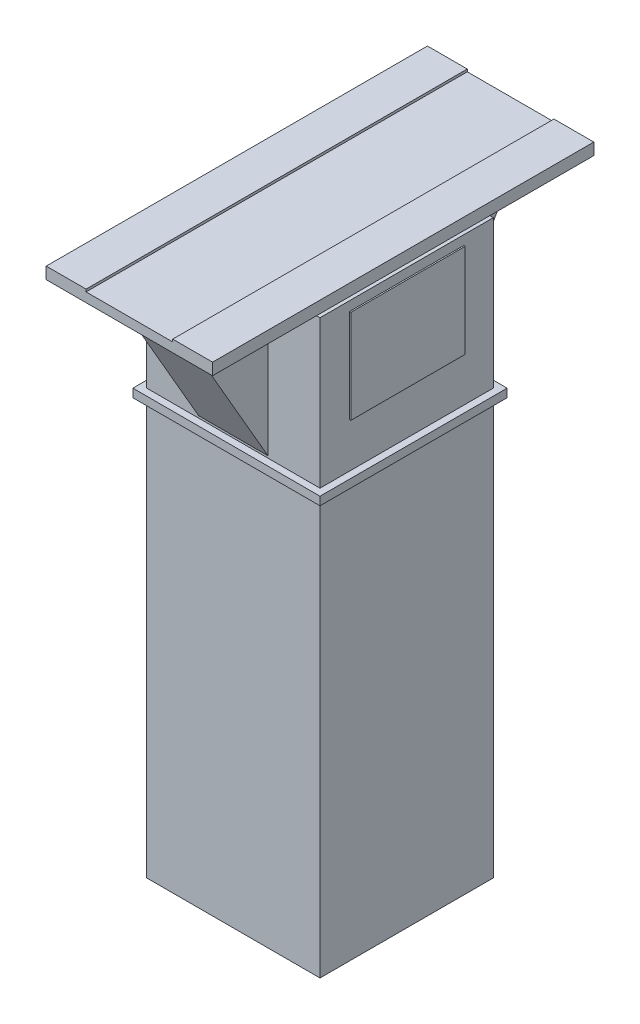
ISO-10303-21;
HEADER;
FILE_DESCRIPTION(('STEP AP214'),'2;1');
FILE_NAME('part.step','',(''),(''),'','','');
FILE_SCHEMA(('AUTOMOTIVE_DESIGN { 1 0 10303 214 1 1 1 1 }'));
ENDSEC;
DATA;
#1=APPLICATION_CONTEXT('core data for automotive mechanical design processes');
#2=APPLICATION_PROTOCOL_DEFINITION('international standard','automotive_design',2000,#1);
#3=PRODUCT_CONTEXT('',#1,'mechanical');
#4=PRODUCT('Part','Part','',(#3));
#5=PRODUCT_RELATED_PRODUCT_CATEGORY('part','',(#4));
#6=PRODUCT_DEFINITION_FORMATION('','',#4);
#7=PRODUCT_DEFINITION_CONTEXT('part definition',#1,'design');
#8=PRODUCT_DEFINITION('design','',#6,#7);
#9=PRODUCT_DEFINITION_SHAPE('','',#8);
#10=(LENGTH_UNIT() NAMED_UNIT(*) SI_UNIT(.MILLI.,.METRE.));
#11=(NAMED_UNIT(*) PLANE_ANGLE_UNIT() SI_UNIT($,.RADIAN.));
#12=(NAMED_UNIT(*) SI_UNIT($,.STERADIAN.) SOLID_ANGLE_UNIT());
#13=UNCERTAINTY_MEASURE_WITH_UNIT(LENGTH_MEASURE(1.E-05),#10,'distance_accuracy_value','');
#14=(GEOMETRIC_REPRESENTATION_CONTEXT(3) GLOBAL_UNCERTAINTY_ASSIGNED_CONTEXT((#13)) GLOBAL_UNIT_ASSIGNED_CONTEXT((#10,
#11,#12)) REPRESENTATION_CONTEXT('',''));
#15=CARTESIAN_POINT('',(0.,0.,0.));
#16=DIRECTION('',(0.,0.,1.));
#17=DIRECTION('',(1.,0.,0.));
#18=AXIS2_PLACEMENT_3D('',#15,#16,#17);
#19=CARTESIAN_POINT('',(50.,615.,-125.));
#20=DIRECTION('',(0.,0.,-1.));
#21=DIRECTION('',(0.,1.,0.));
#22=AXIS2_PLACEMENT_3D('',#19,#20,#21);
#23=PLANE('',#22);
#24=DIRECTION('',(0.,-1.,0.));
#25=VECTOR('',#24,1.);
#26=CARTESIAN_POINT('',(-50.,615.,-125.));
#27=LINE('',#26,#25);
#28=CARTESIAN_POINT('',(-50.,825.,-125.));
#29=VERTEX_POINT('',#28);
#30=CARTESIAN_POINT('',(-50.,615.,-125.));
#31=VERTEX_POINT('',#30);
#32=EDGE_CURVE('E100',#29,#31,#27,.T.);
#33=ORIENTED_EDGE('',*,*,#32,.T.);
#34=DIRECTION('',(-1.,0.,0.));
#35=VECTOR('',#34,1.);
#36=CARTESIAN_POINT('',(50.,615.,-125.));
#37=LINE('',#36,#35);
#38=CARTESIAN_POINT('',(50.,615.,-125.));
#39=VERTEX_POINT('',#38);
#40=EDGE_CURVE('E12',#39,#31,#37,.T.);
#41=ORIENTED_EDGE('',*,*,#40,.F.);
#42=DIRECTION('',(0.,-1.,0.));
#43=VECTOR('',#42,1.);
#44=CARTESIAN_POINT('',(50.,615.,-125.));
#45=LINE('',#44,#43);
#46=CARTESIAN_POINT('',(50.,825.,-125.));
#47=VERTEX_POINT('',#46);
#48=EDGE_CURVE('E93',#47,#39,#45,.T.);
#49=ORIENTED_EDGE('',*,*,#48,.F.);
#50=DIRECTION('',(-1.,0.,0.));
#51=VECTOR('',#50,1.);
#52=CARTESIAN_POINT('',(50.,825.,-125.));
#53=LINE('',#52,#51);
#54=EDGE_CURVE('E101',#47,#29,#53,.T.);
#55=ORIENTED_EDGE('',*,*,#54,.T.);
#56=EDGE_LOOP('',(#33,#41,#49,#55));
#57=FACE_BOUND('',#56,.T.);
#58=ADVANCED_FACE('F53',(#57),#23,.F.);
#59=CARTESIAN_POINT('',(50.,825.,-246.24355652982));
#60=DIRECTION('',(0.,0.499999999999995,0.866025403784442));
#61=DIRECTION('',(0.,-0.866025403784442,0.499999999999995));
#62=AXIS2_PLACEMENT_3D('',#59,#60,#61);
#63=PLANE('',#62);
#64=DIRECTION('',(0.,0.866025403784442,-0.499999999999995));
#65=VECTOR('',#64,1.);
#66=CARTESIAN_POINT('',(-50.,825.,-246.24355652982));
#67=LINE('',#66,#65);
#68=CARTESIAN_POINT('',(-50.,825.,-246.24355652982));
#69=VERTEX_POINT('',#68);
#70=EDGE_CURVE('E81',#31,#69,#67,.T.);
#71=ORIENTED_EDGE('',*,*,#70,.T.);
#72=DIRECTION('',(-1.,0.,0.));
#73=VECTOR('',#72,1.);
#74=CARTESIAN_POINT('',(50.,825.,-246.24355652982));
#75=LINE('',#74,#73);
#76=CARTESIAN_POINT('',(50.,825.,-246.24355652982));
#77=VERTEX_POINT('',#76);
#78=EDGE_CURVE('E61',#77,#69,#75,.T.);
#79=ORIENTED_EDGE('',*,*,#78,.F.);
#80=DIRECTION('',(0.,0.866025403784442,-0.499999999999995));
#81=VECTOR('',#80,1.);
#82=CARTESIAN_POINT('',(50.,825.,-246.24355652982));
#83=LINE('',#82,#81);
#84=EDGE_CURVE('E89',#39,#77,#83,.T.);
#85=ORIENTED_EDGE('',*,*,#84,.F.);
#86=ORIENTED_EDGE('',*,*,#40,.T.);
#87=EDGE_LOOP('',(#71,#79,#85,#86));
#88=FACE_BOUND('',#87,.T.);
#89=ADVANCED_FACE('F90',(#88),#63,.F.);
#90=CARTESIAN_POINT('',(50.,825.,-125.));
#91=DIRECTION('',(0.,-1.,0.));
#92=DIRECTION('',(0.,0.,-1.));
#93=AXIS2_PLACEMENT_3D('',#90,#91,#92);
#94=PLANE('',#93);
#95=DIRECTION('',(0.,0.,1.));
#96=VECTOR('',#95,1.);
#97=CARTESIAN_POINT('',(-50.,825.,-125.));
#98=LINE('',#97,#96);
#99=EDGE_CURVE('E86',#69,#29,#98,.T.);
#100=ORIENTED_EDGE('',*,*,#99,.T.);
#101=ORIENTED_EDGE('',*,*,#54,.F.);
#102=DIRECTION('',(0.,0.,1.));
#103=VECTOR('',#102,1.);
#104=CARTESIAN_POINT('',(50.,825.,-125.));
#105=LINE('',#104,#103);
#106=EDGE_CURVE('E69',#77,#47,#105,.T.);
#107=ORIENTED_EDGE('',*,*,#106,.F.);
#108=ORIENTED_EDGE('',*,*,#78,.T.);
#109=EDGE_LOOP('',(#100,#101,#107,#108));
#110=FACE_BOUND('',#109,.T.);
#111=ADVANCED_FACE('F108',(#110),#94,.F.);
#112=CARTESIAN_POINT('',(50.,825.,-125.));
#113=DIRECTION('',(-1.,0.,0.));
#114=DIRECTION('',(0.,0.,1.));
#115=AXIS2_PLACEMENT_3D('',#112,#113,#114);
#116=PLANE('',#115);
#117=ORIENTED_EDGE('',*,*,#48,.T.);
#118=ORIENTED_EDGE('',*,*,#84,.T.);
#119=ORIENTED_EDGE('',*,*,#106,.T.);
#120=EDGE_LOOP('',(#117,#118,#119));
#121=FACE_BOUND('',#120,.T.);
#122=ADVANCED_FACE('F96',(#121),#116,.F.);
#123=CARTESIAN_POINT('',(-50.,825.,-125.));
#124=DIRECTION('',(-1.,0.,0.));
#125=DIRECTION('',(0.,0.,1.));
#126=AXIS2_PLACEMENT_3D('',#123,#124,#125);
#127=PLANE('',#126);
#128=ORIENTED_EDGE('',*,*,#32,.F.);
#129=ORIENTED_EDGE('',*,*,#99,.F.);
#130=ORIENTED_EDGE('',*,*,#70,.F.);
#131=EDGE_LOOP('',(#128,#129,#130));
#132=FACE_BOUND('',#131,.T.);
#133=ADVANCED_FACE('F109',(#132),#127,.T.);
#134=CLOSED_SHELL('',(#58,#89,#111,#122,#133));
#135=MANIFOLD_SOLID_BREP('B2',#134);
#136=CARTESIAN_POINT('',(50.,825.,125.));
#137=DIRECTION('',(0.,-1.,0.));
#138=DIRECTION('',(0.,0.,-1.));
#139=AXIS2_PLACEMENT_3D('',#136,#137,#138);
#140=PLANE('',#139);
#141=DIRECTION('',(0.,0.,1.));
#142=VECTOR('',#141,1.);
#143=CARTESIAN_POINT('',(-50.,825.,125.));
#144=LINE('',#143,#142);
#145=CARTESIAN_POINT('',(-50.,825.,125.));
#146=VERTEX_POINT('',#145);
#147=CARTESIAN_POINT('',(-50.,825.,246.24355652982));
#148=VERTEX_POINT('',#147);
#149=EDGE_CURVE('E207',#146,#148,#144,.T.);
#150=ORIENTED_EDGE('',*,*,#149,.T.);
#151=DIRECTION('',(-1.,0.,0.));
#152=VECTOR('',#151,1.);
#153=CARTESIAN_POINT('',(50.,825.,246.24355652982));
#154=LINE('',#153,#152);
#155=CARTESIAN_POINT('',(50.,825.,246.24355652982));
#156=VERTEX_POINT('',#155);
#157=EDGE_CURVE('E51',#156,#148,#154,.T.);
#158=ORIENTED_EDGE('',*,*,#157,.F.);
#159=DIRECTION('',(0.,0.,1.));
#160=VECTOR('',#159,1.);
#161=CARTESIAN_POINT('',(50.,825.,125.));
#162=LINE('',#161,#160);
#163=CARTESIAN_POINT('',(50.,825.,125.));
#164=VERTEX_POINT('',#163);
#165=EDGE_CURVE('E200',#164,#156,#162,.T.);
#166=ORIENTED_EDGE('',*,*,#165,.F.);
#167=DIRECTION('',(-1.,0.,0.));
#168=VECTOR('',#167,1.);
#169=CARTESIAN_POINT('',(50.,825.,125.));
#170=LINE('',#169,#168);
#171=EDGE_CURVE('E208',#164,#146,#170,.T.);
#172=ORIENTED_EDGE('',*,*,#171,.T.);
#173=EDGE_LOOP('',(#150,#158,#166,#172));
#174=FACE_BOUND('',#173,.T.);
#175=ADVANCED_FACE('F160',(#174),#140,.F.);
#176=CARTESIAN_POINT('',(50.,825.,246.24355652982));
#177=DIRECTION('',(0.,0.499999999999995,-0.866025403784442));
#178=DIRECTION('',(0.,0.866025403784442,0.499999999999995));
#179=AXIS2_PLACEMENT_3D('',#176,#177,#178);
#180=PLANE('',#179);
#181=DIRECTION('',(0.,-0.866025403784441,-0.499999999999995));
#182=VECTOR('',#181,1.);
#183=CARTESIAN_POINT('',(-50.,825.,246.24355652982));
#184=LINE('',#183,#182);
#185=CARTESIAN_POINT('',(-50.,615.,125.));
#186=VERTEX_POINT('',#185);
#187=EDGE_CURVE('E188',#148,#186,#184,.T.);
#188=ORIENTED_EDGE('',*,*,#187,.T.);
#189=DIRECTION('',(-1.,0.,0.));
#190=VECTOR('',#189,1.);
#191=CARTESIAN_POINT('',(50.,615.,125.));
#192=LINE('',#191,#190);
#193=CARTESIAN_POINT('',(50.,615.,125.));
#194=VERTEX_POINT('',#193);
#195=EDGE_CURVE('E168',#194,#186,#192,.T.);
#196=ORIENTED_EDGE('',*,*,#195,.F.);
#197=DIRECTION('',(0.,-0.866025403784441,-0.499999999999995));
#198=VECTOR('',#197,1.);
#199=CARTESIAN_POINT('',(50.,825.,246.24355652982));
#200=LINE('',#199,#198);
#201=EDGE_CURVE('E196',#156,#194,#200,.T.);
#202=ORIENTED_EDGE('',*,*,#201,.F.);
#203=ORIENTED_EDGE('',*,*,#157,.T.);
#204=EDGE_LOOP('',(#188,#196,#202,#203));
#205=FACE_BOUND('',#204,.T.);
#206=ADVANCED_FACE('F197',(#205),#180,.F.);
#207=CARTESIAN_POINT('',(50.,615.,125.));
#208=DIRECTION('',(0.,0.,1.));
#209=DIRECTION('',(1.,0.,0.));
#210=AXIS2_PLACEMENT_3D('',#207,#208,#209);
#211=PLANE('',#210);
#212=DIRECTION('',(0.,1.,0.));
#213=VECTOR('',#212,1.);
#214=CARTESIAN_POINT('',(-50.,615.,125.));
#215=LINE('',#214,#213);
#216=EDGE_CURVE('E193',#186,#146,#215,.T.);
#217=ORIENTED_EDGE('',*,*,#216,.T.);
#218=ORIENTED_EDGE('',*,*,#171,.F.);
#219=DIRECTION('',(0.,1.,0.));
#220=VECTOR('',#219,1.);
#221=CARTESIAN_POINT('',(50.,615.,125.));
#222=LINE('',#221,#220);
#223=EDGE_CURVE('E176',#194,#164,#222,.T.);
#224=ORIENTED_EDGE('',*,*,#223,.F.);
#225=ORIENTED_EDGE('',*,*,#195,.T.);
#226=EDGE_LOOP('',(#217,#218,#224,#225));
#227=FACE_BOUND('',#226,.T.);
#228=ADVANCED_FACE('F215',(#227),#211,.F.);
#229=CARTESIAN_POINT('',(50.,825.,125.));
#230=DIRECTION('',(-1.,0.,0.));
#231=DIRECTION('',(0.,0.,1.));
#232=AXIS2_PLACEMENT_3D('',#229,#230,#231);
#233=PLANE('',#232);
#234=ORIENTED_EDGE('',*,*,#165,.T.);
#235=ORIENTED_EDGE('',*,*,#201,.T.);
#236=ORIENTED_EDGE('',*,*,#223,.T.);
#237=EDGE_LOOP('',(#234,#235,#236));
#238=FACE_BOUND('',#237,.T.);
#239=ADVANCED_FACE('F203',(#238),#233,.F.);
#240=CARTESIAN_POINT('',(-50.,825.,125.));
#241=DIRECTION('',(-1.,0.,0.));
#242=DIRECTION('',(0.,0.,1.));
#243=AXIS2_PLACEMENT_3D('',#240,#241,#242);
#244=PLANE('',#243);
#245=ORIENTED_EDGE('',*,*,#149,.F.);
#246=ORIENTED_EDGE('',*,*,#216,.F.);
#247=ORIENTED_EDGE('',*,*,#187,.F.);
#248=EDGE_LOOP('',(#245,#246,#247));
#249=FACE_BOUND('',#248,.T.);
#250=ADVANCED_FACE('F216',(#249),#244,.T.);
#251=CLOSED_SHELL('',(#175,#206,#228,#239,#250));
#252=MANIFOLD_SOLID_BREP('B6',#251);
#253=CARTESIAN_POINT('',(-120.,825.,275.));
#254=DIRECTION('',(0.,1.,0.));
#255=DIRECTION('',(0.,0.,1.));
#256=AXIS2_PLACEMENT_3D('',#253,#254,#255);
#257=PLANE('',#256);
#258=DIRECTION('',(0.,0.,-1.));
#259=VECTOR('',#258,1.);
#260=CARTESIAN_POINT('',(120.,825.,275.));
#261=LINE('',#260,#259);
#262=CARTESIAN_POINT('',(120.,825.,-125.));
#263=VERTEX_POINT('',#262);
#264=CARTESIAN_POINT('',(120.,825.,-275.));
#265=VERTEX_POINT('',#264);
#266=EDGE_CURVE('E1206',#263,#265,#261,.T.);
#267=ORIENTED_EDGE('',*,*,#266,.F.);
#268=DIRECTION('',(-1.,0.,0.));
#269=VECTOR('',#268,1.);
#270=CARTESIAN_POINT('',(-125.,825.,-125.));
#271=LINE('',#270,#269);
#272=CARTESIAN_POINT('',(-120.,825.,-125.));
#273=VERTEX_POINT('',#272);
#274=EDGE_CURVE('E1294',#263,#273,#271,.T.);
#275=ORIENTED_EDGE('',*,*,#274,.T.);
#276=DIRECTION('',(0.,0.,-1.));
#277=VECTOR('',#276,1.);
#278=CARTESIAN_POINT('',(-120.,825.,275.));
#279=LINE('',#278,#277);
#280=CARTESIAN_POINT('',(-120.,825.,-275.));
#281=VERTEX_POINT('',#280);
#282=EDGE_CURVE('E1209',#273,#281,#279,.T.);
#283=ORIENTED_EDGE('',*,*,#282,.T.);
#284=DIRECTION('',(1.,0.,0.));
#285=VECTOR('',#284,1.);
#286=CARTESIAN_POINT('',(-120.,825.,-275.));
#287=LINE('',#286,#285);
#288=EDGE_CURVE('E1172',#281,#265,#287,.T.);
#289=ORIENTED_EDGE('',*,*,#288,.T.);
#290=EDGE_LOOP('',(#267,#275,#283,#289));
#291=FACE_BOUND('',#290,.T.);
#292=CARTESIAN_POINT('',(-75.,825.,-150.));
#293=DIRECTION('',(0.,1.,0.));
#294=DIRECTION('',(0.,0.,1.));
#295=AXIS2_PLACEMENT_3D('',#292,#293,#294);
#296=CIRCLE('',#295,9.);
#297=CARTESIAN_POINT('',(-75.,825.,-141.));
#298=VERTEX_POINT('',#297);
#299=EDGE_CURVE('E1340',#298,#298,#296,.F.);
#300=ORIENTED_EDGE('',*,*,#299,.F.);
#301=EDGE_LOOP('',(#300));
#302=FACE_BOUND('',#301,.T.);
#303=CARTESIAN_POINT('',(75.,825.,-150.));
#304=DIRECTION('',(0.,1.,0.));
#305=DIRECTION('',(0.,0.,1.));
#306=AXIS2_PLACEMENT_3D('',#303,#304,#305);
#307=CIRCLE('',#306,9.);
#308=CARTESIAN_POINT('',(75.,825.,-141.));
#309=VERTEX_POINT('',#308);
#310=EDGE_CURVE('E1343',#309,#309,#307,.F.);
#311=ORIENTED_EDGE('',*,*,#310,.F.);
#312=EDGE_LOOP('',(#311));
#313=FACE_BOUND('',#312,.T.);
#314=CARTESIAN_POINT('',(-75.,825.,-250.));
#315=DIRECTION('',(0.,1.,0.));
#316=DIRECTION('',(0.,0.,1.));
#317=AXIS2_PLACEMENT_3D('',#314,#315,#316);
#318=CIRCLE('',#317,9.);
#319=CARTESIAN_POINT('',(-75.,825.,-241.));
#320=VERTEX_POINT('',#319);
#321=EDGE_CURVE('E275',#320,#320,#318,.F.);
#322=ORIENTED_EDGE('',*,*,#321,.F.);
#323=EDGE_LOOP('',(#322));
#324=FACE_BOUND('',#323,.T.);
#325=CARTESIAN_POINT('',(75.,825.,-250.));
#326=DIRECTION('',(0.,1.,0.));
#327=DIRECTION('',(0.,0.,1.));
#328=AXIS2_PLACEMENT_3D('',#325,#326,#327);
#329=CIRCLE('',#328,9.);
#330=CARTESIAN_POINT('',(75.,825.,-241.));
#331=VERTEX_POINT('',#330);
#332=EDGE_CURVE('E158',#331,#331,#329,.F.);
#333=ORIENTED_EDGE('',*,*,#332,.F.);
#334=EDGE_LOOP('',(#333));
#335=FACE_BOUND('',#334,.T.);
#336=ADVANCED_FACE('F267',(#291,#302,#313,#324,#335),#257,.F.);
#337=CARTESIAN_POINT('',(75.,825.,250.));
#338=DIRECTION('',(0.,1.,0.));
#339=DIRECTION('',(0.,0.,1.));
#340=AXIS2_PLACEMENT_3D('',#337,#338,#339);
#341=CIRCLE('',#340,9.);
#342=CARTESIAN_POINT('',(75.,825.,259.));
#343=VERTEX_POINT('',#342);
#344=EDGE_CURVE('E1218',#343,#343,#341,.F.);
#345=ORIENTED_EDGE('',*,*,#344,.F.);
#346=EDGE_LOOP('',(#345));
#347=FACE_BOUND('',#346,.T.);
#348=CARTESIAN_POINT('',(-75.,825.,250.));
#349=DIRECTION('',(0.,1.,0.));
#350=DIRECTION('',(0.,0.,1.));
#351=AXIS2_PLACEMENT_3D('',#348,#349,#350);
#352=CIRCLE('',#351,9.);
#353=CARTESIAN_POINT('',(-75.,825.,259.));
#354=VERTEX_POINT('',#353);
#355=EDGE_CURVE('E1214',#354,#354,#352,.F.);
#356=ORIENTED_EDGE('',*,*,#355,.F.);
#357=EDGE_LOOP('',(#356));
#358=FACE_BOUND('',#357,.T.);
#359=CARTESIAN_POINT('',(-120.,825.,275.));
#360=VERTEX_POINT('',#359);
#361=CARTESIAN_POINT('',(-120.,825.,125.));
#362=VERTEX_POINT('',#361);
#363=EDGE_CURVE('E1210',#360,#362,#279,.T.);
#364=ORIENTED_EDGE('',*,*,#363,.T.);
#365=DIRECTION('',(1.,0.,0.));
#366=VECTOR('',#365,1.);
#367=CARTESIAN_POINT('',(-125.,825.,125.));
#368=LINE('',#367,#366);
#369=CARTESIAN_POINT('',(120.,825.,125.));
#370=VERTEX_POINT('',#369);
#371=EDGE_CURVE('E1287',#362,#370,#368,.T.);
#372=ORIENTED_EDGE('',*,*,#371,.T.);
#373=CARTESIAN_POINT('',(120.,825.,275.));
#374=VERTEX_POINT('',#373);
#375=EDGE_CURVE('E1207',#374,#370,#261,.T.);
#376=ORIENTED_EDGE('',*,*,#375,.F.);
#377=DIRECTION('',(1.,0.,0.));
#378=VECTOR('',#377,1.);
#379=CARTESIAN_POINT('',(-120.,825.,275.));
#380=LINE('',#379,#378);
#381=EDGE_CURVE('E1152',#360,#374,#380,.T.);
#382=ORIENTED_EDGE('',*,*,#381,.F.);
#383=EDGE_LOOP('',(#364,#372,#376,#382));
#384=FACE_BOUND('',#383,.T.);
#385=CARTESIAN_POINT('',(-75.,825.,150.));
#386=DIRECTION('',(0.,1.,0.));
#387=DIRECTION('',(0.,0.,1.));
#388=AXIS2_PLACEMENT_3D('',#385,#386,#387);
#389=CIRCLE('',#388,9.);
#390=CARTESIAN_POINT('',(-75.,825.,159.));
#391=VERTEX_POINT('',#390);
#392=EDGE_CURVE('E1333',#391,#391,#389,.F.);
#393=ORIENTED_EDGE('',*,*,#392,.F.);
#394=EDGE_LOOP('',(#393));
#395=FACE_BOUND('',#394,.T.);
#396=CARTESIAN_POINT('',(75.,825.,150.));
#397=DIRECTION('',(0.,1.,0.));
#398=DIRECTION('',(0.,0.,1.));
#399=AXIS2_PLACEMENT_3D('',#396,#397,#398);
#400=CIRCLE('',#399,9.);
#401=CARTESIAN_POINT('',(75.,825.,159.));
#402=VERTEX_POINT('',#401);
#403=EDGE_CURVE('E1337',#402,#402,#400,.F.);
#404=ORIENTED_EDGE('',*,*,#403,.F.);
#405=EDGE_LOOP('',(#404));
#406=FACE_BOUND('',#405,.T.);
#407=ADVANCED_FACE('F1352',(#347,#358,#384,#395,#406),#257,.F.);
#408=CARTESIAN_POINT('',(-125.,825.,125.));
#409=DIRECTION('',(0.,1.,0.));
#410=DIRECTION('',(0.,0.,1.));
#411=AXIS2_PLACEMENT_3D('',#408,#409,#410);
#412=PLANE('',#411);
#413=CARTESIAN_POINT('',(-125.,825.,125.));
#414=VERTEX_POINT('',#413);
#415=EDGE_CURVE('E1282',#414,#362,#368,.T.);
#416=ORIENTED_EDGE('',*,*,#415,.T.);
#417=DIRECTION('',(0.,0.,-1.));
#418=VECTOR('',#417,1.);
#419=CARTESIAN_POINT('',(-120.,825.,125.));
#420=LINE('',#419,#418);
#421=EDGE_CURVE('E1329',#362,#273,#420,.T.);
#422=ORIENTED_EDGE('',*,*,#421,.T.);
#423=CARTESIAN_POINT('',(-125.,825.,-125.));
#424=VERTEX_POINT('',#423);
#425=EDGE_CURVE('E1289',#273,#424,#271,.T.);
#426=ORIENTED_EDGE('',*,*,#425,.T.);
#427=DIRECTION('',(0.,0.,1.));
#428=VECTOR('',#427,1.);
#429=CARTESIAN_POINT('',(-125.,825.,-125.));
#430=LINE('',#429,#428);
#431=EDGE_CURVE('E1276',#424,#414,#430,.T.);
#432=ORIENTED_EDGE('',*,*,#431,.T.);
#433=EDGE_LOOP('',(#416,#422,#426,#432));
#434=FACE_BOUND('',#433,.T.);
#435=ADVANCED_FACE('F1667',(#434),#412,.T.);
#436=CARTESIAN_POINT('',(125.,825.,-125.));
#437=VERTEX_POINT('',#436);
#438=EDGE_CURVE('E1290',#437,#263,#271,.T.);
#439=ORIENTED_EDGE('',*,*,#438,.T.);
#440=DIRECTION('',(0.,0.,1.));
#441=VECTOR('',#440,1.);
#442=CARTESIAN_POINT('',(120.,825.,125.));
#443=LINE('',#442,#441);
#444=EDGE_CURVE('E1326',#263,#370,#443,.T.);
#445=ORIENTED_EDGE('',*,*,#444,.T.);
#446=CARTESIAN_POINT('',(125.,825.,125.));
#447=VERTEX_POINT('',#446);
#448=EDGE_CURVE('E1280',#370,#447,#368,.T.);
#449=ORIENTED_EDGE('',*,*,#448,.T.);
#450=DIRECTION('',(0.,0.,-1.));
#451=VECTOR('',#450,1.);
#452=CARTESIAN_POINT('',(125.,825.,-125.));
#453=LINE('',#452,#451);
#454=EDGE_CURVE('E1286',#447,#437,#453,.T.);
#455=ORIENTED_EDGE('',*,*,#454,.T.);
#456=EDGE_LOOP('',(#439,#445,#449,#455));
#457=FACE_BOUND('',#456,.T.);
#458=ADVANCED_FACE('F1670',(#457),#412,.T.);
#459=CARTESIAN_POINT('',(-125.,825.,-125.));
#460=DIRECTION('',(1.,0.,0.));
#461=DIRECTION('',(0.,0.,-1.));
#462=AXIS2_PLACEMENT_3D('',#459,#460,#461);
#463=PLANE('',#462);
#464=DIRECTION('',(0.,0.,1.));
#465=VECTOR('',#464,1.);
#466=CARTESIAN_POINT('',(-125.,612.,-125.));
#467=LINE('',#466,#465);
#468=CARTESIAN_POINT('',(-125.,612.,-125.));
#469=VERTEX_POINT('',#468);
#470=CARTESIAN_POINT('',(-125.,612.,125.));
#471=VERTEX_POINT('',#470);
#472=EDGE_CURVE('E1275',#469,#471,#467,.T.);
#473=ORIENTED_EDGE('',*,*,#472,.T.);
#474=DIRECTION('',(0.,-1.,0.));
#475=VECTOR('',#474,1.);
#476=CARTESIAN_POINT('',(-125.,825.,125.));
#477=LINE('',#476,#475);
#478=EDGE_CURVE('E1310',#414,#471,#477,.T.);
#479=ORIENTED_EDGE('',*,*,#478,.F.);
#480=ORIENTED_EDGE('',*,*,#431,.F.);
#481=DIRECTION('',(0.,-1.,0.));
#482=VECTOR('',#481,1.);
#483=CARTESIAN_POINT('',(-125.,825.,-125.));
#484=LINE('',#483,#482);
#485=EDGE_CURVE('E1293',#424,#469,#484,.T.);
#486=ORIENTED_EDGE('',*,*,#485,.T.);
#487=EDGE_LOOP('',(#473,#479,#480,#486));
#488=FACE_BOUND('',#487,.T.);
#489=DIRECTION('',(0.,-1.,0.));
#490=VECTOR('',#489,1.);
#491=CARTESIAN_POINT('',(-125.,825.,-82.5));
#492=LINE('',#491,#490);
#493=CARTESIAN_POINT('',(-125.,811.5,-82.5));
#494=VERTEX_POINT('',#493);
#495=CARTESIAN_POINT('',(-125.,676.5,-82.5));
#496=VERTEX_POINT('',#495);
#497=EDGE_CURVE('E1272',#494,#496,#492,.T.);
#498=ORIENTED_EDGE('',*,*,#497,.F.);
#499=DIRECTION('',(0.,0.,-1.));
#500=VECTOR('',#499,1.);
#501=CARTESIAN_POINT('',(-125.,811.5,-125.));
#502=LINE('',#501,#500);
#503=CARTESIAN_POINT('',(-125.,811.5,82.5));
#504=VERTEX_POINT('',#503);
#505=EDGE_CURVE('E1261',#504,#494,#502,.T.);
#506=ORIENTED_EDGE('',*,*,#505,.F.);
#507=DIRECTION('',(0.,1.,0.));
#508=VECTOR('',#507,1.);
#509=CARTESIAN_POINT('',(-125.,825.,82.5));
#510=LINE('',#509,#508);
#511=CARTESIAN_POINT('',(-125.,676.5,82.5));
#512=VERTEX_POINT('',#511);
#513=EDGE_CURVE('E1265',#512,#504,#510,.T.);
#514=ORIENTED_EDGE('',*,*,#513,.F.);
#515=DIRECTION('',(0.,0.,1.));
#516=VECTOR('',#515,1.);
#517=CARTESIAN_POINT('',(-125.,676.5,-125.));
#518=LINE('',#517,#516);
#519=EDGE_CURVE('E1269',#496,#512,#518,.T.);
#520=ORIENTED_EDGE('',*,*,#519,.F.);
#521=EDGE_LOOP('',(#498,#506,#514,#520));
#522=FACE_BOUND('',#521,.T.);
#523=ADVANCED_FACE('F269',(#488,#522),#463,.F.);
#524=CARTESIAN_POINT('',(125.,825.,-125.));
#525=DIRECTION('',(-1.,0.,0.));
#526=DIRECTION('',(0.,0.,1.));
#527=AXIS2_PLACEMENT_3D('',#524,#525,#526);
#528=PLANE('',#527);
#529=DIRECTION('',(0.,0.,-1.));
#530=VECTOR('',#529,1.);
#531=CARTESIAN_POINT('',(125.,612.,-125.));
#532=LINE('',#531,#530);
#533=CARTESIAN_POINT('',(125.,612.,125.));
#534=VERTEX_POINT('',#533);
#535=CARTESIAN_POINT('',(125.,612.,-125.));
#536=VERTEX_POINT('',#535);
#537=EDGE_CURVE('E1299',#534,#536,#532,.T.);
#538=ORIENTED_EDGE('',*,*,#537,.T.);
#539=DIRECTION('',(0.,-1.,0.));
#540=VECTOR('',#539,1.);
#541=CARTESIAN_POINT('',(125.,825.,-125.));
#542=LINE('',#541,#540);
#543=EDGE_CURVE('E1304',#437,#536,#542,.T.);
#544=ORIENTED_EDGE('',*,*,#543,.F.);
#545=ORIENTED_EDGE('',*,*,#454,.F.);
#546=DIRECTION('',(0.,-1.,0.));
#547=VECTOR('',#546,1.);
#548=CARTESIAN_POINT('',(125.,825.,125.));
#549=LINE('',#548,#547);
#550=EDGE_CURVE('E1307',#447,#534,#549,.T.);
#551=ORIENTED_EDGE('',*,*,#550,.T.);
#552=EDGE_LOOP('',(#538,#544,#545,#551));
#553=FACE_BOUND('',#552,.T.);
#554=DIRECTION('',(0.,1.,0.));
#555=VECTOR('',#554,1.);
#556=CARTESIAN_POINT('',(125.,825.,-82.5));
#557=LINE('',#556,#555);
#558=CARTESIAN_POINT('',(125.,676.5,-82.5));
#559=VERTEX_POINT('',#558);
#560=CARTESIAN_POINT('',(125.,811.5,-82.5));
#561=VERTEX_POINT('',#560);
#562=EDGE_CURVE('E1323',#559,#561,#557,.T.);
#563=ORIENTED_EDGE('',*,*,#562,.F.);
#564=DIRECTION('',(0.,0.,-1.));
#565=VECTOR('',#564,1.);
#566=CARTESIAN_POINT('',(125.,676.5,-125.));
#567=LINE('',#566,#565);
#568=CARTESIAN_POINT('',(125.,676.5,82.5));
#569=VERTEX_POINT('',#568);
#570=EDGE_CURVE('E1320',#569,#559,#567,.T.);
#571=ORIENTED_EDGE('',*,*,#570,.F.);
#572=DIRECTION('',(0.,-1.,0.));
#573=VECTOR('',#572,1.);
#574=CARTESIAN_POINT('',(125.,825.,82.5));
#575=LINE('',#574,#573);
#576=CARTESIAN_POINT('',(125.,811.5,82.5));
#577=VERTEX_POINT('',#576);
#578=EDGE_CURVE('E1317',#577,#569,#575,.T.);
#579=ORIENTED_EDGE('',*,*,#578,.F.);
#580=DIRECTION('',(0.,0.,1.));
#581=VECTOR('',#580,1.);
#582=CARTESIAN_POINT('',(125.,811.5,-125.));
#583=LINE('',#582,#581);
#584=EDGE_CURVE('E1314',#561,#577,#583,.T.);
#585=ORIENTED_EDGE('',*,*,#584,.F.);
#586=EDGE_LOOP('',(#563,#571,#579,#585));
#587=FACE_BOUND('',#586,.T.);
#588=ADVANCED_FACE('F1680',(#553,#587),#528,.F.);
#589=CARTESIAN_POINT('',(-125.,825.,125.));
#590=DIRECTION('',(0.,0.,-1.));
#591=DIRECTION('',(-1.,0.,0.));
#592=AXIS2_PLACEMENT_3D('',#589,#590,#591);
#593=PLANE('',#592);
#594=DIRECTION('',(1.,0.,0.));
#595=VECTOR('',#594,1.);
#596=CARTESIAN_POINT('',(-125.,612.,125.));
#597=LINE('',#596,#595);
#598=EDGE_CURVE('E1297',#471,#534,#597,.T.);
#599=ORIENTED_EDGE('',*,*,#598,.T.);
#600=ORIENTED_EDGE('',*,*,#550,.F.);
#601=ORIENTED_EDGE('',*,*,#448,.F.);
#602=ORIENTED_EDGE('',*,*,#371,.F.);
#603=ORIENTED_EDGE('',*,*,#415,.F.);
#604=ORIENTED_EDGE('',*,*,#478,.T.);
#605=EDGE_LOOP('',(#599,#600,#601,#602,#603,#604));
#606=FACE_BOUND('',#605,.T.);
#607=ADVANCED_FACE('F1678',(#606),#593,.F.);
#608=CARTESIAN_POINT('',(-125.,825.,-125.));
#609=DIRECTION('',(0.,0.,1.));
#610=DIRECTION('',(1.,0.,0.));
#611=AXIS2_PLACEMENT_3D('',#608,#609,#610);
#612=PLANE('',#611);
#613=DIRECTION('',(-1.,0.,0.));
#614=VECTOR('',#613,1.);
#615=CARTESIAN_POINT('',(-125.,612.,-125.));
#616=LINE('',#615,#614);
#617=EDGE_CURVE('E1281',#536,#469,#616,.T.);
#618=ORIENTED_EDGE('',*,*,#617,.T.);
#619=ORIENTED_EDGE('',*,*,#485,.F.);
#620=ORIENTED_EDGE('',*,*,#425,.F.);
#621=ORIENTED_EDGE('',*,*,#274,.F.);
#622=ORIENTED_EDGE('',*,*,#438,.F.);
#623=ORIENTED_EDGE('',*,*,#543,.T.);
#624=EDGE_LOOP('',(#618,#619,#620,#621,#622,#623));
#625=FACE_BOUND('',#624,.T.);
#626=ADVANCED_FACE('F1674',(#625),#612,.F.);
#627=CARTESIAN_POINT('',(-125.,612.,125.));
#628=DIRECTION('',(0.,1.,0.));
#629=DIRECTION('',(0.,0.,1.));
#630=AXIS2_PLACEMENT_3D('',#627,#628,#629);
#631=PLANE('',#630);
#632=ORIENTED_EDGE('',*,*,#472,.F.);
#633=ORIENTED_EDGE('',*,*,#617,.F.);
#634=ORIENTED_EDGE('',*,*,#537,.F.);
#635=ORIENTED_EDGE('',*,*,#598,.F.);
#636=EDGE_LOOP('',(#632,#633,#634,#635));
#637=FACE_BOUND('',#636,.T.);
#638=ADVANCED_FACE('F1647',(#637),#631,.F.);
#639=CARTESIAN_POINT('',(127.,0.,0.));
#640=DIRECTION('',(-1.,0.,0.));
#641=DIRECTION('',(0.,0.,1.));
#642=AXIS2_PLACEMENT_3D('',#639,#640,#641);
#643=PLANE('',#642);
#644=DIRECTION('',(0.,-1.,0.));
#645=VECTOR('',#644,1.);
#646=CARTESIAN_POINT('',(127.,811.5,-82.5));
#647=LINE('',#646,#645);
#648=CARTESIAN_POINT('',(127.,811.5,-82.5));
#649=VERTEX_POINT('',#648);
#650=CARTESIAN_POINT('',(127.,676.5,-82.5));
#651=VERTEX_POINT('',#650);
#652=EDGE_CURVE('E1221',#649,#651,#647,.T.);
#653=ORIENTED_EDGE('',*,*,#652,.F.);
#654=DIRECTION('',(0.,0.,-1.));
#655=VECTOR('',#654,1.);
#656=CARTESIAN_POINT('',(127.,811.5,-82.5));
#657=LINE('',#656,#655);
#658=CARTESIAN_POINT('',(127.,811.5,82.5));
#659=VERTEX_POINT('',#658);
#660=EDGE_CURVE('E1226',#659,#649,#657,.T.);
#661=ORIENTED_EDGE('',*,*,#660,.F.);
#662=DIRECTION('',(0.,1.,0.));
#663=VECTOR('',#662,1.);
#664=CARTESIAN_POINT('',(127.,811.5,82.5));
#665=LINE('',#664,#663);
#666=CARTESIAN_POINT('',(127.,676.5,82.5));
#667=VERTEX_POINT('',#666);
#668=EDGE_CURVE('E1240',#667,#659,#665,.T.);
#669=ORIENTED_EDGE('',*,*,#668,.F.);
#670=DIRECTION('',(0.,0.,1.));
#671=VECTOR('',#670,1.);
#672=CARTESIAN_POINT('',(127.,676.5,-82.5));
#673=LINE('',#672,#671);
#674=EDGE_CURVE('E1237',#651,#667,#673,.T.);
#675=ORIENTED_EDGE('',*,*,#674,.F.);
#676=EDGE_LOOP('',(#653,#661,#669,#675));
#677=FACE_BOUND('',#676,.T.);
#678=ADVANCED_FACE('F1643',(#677),#643,.F.);
#679=CARTESIAN_POINT('',(-127.,811.5,-82.5));
#680=DIRECTION('',(0.,-1.,0.));
#681=DIRECTION('',(0.,0.,-1.));
#682=AXIS2_PLACEMENT_3D('',#679,#680,#681);
#683=PLANE('',#682);
#684=DIRECTION('',(1.,0.,0.));
#685=VECTOR('',#684,1.);
#686=CARTESIAN_POINT('',(-127.,811.5,-82.5));
#687=LINE('',#686,#685);
#688=EDGE_CURVE('E1234',#561,#649,#687,.T.);
#689=ORIENTED_EDGE('',*,*,#688,.F.);
#690=ORIENTED_EDGE('',*,*,#584,.T.);
#691=DIRECTION('',(1.,0.,0.));
#692=VECTOR('',#691,1.);
#693=CARTESIAN_POINT('',(-127.,811.5,82.5));
#694=LINE('',#693,#692);
#695=EDGE_CURVE('E1248',#577,#659,#694,.T.);
#696=ORIENTED_EDGE('',*,*,#695,.T.);
#697=ORIENTED_EDGE('',*,*,#660,.T.);
#698=EDGE_LOOP('',(#689,#690,#696,#697));
#699=FACE_BOUND('',#698,.T.);
#700=ADVANCED_FACE('F1646',(#699),#683,.F.);
#701=CARTESIAN_POINT('',(-127.,811.5,82.5));
#702=DIRECTION('',(0.,0.,-1.));
#703=DIRECTION('',(0.,1.,0.));
#704=AXIS2_PLACEMENT_3D('',#701,#702,#703);
#705=PLANE('',#704);
#706=ORIENTED_EDGE('',*,*,#695,.F.);
#707=ORIENTED_EDGE('',*,*,#578,.T.);
#708=DIRECTION('',(1.,0.,0.));
#709=VECTOR('',#708,1.);
#710=CARTESIAN_POINT('',(-127.,676.5,82.5));
#711=LINE('',#710,#709);
#712=EDGE_CURVE('E1253',#569,#667,#711,.T.);
#713=ORIENTED_EDGE('',*,*,#712,.T.);
#714=ORIENTED_EDGE('',*,*,#668,.T.);
#715=EDGE_LOOP('',(#706,#707,#713,#714));
#716=FACE_BOUND('',#715,.T.);
#717=ADVANCED_FACE('F1657',(#716),#705,.F.);
#718=CARTESIAN_POINT('',(-127.,676.5,-82.5));
#719=DIRECTION('',(0.,1.,0.));
#720=DIRECTION('',(0.,0.,1.));
#721=AXIS2_PLACEMENT_3D('',#718,#719,#720);
#722=PLANE('',#721);
#723=ORIENTED_EDGE('',*,*,#712,.F.);
#724=ORIENTED_EDGE('',*,*,#570,.T.);
#725=DIRECTION('',(1.,0.,0.));
#726=VECTOR('',#725,1.);
#727=CARTESIAN_POINT('',(-127.,676.5,-82.5));
#728=LINE('',#727,#726);
#729=EDGE_CURVE('E1257',#559,#651,#728,.T.);
#730=ORIENTED_EDGE('',*,*,#729,.T.);
#731=ORIENTED_EDGE('',*,*,#674,.T.);
#732=EDGE_LOOP('',(#723,#724,#730,#731));
#733=FACE_BOUND('',#732,.T.);
#734=ADVANCED_FACE('F1662',(#733),#722,.F.);
#735=CARTESIAN_POINT('',(-127.,811.5,-82.5));
#736=DIRECTION('',(0.,0.,1.));
#737=DIRECTION('',(0.,-1.,0.));
#738=AXIS2_PLACEMENT_3D('',#735,#736,#737);
#739=PLANE('',#738);
#740=ORIENTED_EDGE('',*,*,#729,.F.);
#741=ORIENTED_EDGE('',*,*,#562,.T.);
#742=ORIENTED_EDGE('',*,*,#688,.T.);
#743=ORIENTED_EDGE('',*,*,#652,.T.);
#744=EDGE_LOOP('',(#740,#741,#742,#743));
#745=FACE_BOUND('',#744,.T.);
#746=ADVANCED_FACE('F1665',(#745),#739,.F.);
#747=CARTESIAN_POINT('',(-127.,811.5,-82.5));
#748=VERTEX_POINT('',#747);
#749=EDGE_CURVE('E1245',#748,#494,#687,.T.);
#750=ORIENTED_EDGE('',*,*,#749,.T.);
#751=ORIENTED_EDGE('',*,*,#497,.T.);
#752=CARTESIAN_POINT('',(-127.,676.5,-82.5));
#753=VERTEX_POINT('',#752);
#754=EDGE_CURVE('E1258',#753,#496,#728,.T.);
#755=ORIENTED_EDGE('',*,*,#754,.F.);
#756=DIRECTION('',(0.,-1.,0.));
#757=VECTOR('',#756,1.);
#758=CARTESIAN_POINT('',(-127.,811.5,-82.5));
#759=LINE('',#758,#757);
#760=EDGE_CURVE('E1222',#748,#753,#759,.T.);
#761=ORIENTED_EDGE('',*,*,#760,.F.);
#762=EDGE_LOOP('',(#750,#751,#755,#761));
#763=FACE_BOUND('',#762,.T.);
#764=ADVANCED_FACE('F1660',(#763),#739,.F.);
#765=ORIENTED_EDGE('',*,*,#754,.T.);
#766=ORIENTED_EDGE('',*,*,#519,.T.);
#767=CARTESIAN_POINT('',(-127.,676.5,82.5));
#768=VERTEX_POINT('',#767);
#769=EDGE_CURVE('E1254',#768,#512,#711,.T.);
#770=ORIENTED_EDGE('',*,*,#769,.F.);
#771=DIRECTION('',(0.,0.,1.));
#772=VECTOR('',#771,1.);
#773=CARTESIAN_POINT('',(-127.,676.5,-82.5));
#774=LINE('',#773,#772);
#775=EDGE_CURVE('E1225',#753,#768,#774,.T.);
#776=ORIENTED_EDGE('',*,*,#775,.F.);
#777=EDGE_LOOP('',(#765,#766,#770,#776));
#778=FACE_BOUND('',#777,.T.);
#779=ADVANCED_FACE('F1655',(#778),#722,.F.);
#780=ORIENTED_EDGE('',*,*,#769,.T.);
#781=ORIENTED_EDGE('',*,*,#513,.T.);
#782=CARTESIAN_POINT('',(-127.,811.5,82.5));
#783=VERTEX_POINT('',#782);
#784=EDGE_CURVE('E1249',#783,#504,#694,.T.);
#785=ORIENTED_EDGE('',*,*,#784,.F.);
#786=DIRECTION('',(0.,1.,0.));
#787=VECTOR('',#786,1.);
#788=CARTESIAN_POINT('',(-127.,811.5,82.5));
#789=LINE('',#788,#787);
#790=EDGE_CURVE('E1228',#768,#783,#789,.T.);
#791=ORIENTED_EDGE('',*,*,#790,.F.);
#792=EDGE_LOOP('',(#780,#781,#785,#791));
#793=FACE_BOUND('',#792,.T.);
#794=ADVANCED_FACE('F1651',(#793),#705,.F.);
#795=ORIENTED_EDGE('',*,*,#784,.T.);
#796=ORIENTED_EDGE('',*,*,#505,.T.);
#797=ORIENTED_EDGE('',*,*,#749,.F.);
#798=DIRECTION('',(0.,0.,-1.));
#799=VECTOR('',#798,1.);
#800=CARTESIAN_POINT('',(-127.,811.5,-82.5));
#801=LINE('',#800,#799);
#802=EDGE_CURVE('E1231',#783,#748,#801,.T.);
#803=ORIENTED_EDGE('',*,*,#802,.F.);
#804=EDGE_LOOP('',(#795,#796,#797,#803));
#805=FACE_BOUND('',#804,.T.);
#806=ADVANCED_FACE('F1641',(#805),#683,.F.);
#807=CARTESIAN_POINT('',(-127.,0.,0.));
#808=DIRECTION('',(-1.,0.,0.));
#809=DIRECTION('',(0.,0.,1.));
#810=AXIS2_PLACEMENT_3D('',#807,#808,#809);
#811=PLANE('',#810);
#812=ORIENTED_EDGE('',*,*,#760,.T.);
#813=ORIENTED_EDGE('',*,*,#775,.T.);
#814=ORIENTED_EDGE('',*,*,#790,.T.);
#815=ORIENTED_EDGE('',*,*,#802,.T.);
#816=EDGE_LOOP('',(#812,#813,#814,#815));
#817=FACE_BOUND('',#816,.T.);
#818=ADVANCED_FACE('F1637',(#817),#811,.T.);
#819=CARTESIAN_POINT('',(-120.,842.,275.));
#820=DIRECTION('',(1.,0.,0.));
#821=DIRECTION('',(0.,0.,-1.));
#822=AXIS2_PLACEMENT_3D('',#819,#820,#821);
#823=PLANE('',#822);
#824=DIRECTION('',(0.,-1.,0.));
#825=VECTOR('',#824,1.);
#826=CARTESIAN_POINT('',(-120.,842.,-275.));
#827=LINE('',#826,#825);
#828=CARTESIAN_POINT('',(-120.,842.,-275.));
#829=VERTEX_POINT('',#828);
#830=EDGE_CURVE('E1147',#829,#281,#827,.T.);
#831=ORIENTED_EDGE('',*,*,#830,.T.);
#832=ORIENTED_EDGE('',*,*,#282,.F.);
#833=ORIENTED_EDGE('',*,*,#421,.F.);
#834=ORIENTED_EDGE('',*,*,#363,.F.);
#835=DIRECTION('',(0.,-1.,0.));
#836=VECTOR('',#835,1.);
#837=CARTESIAN_POINT('',(-120.,842.,275.));
#838=LINE('',#837,#836);
#839=CARTESIAN_POINT('',(-120.,842.,275.));
#840=VERTEX_POINT('',#839);
#841=EDGE_CURVE('E1148',#840,#360,#838,.T.);
#842=ORIENTED_EDGE('',*,*,#841,.F.);
#843=DIRECTION('',(0.,0.,-1.));
#844=VECTOR('',#843,1.);
#845=CARTESIAN_POINT('',(-120.,842.,275.));
#846=LINE('',#845,#844);
#847=EDGE_CURVE('E1169',#840,#829,#846,.T.);
#848=ORIENTED_EDGE('',*,*,#847,.T.);
#849=EDGE_LOOP('',(#831,#832,#833,#834,#842,#848));
#850=FACE_BOUND('',#849,.T.);
#851=ADVANCED_FACE('F1630',(#850),#823,.F.);
#852=CARTESIAN_POINT('',(120.,825.,275.));
#853=DIRECTION('',(-1.,0.,0.));
#854=DIRECTION('',(0.,0.,1.));
#855=AXIS2_PLACEMENT_3D('',#852,#853,#854);
#856=PLANE('',#855);
#857=DIRECTION('',(0.,1.,0.));
#858=VECTOR('',#857,1.);
#859=CARTESIAN_POINT('',(120.,825.,-275.));
#860=LINE('',#859,#858);
#861=CARTESIAN_POINT('',(120.,842.,-275.));
#862=VERTEX_POINT('',#861);
#863=EDGE_CURVE('E1175',#265,#862,#860,.T.);
#864=ORIENTED_EDGE('',*,*,#863,.T.);
#865=DIRECTION('',(0.,0.,-1.));
#866=VECTOR('',#865,1.);
#867=CARTESIAN_POINT('',(120.,842.,275.));
#868=LINE('',#867,#866);
#869=CARTESIAN_POINT('',(120.,842.,275.));
#870=VERTEX_POINT('',#869);
#871=EDGE_CURVE('E1203',#870,#862,#868,.T.);
#872=ORIENTED_EDGE('',*,*,#871,.F.);
#873=DIRECTION('',(0.,1.,0.));
#874=VECTOR('',#873,1.);
#875=CARTESIAN_POINT('',(120.,825.,275.));
#876=LINE('',#875,#874);
#877=EDGE_CURVE('E1156',#374,#870,#876,.T.);
#878=ORIENTED_EDGE('',*,*,#877,.F.);
#879=ORIENTED_EDGE('',*,*,#375,.T.);
#880=ORIENTED_EDGE('',*,*,#444,.F.);
#881=ORIENTED_EDGE('',*,*,#266,.T.);
#882=EDGE_LOOP('',(#864,#872,#878,#879,#880,#881));
#883=FACE_BOUND('',#882,.T.);
#884=ADVANCED_FACE('F1627',(#883),#856,.F.);
#885=CARTESIAN_POINT('',(120.,842.,275.));
#886=DIRECTION('',(0.,-1.,0.));
#887=DIRECTION('',(0.,0.,-1.));
#888=AXIS2_PLACEMENT_3D('',#885,#886,#887);
#889=PLANE('',#888);
#890=DIRECTION('',(-1.,0.,0.));
#891=VECTOR('',#890,1.);
#892=CARTESIAN_POINT('',(120.,842.,-275.));
#893=LINE('',#892,#891);
#894=CARTESIAN_POINT('',(62.5,842.,-275.));
#895=VERTEX_POINT('',#894);
#896=EDGE_CURVE('E1177',#862,#895,#893,.T.);
#897=ORIENTED_EDGE('',*,*,#896,.T.);
#898=DIRECTION('',(0.,0.,-1.));
#899=VECTOR('',#898,1.);
#900=CARTESIAN_POINT('',(62.5,842.,275.));
#901=LINE('',#900,#899);
#902=CARTESIAN_POINT('',(62.5,842.,275.));
#903=VERTEX_POINT('',#902);
#904=EDGE_CURVE('E1200',#903,#895,#901,.T.);
#905=ORIENTED_EDGE('',*,*,#904,.F.);
#906=DIRECTION('',(-1.,0.,0.));
#907=VECTOR('',#906,1.);
#908=CARTESIAN_POINT('',(120.,842.,275.));
#909=LINE('',#908,#907);
#910=EDGE_CURVE('E1158',#870,#903,#909,.T.);
#911=ORIENTED_EDGE('',*,*,#910,.F.);
#912=ORIENTED_EDGE('',*,*,#871,.T.);
#913=EDGE_LOOP('',(#897,#905,#911,#912));
#914=FACE_BOUND('',#913,.T.);
#915=ADVANCED_FACE('F1623',(#914),#889,.F.);
#916=CARTESIAN_POINT('',(62.5,842.,275.));
#917=DIRECTION('',(1.,0.,0.));
#918=DIRECTION('',(0.,0.,-1.));
#919=AXIS2_PLACEMENT_3D('',#916,#917,#918);
#920=PLANE('',#919);
#921=DIRECTION('',(0.,-1.,0.));
#922=VECTOR('',#921,1.);
#923=CARTESIAN_POINT('',(62.5,842.,-275.));
#924=LINE('',#923,#922);
#925=CARTESIAN_POINT('',(62.5,838.5,-275.));
#926=VERTEX_POINT('',#925);
#927=EDGE_CURVE('E1179',#895,#926,#924,.T.);
#928=ORIENTED_EDGE('',*,*,#927,.T.);
#929=DIRECTION('',(0.,0.,-1.));
#930=VECTOR('',#929,1.);
#931=CARTESIAN_POINT('',(62.5,838.5,275.));
#932=LINE('',#931,#930);
#933=CARTESIAN_POINT('',(62.5,838.5,275.));
#934=VERTEX_POINT('',#933);
#935=EDGE_CURVE('E1197',#934,#926,#932,.T.);
#936=ORIENTED_EDGE('',*,*,#935,.F.);
#937=DIRECTION('',(0.,-1.,0.));
#938=VECTOR('',#937,1.);
#939=CARTESIAN_POINT('',(62.5,842.,275.));
#940=LINE('',#939,#938);
#941=EDGE_CURVE('E1160',#903,#934,#940,.T.);
#942=ORIENTED_EDGE('',*,*,#941,.F.);
#943=ORIENTED_EDGE('',*,*,#904,.T.);
#944=EDGE_LOOP('',(#928,#936,#942,#943));
#945=FACE_BOUND('',#944,.T.);
#946=ADVANCED_FACE('F1619',(#945),#920,.F.);
#947=CARTESIAN_POINT('',(62.5,838.5,275.));
#948=DIRECTION('',(0.,-1.,0.));
#949=DIRECTION('',(0.,0.,-1.));
#950=AXIS2_PLACEMENT_3D('',#947,#948,#949);
#951=PLANE('',#950);
#952=DIRECTION('',(-1.,0.,0.));
#953=VECTOR('',#952,1.);
#954=CARTESIAN_POINT('',(62.5,838.5,-275.));
#955=LINE('',#954,#953);
#956=CARTESIAN_POINT('',(-62.5,838.5,-275.));
#957=VERTEX_POINT('',#956);
#958=EDGE_CURVE('E1181',#926,#957,#955,.T.);
#959=ORIENTED_EDGE('',*,*,#958,.T.);
#960=DIRECTION('',(0.,0.,-1.));
#961=VECTOR('',#960,1.);
#962=CARTESIAN_POINT('',(-62.5,838.5,275.));
#963=LINE('',#962,#961);
#964=CARTESIAN_POINT('',(-62.5,838.5,275.));
#965=VERTEX_POINT('',#964);
#966=EDGE_CURVE('E1193',#965,#957,#963,.T.);
#967=ORIENTED_EDGE('',*,*,#966,.F.);
#968=DIRECTION('',(-1.,0.,0.));
#969=VECTOR('',#968,1.);
#970=CARTESIAN_POINT('',(62.5,838.5,275.));
#971=LINE('',#970,#969);
#972=EDGE_CURVE('E1162',#934,#965,#971,.T.);
#973=ORIENTED_EDGE('',*,*,#972,.F.);
#974=ORIENTED_EDGE('',*,*,#935,.T.);
#975=EDGE_LOOP('',(#959,#967,#973,#974));
#976=FACE_BOUND('',#975,.T.);
#977=ADVANCED_FACE('F1615',(#976),#951,.F.);
#978=CARTESIAN_POINT('',(-62.5,838.5,275.));
#979=DIRECTION('',(-1.,0.,0.));
#980=DIRECTION('',(0.,0.,1.));
#981=AXIS2_PLACEMENT_3D('',#978,#979,#980);
#982=PLANE('',#981);
#983=DIRECTION('',(0.,1.,0.));
#984=VECTOR('',#983,1.);
#985=CARTESIAN_POINT('',(-62.5,838.5,-275.));
#986=LINE('',#985,#984);
#987=CARTESIAN_POINT('',(-62.5,842.,-275.));
#988=VERTEX_POINT('',#987);
#989=EDGE_CURVE('E1183',#957,#988,#986,.T.);
#990=ORIENTED_EDGE('',*,*,#989,.T.);
#991=DIRECTION('',(0.,0.,-1.));
#992=VECTOR('',#991,1.);
#993=CARTESIAN_POINT('',(-62.5,842.,275.));
#994=LINE('',#993,#992);
#995=CARTESIAN_POINT('',(-62.5,842.,275.));
#996=VERTEX_POINT('',#995);
#997=EDGE_CURVE('E1189',#996,#988,#994,.T.);
#998=ORIENTED_EDGE('',*,*,#997,.F.);
#999=DIRECTION('',(0.,1.,0.));
#1000=VECTOR('',#999,1.);
#1001=CARTESIAN_POINT('',(-62.5,838.5,275.));
#1002=LINE('',#1001,#1000);
#1003=EDGE_CURVE('E1164',#965,#996,#1002,.T.);
#1004=ORIENTED_EDGE('',*,*,#1003,.F.);
#1005=ORIENTED_EDGE('',*,*,#966,.T.);
#1006=EDGE_LOOP('',(#990,#998,#1004,#1005));
#1007=FACE_BOUND('',#1006,.T.);
#1008=ADVANCED_FACE('F1611',(#1007),#982,.F.);
#1009=CARTESIAN_POINT('',(-62.5,842.,275.));
#1010=DIRECTION('',(0.,-1.,0.));
#1011=DIRECTION('',(0.,0.,-1.));
#1012=AXIS2_PLACEMENT_3D('',#1009,#1010,#1011);
#1013=PLANE('',#1012);
#1014=DIRECTION('',(-1.,0.,0.));
#1015=VECTOR('',#1014,1.);
#1016=CARTESIAN_POINT('',(-62.5,842.,-275.));
#1017=LINE('',#1016,#1015);
#1018=EDGE_CURVE('E1153',#988,#829,#1017,.T.);
#1019=ORIENTED_EDGE('',*,*,#1018,.T.);
#1020=ORIENTED_EDGE('',*,*,#847,.F.);
#1021=DIRECTION('',(-1.,0.,0.));
#1022=VECTOR('',#1021,1.);
#1023=CARTESIAN_POINT('',(-62.5,842.,275.));
#1024=LINE('',#1023,#1022);
#1025=EDGE_CURVE('E1166',#996,#840,#1024,.T.);
#1026=ORIENTED_EDGE('',*,*,#1025,.F.);
#1027=ORIENTED_EDGE('',*,*,#997,.T.);
#1028=EDGE_LOOP('',(#1019,#1020,#1026,#1027));
#1029=FACE_BOUND('',#1028,.T.);
#1030=ADVANCED_FACE('F1604',(#1029),#1013,.F.);
#1031=CARTESIAN_POINT('',(-120.,825.,275.));
#1032=DIRECTION('',(0.,0.,1.));
#1033=DIRECTION('',(1.,0.,0.));
#1034=AXIS2_PLACEMENT_3D('',#1031,#1032,#1033);
#1035=PLANE('',#1034);
#1036=ORIENTED_EDGE('',*,*,#841,.T.);
#1037=ORIENTED_EDGE('',*,*,#381,.T.);
#1038=ORIENTED_EDGE('',*,*,#877,.T.);
#1039=ORIENTED_EDGE('',*,*,#910,.T.);
#1040=ORIENTED_EDGE('',*,*,#941,.T.);
#1041=ORIENTED_EDGE('',*,*,#972,.T.);
#1042=ORIENTED_EDGE('',*,*,#1003,.T.);
#1043=ORIENTED_EDGE('',*,*,#1025,.T.);
#1044=EDGE_LOOP('',(#1036,#1037,#1038,#1039,#1040,#1041,#1042,#1043));
#1045=FACE_BOUND('',#1044,.T.);
#1046=ADVANCED_FACE('F1601',(#1045),#1035,.T.);
#1047=CARTESIAN_POINT('',(-120.,825.,-275.));
#1048=DIRECTION('',(0.,0.,1.));
#1049=DIRECTION('',(1.,0.,0.));
#1050=AXIS2_PLACEMENT_3D('',#1047,#1048,#1049);
#1051=PLANE('',#1050);
#1052=ORIENTED_EDGE('',*,*,#830,.F.);
#1053=ORIENTED_EDGE('',*,*,#1018,.F.);
#1054=ORIENTED_EDGE('',*,*,#989,.F.);
#1055=ORIENTED_EDGE('',*,*,#958,.F.);
#1056=ORIENTED_EDGE('',*,*,#927,.F.);
#1057=ORIENTED_EDGE('',*,*,#896,.F.);
#1058=ORIENTED_EDGE('',*,*,#863,.F.);
#1059=ORIENTED_EDGE('',*,*,#288,.F.);
#1060=EDGE_LOOP('',(#1052,#1053,#1054,#1055,#1056,#1057,#1058,#1059));
#1061=FACE_BOUND('',#1060,.T.);
#1062=ADVANCED_FACE('F1596',(#1061),#1051,.F.);
#1063=CARTESIAN_POINT('',(-75.,813.,250.));
#1064=DIRECTION('',(0.,-1.,0.));
#1065=DIRECTION('',(0.,0.,-1.));
#1066=AXIS2_PLACEMENT_3D('',#1063,#1064,#1065);
#1067=PLANE('',#1066);
#1068=CARTESIAN_POINT('',(-75.,813.,250.));
#1069=DIRECTION('',(0.,-1.,0.));
#1070=DIRECTION('',(0.,0.,-1.));
#1071=AXIS2_PLACEMENT_3D('',#1068,#1069,#1070);
#1072=CIRCLE('',#1071,9.);
#1073=CARTESIAN_POINT('',(-75.,813.,241.));
#1074=VERTEX_POINT('',#1073);
#1075=EDGE_CURVE('E1143',#1074,#1074,#1072,.T.);
#1076=ORIENTED_EDGE('',*,*,#1075,.T.);
#1077=EDGE_LOOP('',(#1076));
#1078=FACE_BOUND('',#1077,.T.);
#1079=DIRECTION('',(-0.866025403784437,0.,-0.500000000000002));
#1080=VECTOR('',#1079,1.);
#1081=CARTESIAN_POINT('',(-75.0000000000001,813.,255.773502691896));
#1082=LINE('',#1081,#1080);
#1083=CARTESIAN_POINT('',(-75.0000000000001,813.,255.773502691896));
#1084=VERTEX_POINT('',#1083);
#1085=CARTESIAN_POINT('',(-80.0000000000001,813.,252.886751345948));
#1086=VERTEX_POINT('',#1085);
#1087=EDGE_CURVE('E1090',#1084,#1086,#1082,.T.);
#1088=ORIENTED_EDGE('',*,*,#1087,.F.);
#1089=DIRECTION('',(-0.866025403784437,0.,0.500000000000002));
#1090=VECTOR('',#1089,1.);
#1091=CARTESIAN_POINT('',(-70.,813.,252.886751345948));
#1092=LINE('',#1091,#1090);
#1093=CARTESIAN_POINT('',(-70.,813.,252.886751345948));
#1094=VERTEX_POINT('',#1093);
#1095=EDGE_CURVE('E1088',#1094,#1084,#1092,.T.);
#1096=ORIENTED_EDGE('',*,*,#1095,.F.);
#1097=DIRECTION('',(0.,0.,1.));
#1098=VECTOR('',#1097,1.);
#1099=CARTESIAN_POINT('',(-70.,813.,247.113248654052));
#1100=LINE('',#1099,#1098);
#1101=CARTESIAN_POINT('',(-70.,813.,247.113248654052));
#1102=VERTEX_POINT('',#1101);
#1103=EDGE_CURVE('E1103',#1102,#1094,#1100,.T.);
#1104=ORIENTED_EDGE('',*,*,#1103,.F.);
#1105=DIRECTION('',(0.866025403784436,0.,0.500000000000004));
#1106=VECTOR('',#1105,1.);
#1107=CARTESIAN_POINT('',(-75.,813.,244.226497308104));
#1108=LINE('',#1107,#1106);
#1109=CARTESIAN_POINT('',(-75.,813.,244.226497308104));
#1110=VERTEX_POINT('',#1109);
#1111=EDGE_CURVE('E1100',#1110,#1102,#1108,.T.);
#1112=ORIENTED_EDGE('',*,*,#1111,.F.);
#1113=DIRECTION('',(0.866025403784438,0.,-0.500000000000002));
#1114=VECTOR('',#1113,1.);
#1115=CARTESIAN_POINT('',(-80.0000000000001,813.,247.113248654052));
#1116=LINE('',#1115,#1114);
#1117=CARTESIAN_POINT('',(-80.0000000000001,813.,247.113248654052));
#1118=VERTEX_POINT('',#1117);
#1119=EDGE_CURVE('E1097',#1118,#1110,#1116,.T.);
#1120=ORIENTED_EDGE('',*,*,#1119,.F.);
#1121=DIRECTION('',(0.,0.,-1.));
#1122=VECTOR('',#1121,1.);
#1123=CARTESIAN_POINT('',(-80.0000000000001,813.,252.886751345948));
#1124=LINE('',#1123,#1122);
#1125=EDGE_CURVE('E1094',#1086,#1118,#1124,.T.);
#1126=ORIENTED_EDGE('',*,*,#1125,.F.);
#1127=EDGE_LOOP('',(#1088,#1096,#1104,#1112,#1120,#1126));
#1128=FACE_BOUND('',#1127,.T.);
#1129=ADVANCED_FACE('F1593',(#1078,#1128),#1067,.T.);
#1130=CARTESIAN_POINT('',(-75.,813.,250.));
#1131=DIRECTION('',(0.,1.,0.));
#1132=DIRECTION('',(0.,0.,1.));
#1133=AXIS2_PLACEMENT_3D('',#1130,#1131,#1132);
#1134=CYLINDRICAL_SURFACE('',#1133,9.);
#1135=ORIENTED_EDGE('',*,*,#1075,.F.);
#1136=EDGE_LOOP('',(#1135));
#1137=FACE_BOUND('',#1136,.T.);
#1138=ORIENTED_EDGE('',*,*,#355,.T.);
#1139=EDGE_LOOP('',(#1138));
#1140=FACE_BOUND('',#1139,.T.);
#1141=ADVANCED_FACE('F1591',(#1137,#1140),#1134,.T.);
#1142=CARTESIAN_POINT('',(-70.,813.,252.886751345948));
#1143=DIRECTION('',(-0.500000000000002,0.,-0.866025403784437));
#1144=DIRECTION('',(-0.866025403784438,0.,0.500000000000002));
#1145=AXIS2_PLACEMENT_3D('',#1142,#1143,#1144);
#1146=PLANE('',#1145);
#1147=DIRECTION('',(-0.866025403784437,0.,0.500000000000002));
#1148=VECTOR('',#1147,1.);
#1149=CARTESIAN_POINT('',(-70.,825.,252.886751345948));
#1150=LINE('',#1149,#1148);
#1151=CARTESIAN_POINT('',(-70.,825.,252.886751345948));
#1152=VERTEX_POINT('',#1151);
#1153=CARTESIAN_POINT('',(-75.0000000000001,825.,255.773502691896));
#1154=VERTEX_POINT('',#1153);
#1155=EDGE_CURVE('E1087',#1152,#1154,#1150,.T.);
#1156=ORIENTED_EDGE('',*,*,#1155,.F.);
#1157=DIRECTION('',(0.,1.,0.));
#1158=VECTOR('',#1157,1.);
#1159=CARTESIAN_POINT('',(-70.,813.,252.886751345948));
#1160=LINE('',#1159,#1158);
#1161=EDGE_CURVE('E1105',#1094,#1152,#1160,.T.);
#1162=ORIENTED_EDGE('',*,*,#1161,.F.);
#1163=ORIENTED_EDGE('',*,*,#1095,.T.);
#1164=DIRECTION('',(0.,1.,0.));
#1165=VECTOR('',#1164,1.);
#1166=CARTESIAN_POINT('',(-75.0000000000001,813.,255.773502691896));
#1167=LINE('',#1166,#1165);
#1168=EDGE_CURVE('E1139',#1084,#1154,#1167,.T.);
#1169=ORIENTED_EDGE('',*,*,#1168,.T.);
#1170=EDGE_LOOP('',(#1156,#1162,#1163,#1169));
#1171=FACE_BOUND('',#1170,.T.);
#1172=ADVANCED_FACE('F1587',(#1171),#1146,.T.);
#1173=CARTESIAN_POINT('',(-75.0000000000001,813.,255.773502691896));
#1174=DIRECTION('',(0.500000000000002,0.,-0.866025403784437));
#1175=DIRECTION('',(-0.866025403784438,0.,-0.500000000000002));
#1176=AXIS2_PLACEMENT_3D('',#1173,#1174,#1175);
#1177=PLANE('',#1176);
#1178=DIRECTION('',(-0.866025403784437,0.,-0.500000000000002));
#1179=VECTOR('',#1178,1.);
#1180=CARTESIAN_POINT('',(-75.0000000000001,825.,255.773502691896));
#1181=LINE('',#1180,#1179);
#1182=CARTESIAN_POINT('',(-80.0000000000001,825.,252.886751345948));
#1183=VERTEX_POINT('',#1182);
#1184=EDGE_CURVE('E1109',#1154,#1183,#1181,.T.);
#1185=ORIENTED_EDGE('',*,*,#1184,.F.);
#1186=ORIENTED_EDGE('',*,*,#1168,.F.);
#1187=ORIENTED_EDGE('',*,*,#1087,.T.);
#1188=DIRECTION('',(0.,1.,0.));
#1189=VECTOR('',#1188,1.);
#1190=CARTESIAN_POINT('',(-80.0000000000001,813.,252.886751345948));
#1191=LINE('',#1190,#1189);
#1192=EDGE_CURVE('E1136',#1086,#1183,#1191,.T.);
#1193=ORIENTED_EDGE('',*,*,#1192,.T.);
#1194=EDGE_LOOP('',(#1185,#1186,#1187,#1193));
#1195=FACE_BOUND('',#1194,.T.);
#1196=ADVANCED_FACE('F1583',(#1195),#1177,.T.);
#1197=CARTESIAN_POINT('',(-80.0000000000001,813.,252.886751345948));
#1198=DIRECTION('',(1.,0.,0.));
#1199=DIRECTION('',(0.,0.,-1.));
#1200=AXIS2_PLACEMENT_3D('',#1197,#1198,#1199);
#1201=PLANE('',#1200);
#1202=DIRECTION('',(0.,0.,-1.));
#1203=VECTOR('',#1202,1.);
#1204=CARTESIAN_POINT('',(-80.0000000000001,825.,252.886751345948));
#1205=LINE('',#1204,#1203);
#1206=CARTESIAN_POINT('',(-80.0000000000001,825.,247.113248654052));
#1207=VERTEX_POINT('',#1206);
#1208=EDGE_CURVE('E1113',#1183,#1207,#1205,.T.);
#1209=ORIENTED_EDGE('',*,*,#1208,.F.);
#1210=ORIENTED_EDGE('',*,*,#1192,.F.);
#1211=ORIENTED_EDGE('',*,*,#1125,.T.);
#1212=DIRECTION('',(0.,1.,0.));
#1213=VECTOR('',#1212,1.);
#1214=CARTESIAN_POINT('',(-80.0000000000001,813.,247.113248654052));
#1215=LINE('',#1214,#1213);
#1216=EDGE_CURVE('E1133',#1118,#1207,#1215,.T.);
#1217=ORIENTED_EDGE('',*,*,#1216,.T.);
#1218=EDGE_LOOP('',(#1209,#1210,#1211,#1217));
#1219=FACE_BOUND('',#1218,.T.);
#1220=ADVANCED_FACE('F1579',(#1219),#1201,.T.);
#1221=CARTESIAN_POINT('',(-80.0000000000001,813.,247.113248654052));
#1222=DIRECTION('',(0.500000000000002,0.,0.866025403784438));
#1223=DIRECTION('',(0.866025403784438,0.,-0.500000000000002));
#1224=AXIS2_PLACEMENT_3D('',#1221,#1222,#1223);
#1225=PLANE('',#1224);
#1226=DIRECTION('',(0.866025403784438,0.,-0.500000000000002));
#1227=VECTOR('',#1226,1.);
#1228=CARTESIAN_POINT('',(-80.0000000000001,825.,247.113248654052));
#1229=LINE('',#1228,#1227);
#1230=CARTESIAN_POINT('',(-75.,825.,244.226497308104));
#1231=VERTEX_POINT('',#1230);
#1232=EDGE_CURVE('E1117',#1207,#1231,#1229,.T.);
#1233=ORIENTED_EDGE('',*,*,#1232,.F.);
#1234=ORIENTED_EDGE('',*,*,#1216,.F.);
#1235=ORIENTED_EDGE('',*,*,#1119,.T.);
#1236=DIRECTION('',(0.,1.,0.));
#1237=VECTOR('',#1236,1.);
#1238=CARTESIAN_POINT('',(-75.,813.,244.226497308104));
#1239=LINE('',#1238,#1237);
#1240=EDGE_CURVE('E1130',#1110,#1231,#1239,.T.);
#1241=ORIENTED_EDGE('',*,*,#1240,.T.);
#1242=EDGE_LOOP('',(#1233,#1234,#1235,#1241));
#1243=FACE_BOUND('',#1242,.T.);
#1244=ADVANCED_FACE('F1575',(#1243),#1225,.T.);
#1245=CARTESIAN_POINT('',(-75.,813.,244.226497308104));
#1246=DIRECTION('',(-0.500000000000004,0.,0.866025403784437));
#1247=DIRECTION('',(0.866025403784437,0.,0.500000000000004));
#1248=AXIS2_PLACEMENT_3D('',#1245,#1246,#1247);
#1249=PLANE('',#1248);
#1250=DIRECTION('',(0.866025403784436,0.,0.500000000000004));
#1251=VECTOR('',#1250,1.);
#1252=CARTESIAN_POINT('',(-75.,825.,244.226497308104));
#1253=LINE('',#1252,#1251);
#1254=CARTESIAN_POINT('',(-70.,825.,247.113248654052));
#1255=VERTEX_POINT('',#1254);
#1256=EDGE_CURVE('E1121',#1231,#1255,#1253,.T.);
#1257=ORIENTED_EDGE('',*,*,#1256,.F.);
#1258=ORIENTED_EDGE('',*,*,#1240,.F.);
#1259=ORIENTED_EDGE('',*,*,#1111,.T.);
#1260=DIRECTION('',(0.,1.,0.));
#1261=VECTOR('',#1260,1.);
#1262=CARTESIAN_POINT('',(-70.,813.,247.113248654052));
#1263=LINE('',#1262,#1261);
#1264=EDGE_CURVE('E1128',#1102,#1255,#1263,.T.);
#1265=ORIENTED_EDGE('',*,*,#1264,.T.);
#1266=EDGE_LOOP('',(#1257,#1258,#1259,#1265));
#1267=FACE_BOUND('',#1266,.T.);
#1268=ADVANCED_FACE('F1571',(#1267),#1249,.T.);
#1269=CARTESIAN_POINT('',(-70.,813.,247.113248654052));
#1270=DIRECTION('',(-1.,0.,0.));
#1271=DIRECTION('',(0.,0.,1.));
#1272=AXIS2_PLACEMENT_3D('',#1269,#1270,#1271);
#1273=PLANE('',#1272);
#1274=DIRECTION('',(0.,0.,1.));
#1275=VECTOR('',#1274,1.);
#1276=CARTESIAN_POINT('',(-70.,825.,247.113248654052));
#1277=LINE('',#1276,#1275);
#1278=EDGE_CURVE('E1091',#1255,#1152,#1277,.T.);
#1279=ORIENTED_EDGE('',*,*,#1278,.F.);
#1280=ORIENTED_EDGE('',*,*,#1264,.F.);
#1281=ORIENTED_EDGE('',*,*,#1103,.T.);
#1282=ORIENTED_EDGE('',*,*,#1161,.T.);
#1283=EDGE_LOOP('',(#1279,#1280,#1281,#1282));
#1284=FACE_BOUND('',#1283,.T.);
#1285=ADVANCED_FACE('F1568',(#1284),#1273,.T.);
#1286=ORIENTED_EDGE('',*,*,#1278,.T.);
#1287=ORIENTED_EDGE('',*,*,#1155,.T.);
#1288=ORIENTED_EDGE('',*,*,#1184,.T.);
#1289=ORIENTED_EDGE('',*,*,#1208,.T.);
#1290=ORIENTED_EDGE('',*,*,#1232,.T.);
#1291=ORIENTED_EDGE('',*,*,#1256,.T.);
#1292=EDGE_LOOP('',(#1286,#1287,#1288,#1289,#1290,#1291));
#1293=FACE_BOUND('',#1292,.T.);
#1294=ADVANCED_FACE('F1356',(#1293),#257,.F.);
#1295=CARTESIAN_POINT('',(75.,813.,250.));
#1296=DIRECTION('',(0.,-1.,0.));
#1297=DIRECTION('',(0.,0.,-1.));
#1298=AXIS2_PLACEMENT_3D('',#1295,#1296,#1297);
#1299=PLANE('',#1298);
#1300=CARTESIAN_POINT('',(75.,813.,250.));
#1301=DIRECTION('',(0.,-1.,0.));
#1302=DIRECTION('',(0.,0.,-1.));
#1303=AXIS2_PLACEMENT_3D('',#1300,#1301,#1302);
#1304=CIRCLE('',#1303,9.);
#1305=CARTESIAN_POINT('',(75.,813.,241.));
#1306=VERTEX_POINT('',#1305);
#1307=EDGE_CURVE('E1084',#1306,#1306,#1304,.T.);
#1308=ORIENTED_EDGE('',*,*,#1307,.T.);
#1309=EDGE_LOOP('',(#1308));
#1310=FACE_BOUND('',#1309,.T.);
#1311=DIRECTION('',(-0.866025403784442,0.,-0.499999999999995));
#1312=VECTOR('',#1311,1.);
#1313=CARTESIAN_POINT('',(75.,813.,255.773502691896));
#1314=LINE('',#1313,#1312);
#1315=CARTESIAN_POINT('',(75.,813.,255.773502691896));
#1316=VERTEX_POINT('',#1315);
#1317=CARTESIAN_POINT('',(70.,813.,252.886751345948));
#1318=VERTEX_POINT('',#1317);
#1319=EDGE_CURVE('E1043',#1316,#1318,#1314,.T.);
#1320=ORIENTED_EDGE('',*,*,#1319,.F.);
#1321=DIRECTION('',(-0.866025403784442,0.,0.499999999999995));
#1322=VECTOR('',#1321,1.);
#1323=CARTESIAN_POINT('',(80.,813.,252.886751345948));
#1324=LINE('',#1323,#1322);
#1325=CARTESIAN_POINT('',(80.,813.,252.886751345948));
#1326=VERTEX_POINT('',#1325);
#1327=EDGE_CURVE('E1041',#1326,#1316,#1324,.T.);
#1328=ORIENTED_EDGE('',*,*,#1327,.F.);
#1329=DIRECTION('',(0.,0.,1.));
#1330=VECTOR('',#1329,1.);
#1331=CARTESIAN_POINT('',(80.,813.,247.113248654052));
#1332=LINE('',#1331,#1330);
#1333=CARTESIAN_POINT('',(80.,813.,247.113248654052));
#1334=VERTEX_POINT('',#1333);
#1335=EDGE_CURVE('E1053',#1334,#1326,#1332,.T.);
#1336=ORIENTED_EDGE('',*,*,#1335,.F.);
#1337=DIRECTION('',(0.866025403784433,0.,0.50000000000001));
#1338=VECTOR('',#1337,1.);
#1339=CARTESIAN_POINT('',(75.,813.,244.226497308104));
#1340=LINE('',#1339,#1338);
#1341=CARTESIAN_POINT('',(75.,813.,244.226497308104));
#1342=VERTEX_POINT('',#1341);
#1343=EDGE_CURVE('E1050',#1342,#1334,#1340,.T.);
#1344=ORIENTED_EDGE('',*,*,#1343,.F.);
#1345=DIRECTION('',(0.866025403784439,0.,-0.5));
#1346=VECTOR('',#1345,1.);
#1347=CARTESIAN_POINT('',(70.,813.,247.113248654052));
#1348=LINE('',#1347,#1346);
#1349=CARTESIAN_POINT('',(70.,813.,247.113248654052));
#1350=VERTEX_POINT('',#1349);
#1351=EDGE_CURVE('E1048',#1350,#1342,#1348,.T.);
#1352=ORIENTED_EDGE('',*,*,#1351,.F.);
#1353=DIRECTION('',(0.,0.,-1.));
#1354=VECTOR('',#1353,1.);
#1355=CARTESIAN_POINT('',(70.,813.,252.886751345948));
#1356=LINE('',#1355,#1354);
#1357=EDGE_CURVE('E1046',#1318,#1350,#1356,.T.);
#1358=ORIENTED_EDGE('',*,*,#1357,.F.);
#1359=EDGE_LOOP('',(#1320,#1328,#1336,#1344,#1352,#1358));
#1360=FACE_BOUND('',#1359,.T.);
#1361=ADVANCED_FACE('F1561',(#1310,#1360),#1299,.T.);
#1362=CARTESIAN_POINT('',(75.,813.,250.));
#1363=DIRECTION('',(0.,1.,0.));
#1364=DIRECTION('',(0.,0.,1.));
#1365=AXIS2_PLACEMENT_3D('',#1362,#1363,#1364);
#1366=CYLINDRICAL_SURFACE('',#1365,9.);
#1367=ORIENTED_EDGE('',*,*,#1307,.F.);
#1368=EDGE_LOOP('',(#1367));
#1369=FACE_BOUND('',#1368,.T.);
#1370=ORIENTED_EDGE('',*,*,#344,.T.);
#1371=EDGE_LOOP('',(#1370));
#1372=FACE_BOUND('',#1371,.T.);
#1373=ADVANCED_FACE('F1559',(#1369,#1372),#1366,.T.);
#1374=CARTESIAN_POINT('',(80.,813.,252.886751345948));
#1375=DIRECTION('',(-0.499999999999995,0.,-0.866025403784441));
#1376=DIRECTION('',(-0.866025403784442,0.,0.499999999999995));
#1377=AXIS2_PLACEMENT_3D('',#1374,#1375,#1376);
#1378=PLANE('',#1377);
#1379=DIRECTION('',(-0.866025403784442,0.,0.499999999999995));
#1380=VECTOR('',#1379,1.);
#1381=CARTESIAN_POINT('',(80.,825.,252.886751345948));
#1382=LINE('',#1381,#1380);
#1383=CARTESIAN_POINT('',(80.,825.,252.886751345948));
#1384=VERTEX_POINT('',#1383);
#1385=CARTESIAN_POINT('',(75.,825.,255.773502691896));
#1386=VERTEX_POINT('',#1385);
#1387=EDGE_CURVE('E1040',#1384,#1386,#1382,.T.);
#1388=ORIENTED_EDGE('',*,*,#1387,.F.);
#1389=DIRECTION('',(0.,1.,0.));
#1390=VECTOR('',#1389,1.);
#1391=CARTESIAN_POINT('',(80.,813.,252.886751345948));
#1392=LINE('',#1391,#1390);
#1393=EDGE_CURVE('E1055',#1326,#1384,#1392,.T.);
#1394=ORIENTED_EDGE('',*,*,#1393,.F.);
#1395=ORIENTED_EDGE('',*,*,#1327,.T.);
#1396=DIRECTION('',(0.,1.,0.));
#1397=VECTOR('',#1396,1.);
#1398=CARTESIAN_POINT('',(75.,813.,255.773502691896));
#1399=LINE('',#1398,#1397);
#1400=EDGE_CURVE('E1081',#1316,#1386,#1399,.T.);
#1401=ORIENTED_EDGE('',*,*,#1400,.T.);
#1402=EDGE_LOOP('',(#1388,#1394,#1395,#1401));
#1403=FACE_BOUND('',#1402,.T.);
#1404=ADVANCED_FACE('F1555',(#1403),#1378,.T.);
#1405=CARTESIAN_POINT('',(75.,813.,255.773502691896));
#1406=DIRECTION('',(0.499999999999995,0.,-0.866025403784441));
#1407=DIRECTION('',(-0.866025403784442,0.,-0.499999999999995));
#1408=AXIS2_PLACEMENT_3D('',#1405,#1406,#1407);
#1409=PLANE('',#1408);
#1410=DIRECTION('',(-0.866025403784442,0.,-0.499999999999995));
#1411=VECTOR('',#1410,1.);
#1412=CARTESIAN_POINT('',(75.,825.,255.773502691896));
#1413=LINE('',#1412,#1411);
#1414=CARTESIAN_POINT('',(70.,825.,252.886751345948));
#1415=VERTEX_POINT('',#1414);
#1416=EDGE_CURVE('E1058',#1386,#1415,#1413,.T.);
#1417=ORIENTED_EDGE('',*,*,#1416,.F.);
#1418=ORIENTED_EDGE('',*,*,#1400,.F.);
#1419=ORIENTED_EDGE('',*,*,#1319,.T.);
#1420=DIRECTION('',(0.,1.,0.));
#1421=VECTOR('',#1420,1.);
#1422=CARTESIAN_POINT('',(70.,813.,252.886751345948));
#1423=LINE('',#1422,#1421);
#1424=EDGE_CURVE('E1079',#1318,#1415,#1423,.T.);
#1425=ORIENTED_EDGE('',*,*,#1424,.T.);
#1426=EDGE_LOOP('',(#1417,#1418,#1419,#1425));
#1427=FACE_BOUND('',#1426,.T.);
#1428=ADVANCED_FACE('F1551',(#1427),#1409,.T.);
#1429=CARTESIAN_POINT('',(70.,813.,252.886751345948));
#1430=DIRECTION('',(1.,0.,0.));
#1431=DIRECTION('',(0.,0.,-1.));
#1432=AXIS2_PLACEMENT_3D('',#1429,#1430,#1431);
#1433=PLANE('',#1432);
#1434=DIRECTION('',(0.,0.,-1.));
#1435=VECTOR('',#1434,1.);
#1436=CARTESIAN_POINT('',(70.,825.,252.886751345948));
#1437=LINE('',#1436,#1435);
#1438=CARTESIAN_POINT('',(70.,825.,247.113248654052));
#1439=VERTEX_POINT('',#1438);
#1440=EDGE_CURVE('E1061',#1415,#1439,#1437,.T.);
#1441=ORIENTED_EDGE('',*,*,#1440,.F.);
#1442=ORIENTED_EDGE('',*,*,#1424,.F.);
#1443=ORIENTED_EDGE('',*,*,#1357,.T.);
#1444=DIRECTION('',(0.,1.,0.));
#1445=VECTOR('',#1444,1.);
#1446=CARTESIAN_POINT('',(70.,813.,247.113248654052));
#1447=LINE('',#1446,#1445);
#1448=EDGE_CURVE('E1077',#1350,#1439,#1447,.T.);
#1449=ORIENTED_EDGE('',*,*,#1448,.T.);
#1450=EDGE_LOOP('',(#1441,#1442,#1443,#1449));
#1451=FACE_BOUND('',#1450,.T.);
#1452=ADVANCED_FACE('F1547',(#1451),#1433,.T.);
#1453=CARTESIAN_POINT('',(70.,813.,247.113248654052));
#1454=DIRECTION('',(0.5,0.,0.866025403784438));
#1455=DIRECTION('',(0.866025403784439,0.,-0.5));
#1456=AXIS2_PLACEMENT_3D('',#1453,#1454,#1455);
#1457=PLANE('',#1456);
#1458=DIRECTION('',(0.866025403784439,0.,-0.5));
#1459=VECTOR('',#1458,1.);
#1460=CARTESIAN_POINT('',(70.,825.,247.113248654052));
#1461=LINE('',#1460,#1459);
#1462=CARTESIAN_POINT('',(75.,825.,244.226497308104));
#1463=VERTEX_POINT('',#1462);
#1464=EDGE_CURVE('E1064',#1439,#1463,#1461,.T.);
#1465=ORIENTED_EDGE('',*,*,#1464,.F.);
#1466=ORIENTED_EDGE('',*,*,#1448,.F.);
#1467=ORIENTED_EDGE('',*,*,#1351,.T.);
#1468=DIRECTION('',(0.,1.,0.));
#1469=VECTOR('',#1468,1.);
#1470=CARTESIAN_POINT('',(75.,813.,244.226497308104));
#1471=LINE('',#1470,#1469);
#1472=EDGE_CURVE('E1075',#1342,#1463,#1471,.T.);
#1473=ORIENTED_EDGE('',*,*,#1472,.T.);
#1474=EDGE_LOOP('',(#1465,#1466,#1467,#1473));
#1475=FACE_BOUND('',#1474,.T.);
#1476=ADVANCED_FACE('F1543',(#1475),#1457,.T.);
#1477=CARTESIAN_POINT('',(75.,813.,244.226497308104));
#1478=DIRECTION('',(-0.50000000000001,0.,0.866025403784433));
#1479=DIRECTION('',(0.866025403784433,0.,0.50000000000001));
#1480=AXIS2_PLACEMENT_3D('',#1477,#1478,#1479);
#1481=PLANE('',#1480);
#1482=DIRECTION('',(0.866025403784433,0.,0.50000000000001));
#1483=VECTOR('',#1482,1.);
#1484=CARTESIAN_POINT('',(75.,825.,244.226497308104));
#1485=LINE('',#1484,#1483);
#1486=CARTESIAN_POINT('',(80.,825.,247.113248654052));
#1487=VERTEX_POINT('',#1486);
#1488=EDGE_CURVE('E1067',#1463,#1487,#1485,.T.);
#1489=ORIENTED_EDGE('',*,*,#1488,.F.);
#1490=ORIENTED_EDGE('',*,*,#1472,.F.);
#1491=ORIENTED_EDGE('',*,*,#1343,.T.);
#1492=DIRECTION('',(0.,1.,0.));
#1493=VECTOR('',#1492,1.);
#1494=CARTESIAN_POINT('',(80.,813.,247.113248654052));
#1495=LINE('',#1494,#1493);
#1496=EDGE_CURVE('E1073',#1334,#1487,#1495,.T.);
#1497=ORIENTED_EDGE('',*,*,#1496,.T.);
#1498=EDGE_LOOP('',(#1489,#1490,#1491,#1497));
#1499=FACE_BOUND('',#1498,.T.);
#1500=ADVANCED_FACE('F1539',(#1499),#1481,.T.);
#1501=CARTESIAN_POINT('',(80.,813.,247.113248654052));
#1502=DIRECTION('',(-1.,0.,0.));
#1503=DIRECTION('',(0.,0.,1.));
#1504=AXIS2_PLACEMENT_3D('',#1501,#1502,#1503);
#1505=PLANE('',#1504);
#1506=DIRECTION('',(0.,0.,1.));
#1507=VECTOR('',#1506,1.);
#1508=CARTESIAN_POINT('',(80.,825.,247.113248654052));
#1509=LINE('',#1508,#1507);
#1510=EDGE_CURVE('E1044',#1487,#1384,#1509,.T.);
#1511=ORIENTED_EDGE('',*,*,#1510,.F.);
#1512=ORIENTED_EDGE('',*,*,#1496,.F.);
#1513=ORIENTED_EDGE('',*,*,#1335,.T.);
#1514=ORIENTED_EDGE('',*,*,#1393,.T.);
#1515=EDGE_LOOP('',(#1511,#1512,#1513,#1514));
#1516=FACE_BOUND('',#1515,.T.);
#1517=ADVANCED_FACE('F1536',(#1516),#1505,.T.);
#1518=ORIENTED_EDGE('',*,*,#1510,.T.);
#1519=ORIENTED_EDGE('',*,*,#1387,.T.);
#1520=ORIENTED_EDGE('',*,*,#1416,.T.);
#1521=ORIENTED_EDGE('',*,*,#1440,.T.);
#1522=ORIENTED_EDGE('',*,*,#1464,.T.);
#1523=ORIENTED_EDGE('',*,*,#1488,.T.);
#1524=EDGE_LOOP('',(#1518,#1519,#1520,#1521,#1522,#1523));
#1525=FACE_BOUND('',#1524,.T.);
#1526=ADVANCED_FACE('F1531',(#1525),#257,.F.);
#1527=CARTESIAN_POINT('',(-75.,813.,150.));
#1528=DIRECTION('',(0.,-1.,0.));
#1529=DIRECTION('',(0.,0.,-1.));
#1530=AXIS2_PLACEMENT_3D('',#1527,#1528,#1529);
#1531=PLANE('',#1530);
#1532=CARTESIAN_POINT('',(-75.,813.,150.));
#1533=DIRECTION('',(0.,-1.,0.));
#1534=DIRECTION('',(0.,0.,-1.));
#1535=AXIS2_PLACEMENT_3D('',#1532,#1533,#1534);
#1536=CIRCLE('',#1535,9.);
#1537=CARTESIAN_POINT('',(-75.,813.,141.));
#1538=VERTEX_POINT('',#1537);
#1539=EDGE_CURVE('E1036',#1538,#1538,#1536,.T.);
#1540=ORIENTED_EDGE('',*,*,#1539,.T.);
#1541=EDGE_LOOP('',(#1540));
#1542=FACE_BOUND('',#1541,.T.);
#1543=DIRECTION('',(-0.866025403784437,0.,-0.500000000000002));
#1544=VECTOR('',#1543,1.);
#1545=CARTESIAN_POINT('',(-75.0000000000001,813.,155.773502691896));
#1546=LINE('',#1545,#1544);
#1547=CARTESIAN_POINT('',(-75.0000000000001,813.,155.773502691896));
#1548=VERTEX_POINT('',#1547);
#1549=CARTESIAN_POINT('',(-80.0000000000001,813.,152.886751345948));
#1550=VERTEX_POINT('',#1549);
#1551=EDGE_CURVE('E978',#1548,#1550,#1546,.T.);
#1552=ORIENTED_EDGE('',*,*,#1551,.F.);
#1553=DIRECTION('',(-0.866025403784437,0.,0.500000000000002));
#1554=VECTOR('',#1553,1.);
#1555=CARTESIAN_POINT('',(-70.,813.,152.886751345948));
#1556=LINE('',#1555,#1554);
#1557=CARTESIAN_POINT('',(-70.,813.,152.886751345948));
#1558=VERTEX_POINT('',#1557);
#1559=EDGE_CURVE('E975',#1558,#1548,#1556,.T.);
#1560=ORIENTED_EDGE('',*,*,#1559,.F.);
#1561=DIRECTION('',(0.,0.,1.));
#1562=VECTOR('',#1561,1.);
#1563=CARTESIAN_POINT('',(-70.,813.,147.113248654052));
#1564=LINE('',#1563,#1562);
#1565=CARTESIAN_POINT('',(-70.,813.,147.113248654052));
#1566=VERTEX_POINT('',#1565);
#1567=EDGE_CURVE('E992',#1566,#1558,#1564,.T.);
#1568=ORIENTED_EDGE('',*,*,#1567,.F.);
#1569=DIRECTION('',(0.866025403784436,0.,0.500000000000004));
#1570=VECTOR('',#1569,1.);
#1571=CARTESIAN_POINT('',(-75.,813.,144.226497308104));
#1572=LINE('',#1571,#1570);
#1573=CARTESIAN_POINT('',(-75.,813.,144.226497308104));
#1574=VERTEX_POINT('',#1573);
#1575=EDGE_CURVE('E988',#1574,#1566,#1572,.T.);
#1576=ORIENTED_EDGE('',*,*,#1575,.F.);
#1577=DIRECTION('',(0.866025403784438,0.,-0.500000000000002));
#1578=VECTOR('',#1577,1.);
#1579=CARTESIAN_POINT('',(-80.0000000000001,813.,147.113248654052));
#1580=LINE('',#1579,#1578);
#1581=CARTESIAN_POINT('',(-80.0000000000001,813.,147.113248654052));
#1582=VERTEX_POINT('',#1581);
#1583=EDGE_CURVE('E985',#1582,#1574,#1580,.T.);
#1584=ORIENTED_EDGE('',*,*,#1583,.F.);
#1585=DIRECTION('',(0.,0.,-1.));
#1586=VECTOR('',#1585,1.);
#1587=CARTESIAN_POINT('',(-80.0000000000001,813.,152.886751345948));
#1588=LINE('',#1587,#1586);
#1589=EDGE_CURVE('E982',#1550,#1582,#1588,.T.);
#1590=ORIENTED_EDGE('',*,*,#1589,.F.);
#1591=EDGE_LOOP('',(#1552,#1560,#1568,#1576,#1584,#1590));
#1592=FACE_BOUND('',#1591,.T.);
#1593=ADVANCED_FACE('F1528',(#1542,#1592),#1531,.T.);
#1594=CARTESIAN_POINT('',(-75.,813.,150.));
#1595=DIRECTION('',(0.,1.,0.));
#1596=DIRECTION('',(0.,0.,1.));
#1597=AXIS2_PLACEMENT_3D('',#1594,#1595,#1596);
#1598=CYLINDRICAL_SURFACE('',#1597,9.);
#1599=ORIENTED_EDGE('',*,*,#1539,.F.);
#1600=EDGE_LOOP('',(#1599));
#1601=FACE_BOUND('',#1600,.T.);
#1602=ORIENTED_EDGE('',*,*,#392,.T.);
#1603=EDGE_LOOP('',(#1602));
#1604=FACE_BOUND('',#1603,.T.);
#1605=ADVANCED_FACE('F1526',(#1601,#1604),#1598,.T.);
#1606=CARTESIAN_POINT('',(-70.,813.,152.886751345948));
#1607=DIRECTION('',(-0.500000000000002,0.,-0.866025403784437));
#1608=DIRECTION('',(-0.866025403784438,0.,0.500000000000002));
#1609=AXIS2_PLACEMENT_3D('',#1606,#1607,#1608);
#1610=PLANE('',#1609);
#1611=DIRECTION('',(-0.866025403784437,0.,0.500000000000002));
#1612=VECTOR('',#1611,1.);
#1613=CARTESIAN_POINT('',(-70.,825.,152.886751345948));
#1614=LINE('',#1613,#1612);
#1615=CARTESIAN_POINT('',(-70.,825.,152.886751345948));
#1616=VERTEX_POINT('',#1615);
#1617=CARTESIAN_POINT('',(-75.0000000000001,825.,155.773502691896));
#1618=VERTEX_POINT('',#1617);
#1619=EDGE_CURVE('E974',#1616,#1618,#1614,.T.);
#1620=ORIENTED_EDGE('',*,*,#1619,.F.);
#1621=DIRECTION('',(0.,1.,0.));
#1622=VECTOR('',#1621,1.);
#1623=CARTESIAN_POINT('',(-70.,813.,152.886751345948));
#1624=LINE('',#1623,#1622);
#1625=EDGE_CURVE('E995',#1558,#1616,#1624,.T.);
#1626=ORIENTED_EDGE('',*,*,#1625,.F.);
#1627=ORIENTED_EDGE('',*,*,#1559,.T.);
#1628=DIRECTION('',(0.,1.,0.));
#1629=VECTOR('',#1628,1.);
#1630=CARTESIAN_POINT('',(-75.0000000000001,813.,155.773502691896));
#1631=LINE('',#1630,#1629);
#1632=EDGE_CURVE('E1032',#1548,#1618,#1631,.T.);
#1633=ORIENTED_EDGE('',*,*,#1632,.T.);
#1634=EDGE_LOOP('',(#1620,#1626,#1627,#1633));
#1635=FACE_BOUND('',#1634,.T.);
#1636=ADVANCED_FACE('F1522',(#1635),#1610,.T.);
#1637=CARTESIAN_POINT('',(-75.0000000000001,813.,155.773502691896));
#1638=DIRECTION('',(0.500000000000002,0.,-0.866025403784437));
#1639=DIRECTION('',(-0.866025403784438,0.,-0.500000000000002));
#1640=AXIS2_PLACEMENT_3D('',#1637,#1638,#1639);
#1641=PLANE('',#1640);
#1642=DIRECTION('',(-0.866025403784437,0.,-0.500000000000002));
#1643=VECTOR('',#1642,1.);
#1644=CARTESIAN_POINT('',(-75.0000000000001,825.,155.773502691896));
#1645=LINE('',#1644,#1643);
#1646=CARTESIAN_POINT('',(-80.0000000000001,825.,152.886751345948));
#1647=VERTEX_POINT('',#1646);
#1648=EDGE_CURVE('E999',#1618,#1647,#1645,.T.);
#1649=ORIENTED_EDGE('',*,*,#1648,.F.);
#1650=ORIENTED_EDGE('',*,*,#1632,.F.);
#1651=ORIENTED_EDGE('',*,*,#1551,.T.);
#1652=DIRECTION('',(0.,1.,0.));
#1653=VECTOR('',#1652,1.);
#1654=CARTESIAN_POINT('',(-80.0000000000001,813.,152.886751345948));
#1655=LINE('',#1654,#1653);
#1656=EDGE_CURVE('E1029',#1550,#1647,#1655,.T.);
#1657=ORIENTED_EDGE('',*,*,#1656,.T.);
#1658=EDGE_LOOP('',(#1649,#1650,#1651,#1657));
#1659=FACE_BOUND('',#1658,.T.);
#1660=ADVANCED_FACE('F1518',(#1659),#1641,.T.);
#1661=CARTESIAN_POINT('',(-80.0000000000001,813.,152.886751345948));
#1662=DIRECTION('',(1.,0.,0.));
#1663=DIRECTION('',(0.,0.,-1.));
#1664=AXIS2_PLACEMENT_3D('',#1661,#1662,#1663);
#1665=PLANE('',#1664);
#1666=DIRECTION('',(0.,0.,-1.));
#1667=VECTOR('',#1666,1.);
#1668=CARTESIAN_POINT('',(-80.0000000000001,825.,152.886751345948));
#1669=LINE('',#1668,#1667);
#1670=CARTESIAN_POINT('',(-80.0000000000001,825.,147.113248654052));
#1671=VERTEX_POINT('',#1670);
#1672=EDGE_CURVE('E1003',#1647,#1671,#1669,.T.);
#1673=ORIENTED_EDGE('',*,*,#1672,.F.);
#1674=ORIENTED_EDGE('',*,*,#1656,.F.);
#1675=ORIENTED_EDGE('',*,*,#1589,.T.);
#1676=DIRECTION('',(0.,1.,0.));
#1677=VECTOR('',#1676,1.);
#1678=CARTESIAN_POINT('',(-80.0000000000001,813.,147.113248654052));
#1679=LINE('',#1678,#1677);
#1680=EDGE_CURVE('E1026',#1582,#1671,#1679,.T.);
#1681=ORIENTED_EDGE('',*,*,#1680,.T.);
#1682=EDGE_LOOP('',(#1673,#1674,#1675,#1681));
#1683=FACE_BOUND('',#1682,.T.);
#1684=ADVANCED_FACE('F1514',(#1683),#1665,.T.);
#1685=CARTESIAN_POINT('',(-80.0000000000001,813.,147.113248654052));
#1686=DIRECTION('',(0.500000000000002,0.,0.866025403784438));
#1687=DIRECTION('',(0.866025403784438,0.,-0.500000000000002));
#1688=AXIS2_PLACEMENT_3D('',#1685,#1686,#1687);
#1689=PLANE('',#1688);
#1690=DIRECTION('',(0.866025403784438,0.,-0.500000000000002));
#1691=VECTOR('',#1690,1.);
#1692=CARTESIAN_POINT('',(-80.0000000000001,825.,147.113248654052));
#1693=LINE('',#1692,#1691);
#1694=CARTESIAN_POINT('',(-75.,825.,144.226497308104));
#1695=VERTEX_POINT('',#1694);
#1696=EDGE_CURVE('E1007',#1671,#1695,#1693,.T.);
#1697=ORIENTED_EDGE('',*,*,#1696,.F.);
#1698=ORIENTED_EDGE('',*,*,#1680,.F.);
#1699=ORIENTED_EDGE('',*,*,#1583,.T.);
#1700=DIRECTION('',(0.,1.,0.));
#1701=VECTOR('',#1700,1.);
#1702=CARTESIAN_POINT('',(-75.,813.,144.226497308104));
#1703=LINE('',#1702,#1701);
#1704=EDGE_CURVE('E1023',#1574,#1695,#1703,.T.);
#1705=ORIENTED_EDGE('',*,*,#1704,.T.);
#1706=EDGE_LOOP('',(#1697,#1698,#1699,#1705));
#1707=FACE_BOUND('',#1706,.T.);
#1708=ADVANCED_FACE('F1510',(#1707),#1689,.T.);
#1709=CARTESIAN_POINT('',(-75.,813.,144.226497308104));
#1710=DIRECTION('',(-0.500000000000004,0.,0.866025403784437));
#1711=DIRECTION('',(0.866025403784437,0.,0.500000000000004));
#1712=AXIS2_PLACEMENT_3D('',#1709,#1710,#1711);
#1713=PLANE('',#1712);
#1714=DIRECTION('',(0.866025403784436,0.,0.500000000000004));
#1715=VECTOR('',#1714,1.);
#1716=CARTESIAN_POINT('',(-75.,825.,144.226497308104));
#1717=LINE('',#1716,#1715);
#1718=CARTESIAN_POINT('',(-70.,825.,147.113248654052));
#1719=VERTEX_POINT('',#1718);
#1720=EDGE_CURVE('E1011',#1695,#1719,#1717,.T.);
#1721=ORIENTED_EDGE('',*,*,#1720,.F.);
#1722=ORIENTED_EDGE('',*,*,#1704,.F.);
#1723=ORIENTED_EDGE('',*,*,#1575,.T.);
#1724=DIRECTION('',(0.,1.,0.));
#1725=VECTOR('',#1724,1.);
#1726=CARTESIAN_POINT('',(-70.,813.,147.113248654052));
#1727=LINE('',#1726,#1725);
#1728=EDGE_CURVE('E1020',#1566,#1719,#1727,.T.);
#1729=ORIENTED_EDGE('',*,*,#1728,.T.);
#1730=EDGE_LOOP('',(#1721,#1722,#1723,#1729));
#1731=FACE_BOUND('',#1730,.T.);
#1732=ADVANCED_FACE('F1506',(#1731),#1713,.T.);
#1733=CARTESIAN_POINT('',(-70.,813.,147.113248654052));
#1734=DIRECTION('',(-1.,0.,0.));
#1735=DIRECTION('',(0.,0.,1.));
#1736=AXIS2_PLACEMENT_3D('',#1733,#1734,#1735);
#1737=PLANE('',#1736);
#1738=DIRECTION('',(0.,0.,1.));
#1739=VECTOR('',#1738,1.);
#1740=CARTESIAN_POINT('',(-70.,825.,147.113248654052));
#1741=LINE('',#1740,#1739);
#1742=EDGE_CURVE('E979',#1719,#1616,#1741,.T.);
#1743=ORIENTED_EDGE('',*,*,#1742,.F.);
#1744=ORIENTED_EDGE('',*,*,#1728,.F.);
#1745=ORIENTED_EDGE('',*,*,#1567,.T.);
#1746=ORIENTED_EDGE('',*,*,#1625,.T.);
#1747=EDGE_LOOP('',(#1743,#1744,#1745,#1746));
#1748=FACE_BOUND('',#1747,.T.);
#1749=ADVANCED_FACE('F1503',(#1748),#1737,.T.);
#1750=ORIENTED_EDGE('',*,*,#1742,.T.);
#1751=ORIENTED_EDGE('',*,*,#1619,.T.);
#1752=ORIENTED_EDGE('',*,*,#1648,.T.);
#1753=ORIENTED_EDGE('',*,*,#1672,.T.);
#1754=ORIENTED_EDGE('',*,*,#1696,.T.);
#1755=ORIENTED_EDGE('',*,*,#1720,.T.);
#1756=EDGE_LOOP('',(#1750,#1751,#1752,#1753,#1754,#1755));
#1757=FACE_BOUND('',#1756,.T.);
#1758=ADVANCED_FACE('F1498',(#1757),#257,.F.);
#1759=CARTESIAN_POINT('',(75.,813.,150.));
#1760=DIRECTION('',(0.,-1.,0.));
#1761=DIRECTION('',(0.,0.,-1.));
#1762=AXIS2_PLACEMENT_3D('',#1759,#1760,#1761);
#1763=PLANE('',#1762);
#1764=CARTESIAN_POINT('',(75.,813.,150.));
#1765=DIRECTION('',(0.,-1.,0.));
#1766=DIRECTION('',(0.,0.,-1.));
#1767=AXIS2_PLACEMENT_3D('',#1764,#1765,#1766);
#1768=CIRCLE('',#1767,9.);
#1769=CARTESIAN_POINT('',(75.,813.,141.));
#1770=VERTEX_POINT('',#1769);
#1771=EDGE_CURVE('E971',#1770,#1770,#1768,.T.);
#1772=ORIENTED_EDGE('',*,*,#1771,.T.);
#1773=EDGE_LOOP('',(#1772));
#1774=FACE_BOUND('',#1773,.T.);
#1775=DIRECTION('',(-0.866025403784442,0.,-0.499999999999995));
#1776=VECTOR('',#1775,1.);
#1777=CARTESIAN_POINT('',(75.,813.,155.773502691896));
#1778=LINE('',#1777,#1776);
#1779=CARTESIAN_POINT('',(75.,813.,155.773502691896));
#1780=VERTEX_POINT('',#1779);
#1781=CARTESIAN_POINT('',(70.,813.,152.886751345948));
#1782=VERTEX_POINT('',#1781);
#1783=EDGE_CURVE('E930',#1780,#1782,#1778,.T.);
#1784=ORIENTED_EDGE('',*,*,#1783,.F.);
#1785=DIRECTION('',(-0.866025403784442,0.,0.499999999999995));
#1786=VECTOR('',#1785,1.);
#1787=CARTESIAN_POINT('',(80.,813.,152.886751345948));
#1788=LINE('',#1787,#1786);
#1789=CARTESIAN_POINT('',(80.,813.,152.886751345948));
#1790=VERTEX_POINT('',#1789);
#1791=EDGE_CURVE('E928',#1790,#1780,#1788,.T.);
#1792=ORIENTED_EDGE('',*,*,#1791,.F.);
#1793=DIRECTION('',(0.,0.,1.));
#1794=VECTOR('',#1793,1.);
#1795=CARTESIAN_POINT('',(80.,813.,147.113248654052));
#1796=LINE('',#1795,#1794);
#1797=CARTESIAN_POINT('',(80.,813.,147.113248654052));
#1798=VERTEX_POINT('',#1797);
#1799=EDGE_CURVE('E940',#1798,#1790,#1796,.T.);
#1800=ORIENTED_EDGE('',*,*,#1799,.F.);
#1801=DIRECTION('',(0.866025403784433,0.,0.50000000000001));
#1802=VECTOR('',#1801,1.);
#1803=CARTESIAN_POINT('',(75.,813.,144.226497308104));
#1804=LINE('',#1803,#1802);
#1805=CARTESIAN_POINT('',(75.,813.,144.226497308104));
#1806=VERTEX_POINT('',#1805);
#1807=EDGE_CURVE('E937',#1806,#1798,#1804,.T.);
#1808=ORIENTED_EDGE('',*,*,#1807,.F.);
#1809=DIRECTION('',(0.866025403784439,0.,-0.5));
#1810=VECTOR('',#1809,1.);
#1811=CARTESIAN_POINT('',(70.,813.,147.113248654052));
#1812=LINE('',#1811,#1810);
#1813=CARTESIAN_POINT('',(70.,813.,147.113248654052));
#1814=VERTEX_POINT('',#1813);
#1815=EDGE_CURVE('E935',#1814,#1806,#1812,.T.);
#1816=ORIENTED_EDGE('',*,*,#1815,.F.);
#1817=DIRECTION('',(0.,0.,-1.));
#1818=VECTOR('',#1817,1.);
#1819=CARTESIAN_POINT('',(70.,813.,152.886751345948));
#1820=LINE('',#1819,#1818);
#1821=EDGE_CURVE('E933',#1782,#1814,#1820,.T.);
#1822=ORIENTED_EDGE('',*,*,#1821,.F.);
#1823=EDGE_LOOP('',(#1784,#1792,#1800,#1808,#1816,#1822));
#1824=FACE_BOUND('',#1823,.T.);
#1825=ADVANCED_FACE('F1495',(#1774,#1824),#1763,.T.);
#1826=CARTESIAN_POINT('',(75.,813.,150.));
#1827=DIRECTION('',(0.,1.,0.));
#1828=DIRECTION('',(0.,0.,1.));
#1829=AXIS2_PLACEMENT_3D('',#1826,#1827,#1828);
#1830=CYLINDRICAL_SURFACE('',#1829,9.);
#1831=ORIENTED_EDGE('',*,*,#1771,.F.);
#1832=EDGE_LOOP('',(#1831));
#1833=FACE_BOUND('',#1832,.T.);
#1834=ORIENTED_EDGE('',*,*,#403,.T.);
#1835=EDGE_LOOP('',(#1834));
#1836=FACE_BOUND('',#1835,.T.);
#1837=ADVANCED_FACE('F1493',(#1833,#1836),#1830,.T.);
#1838=CARTESIAN_POINT('',(80.,813.,152.886751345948));
#1839=DIRECTION('',(-0.499999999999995,0.,-0.866025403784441));
#1840=DIRECTION('',(-0.866025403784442,0.,0.499999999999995));
#1841=AXIS2_PLACEMENT_3D('',#1838,#1839,#1840);
#1842=PLANE('',#1841);
#1843=DIRECTION('',(-0.866025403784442,0.,0.499999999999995));
#1844=VECTOR('',#1843,1.);
#1845=CARTESIAN_POINT('',(80.,825.,152.886751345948));
#1846=LINE('',#1845,#1844);
#1847=CARTESIAN_POINT('',(80.,825.,152.886751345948));
#1848=VERTEX_POINT('',#1847);
#1849=CARTESIAN_POINT('',(75.,825.,155.773502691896));
#1850=VERTEX_POINT('',#1849);
#1851=EDGE_CURVE('E927',#1848,#1850,#1846,.T.);
#1852=ORIENTED_EDGE('',*,*,#1851,.F.);
#1853=DIRECTION('',(0.,1.,0.));
#1854=VECTOR('',#1853,1.);
#1855=CARTESIAN_POINT('',(80.,813.,152.886751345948));
#1856=LINE('',#1855,#1854);
#1857=EDGE_CURVE('E942',#1790,#1848,#1856,.T.);
#1858=ORIENTED_EDGE('',*,*,#1857,.F.);
#1859=ORIENTED_EDGE('',*,*,#1791,.T.);
#1860=DIRECTION('',(0.,1.,0.));
#1861=VECTOR('',#1860,1.);
#1862=CARTESIAN_POINT('',(75.,813.,155.773502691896));
#1863=LINE('',#1862,#1861);
#1864=EDGE_CURVE('E968',#1780,#1850,#1863,.T.);
#1865=ORIENTED_EDGE('',*,*,#1864,.T.);
#1866=EDGE_LOOP('',(#1852,#1858,#1859,#1865));
#1867=FACE_BOUND('',#1866,.T.);
#1868=ADVANCED_FACE('F1489',(#1867),#1842,.T.);
#1869=CARTESIAN_POINT('',(75.,813.,155.773502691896));
#1870=DIRECTION('',(0.499999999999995,0.,-0.866025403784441));
#1871=DIRECTION('',(-0.866025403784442,0.,-0.499999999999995));
#1872=AXIS2_PLACEMENT_3D('',#1869,#1870,#1871);
#1873=PLANE('',#1872);
#1874=DIRECTION('',(-0.866025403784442,0.,-0.499999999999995));
#1875=VECTOR('',#1874,1.);
#1876=CARTESIAN_POINT('',(75.,825.,155.773502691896));
#1877=LINE('',#1876,#1875);
#1878=CARTESIAN_POINT('',(70.,825.,152.886751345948));
#1879=VERTEX_POINT('',#1878);
#1880=EDGE_CURVE('E945',#1850,#1879,#1877,.T.);
#1881=ORIENTED_EDGE('',*,*,#1880,.F.);
#1882=ORIENTED_EDGE('',*,*,#1864,.F.);
#1883=ORIENTED_EDGE('',*,*,#1783,.T.);
#1884=DIRECTION('',(0.,1.,0.));
#1885=VECTOR('',#1884,1.);
#1886=CARTESIAN_POINT('',(70.,813.,152.886751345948));
#1887=LINE('',#1886,#1885);
#1888=EDGE_CURVE('E966',#1782,#1879,#1887,.T.);
#1889=ORIENTED_EDGE('',*,*,#1888,.T.);
#1890=EDGE_LOOP('',(#1881,#1882,#1883,#1889));
#1891=FACE_BOUND('',#1890,.T.);
#1892=ADVANCED_FACE('F1485',(#1891),#1873,.T.);
#1893=CARTESIAN_POINT('',(70.,813.,152.886751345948));
#1894=DIRECTION('',(1.,0.,0.));
#1895=DIRECTION('',(0.,0.,-1.));
#1896=AXIS2_PLACEMENT_3D('',#1893,#1894,#1895);
#1897=PLANE('',#1896);
#1898=DIRECTION('',(0.,0.,-1.));
#1899=VECTOR('',#1898,1.);
#1900=CARTESIAN_POINT('',(70.,825.,152.886751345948));
#1901=LINE('',#1900,#1899);
#1902=CARTESIAN_POINT('',(70.,825.,147.113248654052));
#1903=VERTEX_POINT('',#1902);
#1904=EDGE_CURVE('E948',#1879,#1903,#1901,.T.);
#1905=ORIENTED_EDGE('',*,*,#1904,.F.);
#1906=ORIENTED_EDGE('',*,*,#1888,.F.);
#1907=ORIENTED_EDGE('',*,*,#1821,.T.);
#1908=DIRECTION('',(0.,1.,0.));
#1909=VECTOR('',#1908,1.);
#1910=CARTESIAN_POINT('',(70.,813.,147.113248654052));
#1911=LINE('',#1910,#1909);
#1912=EDGE_CURVE('E964',#1814,#1903,#1911,.T.);
#1913=ORIENTED_EDGE('',*,*,#1912,.T.);
#1914=EDGE_LOOP('',(#1905,#1906,#1907,#1913));
#1915=FACE_BOUND('',#1914,.T.);
#1916=ADVANCED_FACE('F1481',(#1915),#1897,.T.);
#1917=CARTESIAN_POINT('',(70.,813.,147.113248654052));
#1918=DIRECTION('',(0.5,0.,0.866025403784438));
#1919=DIRECTION('',(0.866025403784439,0.,-0.5));
#1920=AXIS2_PLACEMENT_3D('',#1917,#1918,#1919);
#1921=PLANE('',#1920);
#1922=DIRECTION('',(0.866025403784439,0.,-0.5));
#1923=VECTOR('',#1922,1.);
#1924=CARTESIAN_POINT('',(70.,825.,147.113248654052));
#1925=LINE('',#1924,#1923);
#1926=CARTESIAN_POINT('',(75.,825.,144.226497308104));
#1927=VERTEX_POINT('',#1926);
#1928=EDGE_CURVE('E951',#1903,#1927,#1925,.T.);
#1929=ORIENTED_EDGE('',*,*,#1928,.F.);
#1930=ORIENTED_EDGE('',*,*,#1912,.F.);
#1931=ORIENTED_EDGE('',*,*,#1815,.T.);
#1932=DIRECTION('',(0.,1.,0.));
#1933=VECTOR('',#1932,1.);
#1934=CARTESIAN_POINT('',(75.,813.,144.226497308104));
#1935=LINE('',#1934,#1933);
#1936=EDGE_CURVE('E962',#1806,#1927,#1935,.T.);
#1937=ORIENTED_EDGE('',*,*,#1936,.T.);
#1938=EDGE_LOOP('',(#1929,#1930,#1931,#1937));
#1939=FACE_BOUND('',#1938,.T.);
#1940=ADVANCED_FACE('F1477',(#1939),#1921,.T.);
#1941=CARTESIAN_POINT('',(75.,813.,144.226497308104));
#1942=DIRECTION('',(-0.50000000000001,0.,0.866025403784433));
#1943=DIRECTION('',(0.866025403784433,0.,0.50000000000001));
#1944=AXIS2_PLACEMENT_3D('',#1941,#1942,#1943);
#1945=PLANE('',#1944);
#1946=DIRECTION('',(0.866025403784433,0.,0.50000000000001));
#1947=VECTOR('',#1946,1.);
#1948=CARTESIAN_POINT('',(75.,825.,144.226497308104));
#1949=LINE('',#1948,#1947);
#1950=CARTESIAN_POINT('',(80.,825.,147.113248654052));
#1951=VERTEX_POINT('',#1950);
#1952=EDGE_CURVE('E954',#1927,#1951,#1949,.T.);
#1953=ORIENTED_EDGE('',*,*,#1952,.F.);
#1954=ORIENTED_EDGE('',*,*,#1936,.F.);
#1955=ORIENTED_EDGE('',*,*,#1807,.T.);
#1956=DIRECTION('',(0.,1.,0.));
#1957=VECTOR('',#1956,1.);
#1958=CARTESIAN_POINT('',(80.,813.,147.113248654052));
#1959=LINE('',#1958,#1957);
#1960=EDGE_CURVE('E960',#1798,#1951,#1959,.T.);
#1961=ORIENTED_EDGE('',*,*,#1960,.T.);
#1962=EDGE_LOOP('',(#1953,#1954,#1955,#1961));
#1963=FACE_BOUND('',#1962,.T.);
#1964=ADVANCED_FACE('F1473',(#1963),#1945,.T.);
#1965=CARTESIAN_POINT('',(80.,813.,147.113248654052));
#1966=DIRECTION('',(-1.,0.,0.));
#1967=DIRECTION('',(0.,0.,1.));
#1968=AXIS2_PLACEMENT_3D('',#1965,#1966,#1967);
#1969=PLANE('',#1968);
#1970=DIRECTION('',(0.,0.,1.));
#1971=VECTOR('',#1970,1.);
#1972=CARTESIAN_POINT('',(80.,825.,147.113248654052));
#1973=LINE('',#1972,#1971);
#1974=EDGE_CURVE('E931',#1951,#1848,#1973,.T.);
#1975=ORIENTED_EDGE('',*,*,#1974,.F.);
#1976=ORIENTED_EDGE('',*,*,#1960,.F.);
#1977=ORIENTED_EDGE('',*,*,#1799,.T.);
#1978=ORIENTED_EDGE('',*,*,#1857,.T.);
#1979=EDGE_LOOP('',(#1975,#1976,#1977,#1978));
#1980=FACE_BOUND('',#1979,.T.);
#1981=ADVANCED_FACE('F1470',(#1980),#1969,.T.);
#1982=ORIENTED_EDGE('',*,*,#1974,.T.);
#1983=ORIENTED_EDGE('',*,*,#1851,.T.);
#1984=ORIENTED_EDGE('',*,*,#1880,.T.);
#1985=ORIENTED_EDGE('',*,*,#1904,.T.);
#1986=ORIENTED_EDGE('',*,*,#1928,.T.);
#1987=ORIENTED_EDGE('',*,*,#1952,.T.);
#1988=EDGE_LOOP('',(#1982,#1983,#1984,#1985,#1986,#1987));
#1989=FACE_BOUND('',#1988,.T.);
#1990=ADVANCED_FACE('F1465',(#1989),#257,.F.);
#1991=CARTESIAN_POINT('',(-75.,813.,-150.));
#1992=DIRECTION('',(0.,-1.,0.));
#1993=DIRECTION('',(0.,0.,-1.));
#1994=AXIS2_PLACEMENT_3D('',#1991,#1992,#1993);
#1995=PLANE('',#1994);
#1996=CARTESIAN_POINT('',(-75.,813.,-150.));
#1997=DIRECTION('',(0.,-1.,0.));
#1998=DIRECTION('',(0.,0.,-1.));
#1999=AXIS2_PLACEMENT_3D('',#1996,#1997,#1998);
#2000=CIRCLE('',#1999,9.);
#2001=CARTESIAN_POINT('',(-75.,813.,-159.));
#2002=VERTEX_POINT('',#2001);
#2003=EDGE_CURVE('E924',#2002,#2002,#2000,.T.);
#2004=ORIENTED_EDGE('',*,*,#2003,.T.);
#2005=EDGE_LOOP('',(#2004));
#2006=FACE_BOUND('',#2005,.T.);
#2007=DIRECTION('',(-0.866025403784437,0.,-0.500000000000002));
#2008=VECTOR('',#2007,1.);
#2009=CARTESIAN_POINT('',(-75.0000000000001,813.,-144.226497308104));
#2010=LINE('',#2009,#2008);
#2011=CARTESIAN_POINT('',(-75.0000000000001,813.,-144.226497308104));
#2012=VERTEX_POINT('',#2011);
#2013=CARTESIAN_POINT('',(-80.0000000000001,813.,-147.113248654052));
#2014=VERTEX_POINT('',#2013);
#2015=EDGE_CURVE('E883',#2012,#2014,#2010,.T.);
#2016=ORIENTED_EDGE('',*,*,#2015,.F.);
#2017=DIRECTION('',(-0.866025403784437,0.,0.500000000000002));
#2018=VECTOR('',#2017,1.);
#2019=CARTESIAN_POINT('',(-70.,813.,-147.113248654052));
#2020=LINE('',#2019,#2018);
#2021=CARTESIAN_POINT('',(-70.,813.,-147.113248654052));
#2022=VERTEX_POINT('',#2021);
#2023=EDGE_CURVE('E881',#2022,#2012,#2020,.T.);
#2024=ORIENTED_EDGE('',*,*,#2023,.F.);
#2025=DIRECTION('',(0.,0.,1.));
#2026=VECTOR('',#2025,1.);
#2027=CARTESIAN_POINT('',(-70.,813.,-152.886751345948));
#2028=LINE('',#2027,#2026);
#2029=CARTESIAN_POINT('',(-70.,813.,-152.886751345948));
#2030=VERTEX_POINT('',#2029);
#2031=EDGE_CURVE('E893',#2030,#2022,#2028,.T.);
#2032=ORIENTED_EDGE('',*,*,#2031,.F.);
#2033=DIRECTION('',(0.866025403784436,0.,0.500000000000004));
#2034=VECTOR('',#2033,1.);
#2035=CARTESIAN_POINT('',(-75.,813.,-155.773502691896));
#2036=LINE('',#2035,#2034);
#2037=CARTESIAN_POINT('',(-75.,813.,-155.773502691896));
#2038=VERTEX_POINT('',#2037);
#2039=EDGE_CURVE('E890',#2038,#2030,#2036,.T.);
#2040=ORIENTED_EDGE('',*,*,#2039,.F.);
#2041=DIRECTION('',(0.866025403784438,0.,-0.500000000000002));
#2042=VECTOR('',#2041,1.);
#2043=CARTESIAN_POINT('',(-80.0000000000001,813.,-152.886751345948));
#2044=LINE('',#2043,#2042);
#2045=CARTESIAN_POINT('',(-80.0000000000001,813.,-152.886751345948));
#2046=VERTEX_POINT('',#2045);
#2047=EDGE_CURVE('E888',#2046,#2038,#2044,.T.);
#2048=ORIENTED_EDGE('',*,*,#2047,.F.);
#2049=DIRECTION('',(0.,0.,-1.));
#2050=VECTOR('',#2049,1.);
#2051=CARTESIAN_POINT('',(-80.0000000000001,813.,-147.113248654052));
#2052=LINE('',#2051,#2050);
#2053=EDGE_CURVE('E886',#2014,#2046,#2052,.T.);
#2054=ORIENTED_EDGE('',*,*,#2053,.F.);
#2055=EDGE_LOOP('',(#2016,#2024,#2032,#2040,#2048,#2054));
#2056=FACE_BOUND('',#2055,.T.);
#2057=ADVANCED_FACE('F1462',(#2006,#2056),#1995,.T.);
#2058=CARTESIAN_POINT('',(-75.,813.,-150.));
#2059=DIRECTION('',(0.,1.,0.));
#2060=DIRECTION('',(0.,0.,1.));
#2061=AXIS2_PLACEMENT_3D('',#2058,#2059,#2060);
#2062=CYLINDRICAL_SURFACE('',#2061,9.);
#2063=ORIENTED_EDGE('',*,*,#2003,.F.);
#2064=EDGE_LOOP('',(#2063));
#2065=FACE_BOUND('',#2064,.T.);
#2066=ORIENTED_EDGE('',*,*,#299,.T.);
#2067=EDGE_LOOP('',(#2066));
#2068=FACE_BOUND('',#2067,.T.);
#2069=ADVANCED_FACE('F1460',(#2065,#2068),#2062,.T.);
#2070=CARTESIAN_POINT('',(-70.,813.,-147.113248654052));
#2071=DIRECTION('',(-0.500000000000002,0.,-0.866025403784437));
#2072=DIRECTION('',(-0.866025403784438,0.,0.500000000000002));
#2073=AXIS2_PLACEMENT_3D('',#2070,#2071,#2072);
#2074=PLANE('',#2073);
#2075=DIRECTION('',(-0.866025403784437,0.,0.500000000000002));
#2076=VECTOR('',#2075,1.);
#2077=CARTESIAN_POINT('',(-70.,825.,-147.113248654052));
#2078=LINE('',#2077,#2076);
#2079=CARTESIAN_POINT('',(-70.,825.,-147.113248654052));
#2080=VERTEX_POINT('',#2079);
#2081=CARTESIAN_POINT('',(-75.0000000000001,825.,-144.226497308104));
#2082=VERTEX_POINT('',#2081);
#2083=EDGE_CURVE('E880',#2080,#2082,#2078,.T.);
#2084=ORIENTED_EDGE('',*,*,#2083,.F.);
#2085=DIRECTION('',(0.,1.,0.));
#2086=VECTOR('',#2085,1.);
#2087=CARTESIAN_POINT('',(-70.,813.,-147.113248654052));
#2088=LINE('',#2087,#2086);
#2089=EDGE_CURVE('E895',#2022,#2080,#2088,.T.);
#2090=ORIENTED_EDGE('',*,*,#2089,.F.);
#2091=ORIENTED_EDGE('',*,*,#2023,.T.);
#2092=DIRECTION('',(0.,1.,0.));
#2093=VECTOR('',#2092,1.);
#2094=CARTESIAN_POINT('',(-75.0000000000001,813.,-144.226497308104));
#2095=LINE('',#2094,#2093);
#2096=EDGE_CURVE('E921',#2012,#2082,#2095,.T.);
#2097=ORIENTED_EDGE('',*,*,#2096,.T.);
#2098=EDGE_LOOP('',(#2084,#2090,#2091,#2097));
#2099=FACE_BOUND('',#2098,.T.);
#2100=ADVANCED_FACE('F1456',(#2099),#2074,.T.);
#2101=CARTESIAN_POINT('',(-75.0000000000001,813.,-144.226497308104));
#2102=DIRECTION('',(0.500000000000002,0.,-0.866025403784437));
#2103=DIRECTION('',(-0.866025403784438,0.,-0.500000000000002));
#2104=AXIS2_PLACEMENT_3D('',#2101,#2102,#2103);
#2105=PLANE('',#2104);
#2106=DIRECTION('',(-0.866025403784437,0.,-0.500000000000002));
#2107=VECTOR('',#2106,1.);
#2108=CARTESIAN_POINT('',(-75.0000000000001,825.,-144.226497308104));
#2109=LINE('',#2108,#2107);
#2110=CARTESIAN_POINT('',(-80.0000000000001,825.,-147.113248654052));
#2111=VERTEX_POINT('',#2110);
#2112=EDGE_CURVE('E898',#2082,#2111,#2109,.T.);
#2113=ORIENTED_EDGE('',*,*,#2112,.F.);
#2114=ORIENTED_EDGE('',*,*,#2096,.F.);
#2115=ORIENTED_EDGE('',*,*,#2015,.T.);
#2116=DIRECTION('',(0.,1.,0.));
#2117=VECTOR('',#2116,1.);
#2118=CARTESIAN_POINT('',(-80.0000000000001,813.,-147.113248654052));
#2119=LINE('',#2118,#2117);
#2120=EDGE_CURVE('E919',#2014,#2111,#2119,.T.);
#2121=ORIENTED_EDGE('',*,*,#2120,.T.);
#2122=EDGE_LOOP('',(#2113,#2114,#2115,#2121));
#2123=FACE_BOUND('',#2122,.T.);
#2124=ADVANCED_FACE('F1452',(#2123),#2105,.T.);
#2125=CARTESIAN_POINT('',(-80.0000000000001,813.,-147.113248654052));
#2126=DIRECTION('',(1.,0.,0.));
#2127=DIRECTION('',(0.,0.,-1.));
#2128=AXIS2_PLACEMENT_3D('',#2125,#2126,#2127);
#2129=PLANE('',#2128);
#2130=DIRECTION('',(0.,0.,-1.));
#2131=VECTOR('',#2130,1.);
#2132=CARTESIAN_POINT('',(-80.0000000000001,825.,-147.113248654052));
#2133=LINE('',#2132,#2131);
#2134=CARTESIAN_POINT('',(-80.0000000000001,825.,-152.886751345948));
#2135=VERTEX_POINT('',#2134);
#2136=EDGE_CURVE('E901',#2111,#2135,#2133,.T.);
#2137=ORIENTED_EDGE('',*,*,#2136,.F.);
#2138=ORIENTED_EDGE('',*,*,#2120,.F.);
#2139=ORIENTED_EDGE('',*,*,#2053,.T.);
#2140=DIRECTION('',(0.,1.,0.));
#2141=VECTOR('',#2140,1.);
#2142=CARTESIAN_POINT('',(-80.0000000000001,813.,-152.886751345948));
#2143=LINE('',#2142,#2141);
#2144=EDGE_CURVE('E917',#2046,#2135,#2143,.T.);
#2145=ORIENTED_EDGE('',*,*,#2144,.T.);
#2146=EDGE_LOOP('',(#2137,#2138,#2139,#2145));
#2147=FACE_BOUND('',#2146,.T.);
#2148=ADVANCED_FACE('F1448',(#2147),#2129,.T.);
#2149=CARTESIAN_POINT('',(-80.0000000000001,813.,-152.886751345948));
#2150=DIRECTION('',(0.500000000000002,0.,0.866025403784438));
#2151=DIRECTION('',(0.866025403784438,0.,-0.500000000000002));
#2152=AXIS2_PLACEMENT_3D('',#2149,#2150,#2151);
#2153=PLANE('',#2152);
#2154=DIRECTION('',(0.866025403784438,0.,-0.500000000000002));
#2155=VECTOR('',#2154,1.);
#2156=CARTESIAN_POINT('',(-80.0000000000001,825.,-152.886751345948));
#2157=LINE('',#2156,#2155);
#2158=CARTESIAN_POINT('',(-75.,825.,-155.773502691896));
#2159=VERTEX_POINT('',#2158);
#2160=EDGE_CURVE('E904',#2135,#2159,#2157,.T.);
#2161=ORIENTED_EDGE('',*,*,#2160,.F.);
#2162=ORIENTED_EDGE('',*,*,#2144,.F.);
#2163=ORIENTED_EDGE('',*,*,#2047,.T.);
#2164=DIRECTION('',(0.,1.,0.));
#2165=VECTOR('',#2164,1.);
#2166=CARTESIAN_POINT('',(-75.,813.,-155.773502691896));
#2167=LINE('',#2166,#2165);
#2168=EDGE_CURVE('E915',#2038,#2159,#2167,.T.);
#2169=ORIENTED_EDGE('',*,*,#2168,.T.);
#2170=EDGE_LOOP('',(#2161,#2162,#2163,#2169));
#2171=FACE_BOUND('',#2170,.T.);
#2172=ADVANCED_FACE('F1444',(#2171),#2153,.T.);
#2173=CARTESIAN_POINT('',(-75.,813.,-155.773502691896));
#2174=DIRECTION('',(-0.500000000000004,0.,0.866025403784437));
#2175=DIRECTION('',(0.866025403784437,0.,0.500000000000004));
#2176=AXIS2_PLACEMENT_3D('',#2173,#2174,#2175);
#2177=PLANE('',#2176);
#2178=DIRECTION('',(0.866025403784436,0.,0.500000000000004));
#2179=VECTOR('',#2178,1.);
#2180=CARTESIAN_POINT('',(-75.,825.,-155.773502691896));
#2181=LINE('',#2180,#2179);
#2182=CARTESIAN_POINT('',(-70.,825.,-152.886751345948));
#2183=VERTEX_POINT('',#2182);
#2184=EDGE_CURVE('E907',#2159,#2183,#2181,.T.);
#2185=ORIENTED_EDGE('',*,*,#2184,.F.);
#2186=ORIENTED_EDGE('',*,*,#2168,.F.);
#2187=ORIENTED_EDGE('',*,*,#2039,.T.);
#2188=DIRECTION('',(0.,1.,0.));
#2189=VECTOR('',#2188,1.);
#2190=CARTESIAN_POINT('',(-70.,813.,-152.886751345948));
#2191=LINE('',#2190,#2189);
#2192=EDGE_CURVE('E913',#2030,#2183,#2191,.T.);
#2193=ORIENTED_EDGE('',*,*,#2192,.T.);
#2194=EDGE_LOOP('',(#2185,#2186,#2187,#2193));
#2195=FACE_BOUND('',#2194,.T.);
#2196=ADVANCED_FACE('F1440',(#2195),#2177,.T.);
#2197=CARTESIAN_POINT('',(-70.,813.,-152.886751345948));
#2198=DIRECTION('',(-1.,0.,0.));
#2199=DIRECTION('',(0.,0.,1.));
#2200=AXIS2_PLACEMENT_3D('',#2197,#2198,#2199);
#2201=PLANE('',#2200);
#2202=DIRECTION('',(0.,0.,1.));
#2203=VECTOR('',#2202,1.);
#2204=CARTESIAN_POINT('',(-70.,825.,-152.886751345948));
#2205=LINE('',#2204,#2203);
#2206=EDGE_CURVE('E884',#2183,#2080,#2205,.T.);
#2207=ORIENTED_EDGE('',*,*,#2206,.F.);
#2208=ORIENTED_EDGE('',*,*,#2192,.F.);
#2209=ORIENTED_EDGE('',*,*,#2031,.T.);
#2210=ORIENTED_EDGE('',*,*,#2089,.T.);
#2211=EDGE_LOOP('',(#2207,#2208,#2209,#2210));
#2212=FACE_BOUND('',#2211,.T.);
#2213=ADVANCED_FACE('F1437',(#2212),#2201,.T.);
#2214=ORIENTED_EDGE('',*,*,#2206,.T.);
#2215=ORIENTED_EDGE('',*,*,#2083,.T.);
#2216=ORIENTED_EDGE('',*,*,#2112,.T.);
#2217=ORIENTED_EDGE('',*,*,#2136,.T.);
#2218=ORIENTED_EDGE('',*,*,#2160,.T.);
#2219=ORIENTED_EDGE('',*,*,#2184,.T.);
#2220=EDGE_LOOP('',(#2214,#2215,#2216,#2217,#2218,#2219));
#2221=FACE_BOUND('',#2220,.T.);
#2222=ADVANCED_FACE('F1432',(#2221),#257,.F.);
#2223=CARTESIAN_POINT('',(75.,813.,-150.));
#2224=DIRECTION('',(0.,-1.,0.));
#2225=DIRECTION('',(0.,0.,-1.));
#2226=AXIS2_PLACEMENT_3D('',#2223,#2224,#2225);
#2227=PLANE('',#2226);
#2228=CARTESIAN_POINT('',(75.,813.,-150.));
#2229=DIRECTION('',(0.,-1.,0.));
#2230=DIRECTION('',(0.,0.,-1.));
#2231=AXIS2_PLACEMENT_3D('',#2228,#2229,#2230);
#2232=CIRCLE('',#2231,9.);
#2233=CARTESIAN_POINT('',(75.,813.,-159.));
#2234=VERTEX_POINT('',#2233);
#2235=EDGE_CURVE('E877',#2234,#2234,#2232,.T.);
#2236=ORIENTED_EDGE('',*,*,#2235,.T.);
#2237=EDGE_LOOP('',(#2236));
#2238=FACE_BOUND('',#2237,.T.);
#2239=DIRECTION('',(-0.866025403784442,0.,-0.499999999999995));
#2240=VECTOR('',#2239,1.);
#2241=CARTESIAN_POINT('',(75.,813.,-144.226497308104));
#2242=LINE('',#2241,#2240);
#2243=CARTESIAN_POINT('',(75.,813.,-144.226497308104));
#2244=VERTEX_POINT('',#2243);
#2245=CARTESIAN_POINT('',(70.,813.,-147.113248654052));
#2246=VERTEX_POINT('',#2245);
#2247=EDGE_CURVE('E836',#2244,#2246,#2242,.T.);
#2248=ORIENTED_EDGE('',*,*,#2247,.F.);
#2249=DIRECTION('',(-0.866025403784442,0.,0.499999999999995));
#2250=VECTOR('',#2249,1.);
#2251=CARTESIAN_POINT('',(80.,813.,-147.113248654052));
#2252=LINE('',#2251,#2250);
#2253=CARTESIAN_POINT('',(80.,813.,-147.113248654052));
#2254=VERTEX_POINT('',#2253);
#2255=EDGE_CURVE('E834',#2254,#2244,#2252,.T.);
#2256=ORIENTED_EDGE('',*,*,#2255,.F.);
#2257=DIRECTION('',(0.,0.,1.));
#2258=VECTOR('',#2257,1.);
#2259=CARTESIAN_POINT('',(80.,813.,-152.886751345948));
#2260=LINE('',#2259,#2258);
#2261=CARTESIAN_POINT('',(80.,813.,-152.886751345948));
#2262=VERTEX_POINT('',#2261);
#2263=EDGE_CURVE('E846',#2262,#2254,#2260,.T.);
#2264=ORIENTED_EDGE('',*,*,#2263,.F.);
#2265=DIRECTION('',(0.866025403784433,0.,0.50000000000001));
#2266=VECTOR('',#2265,1.);
#2267=CARTESIAN_POINT('',(75.,813.,-155.773502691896));
#2268=LINE('',#2267,#2266);
#2269=CARTESIAN_POINT('',(75.,813.,-155.773502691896));
#2270=VERTEX_POINT('',#2269);
#2271=EDGE_CURVE('E843',#2270,#2262,#2268,.T.);
#2272=ORIENTED_EDGE('',*,*,#2271,.F.);
#2273=DIRECTION('',(0.866025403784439,0.,-0.5));
#2274=VECTOR('',#2273,1.);
#2275=CARTESIAN_POINT('',(70.,813.,-152.886751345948));
#2276=LINE('',#2275,#2274);
#2277=CARTESIAN_POINT('',(70.,813.,-152.886751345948));
#2278=VERTEX_POINT('',#2277);
#2279=EDGE_CURVE('E841',#2278,#2270,#2276,.T.);
#2280=ORIENTED_EDGE('',*,*,#2279,.F.);
#2281=DIRECTION('',(0.,0.,-1.));
#2282=VECTOR('',#2281,1.);
#2283=CARTESIAN_POINT('',(70.,813.,-147.113248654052));
#2284=LINE('',#2283,#2282);
#2285=EDGE_CURVE('E839',#2246,#2278,#2284,.T.);
#2286=ORIENTED_EDGE('',*,*,#2285,.F.);
#2287=EDGE_LOOP('',(#2248,#2256,#2264,#2272,#2280,#2286));
#2288=FACE_BOUND('',#2287,.T.);
#2289=ADVANCED_FACE('F1429',(#2238,#2288),#2227,.T.);
#2290=CARTESIAN_POINT('',(75.,813.,-150.));
#2291=DIRECTION('',(0.,1.,0.));
#2292=DIRECTION('',(0.,0.,1.));
#2293=AXIS2_PLACEMENT_3D('',#2290,#2291,#2292);
#2294=CYLINDRICAL_SURFACE('',#2293,9.);
#2295=ORIENTED_EDGE('',*,*,#2235,.F.);
#2296=EDGE_LOOP('',(#2295));
#2297=FACE_BOUND('',#2296,.T.);
#2298=ORIENTED_EDGE('',*,*,#310,.T.);
#2299=EDGE_LOOP('',(#2298));
#2300=FACE_BOUND('',#2299,.T.);
#2301=ADVANCED_FACE('F1427',(#2297,#2300),#2294,.T.);
#2302=CARTESIAN_POINT('',(80.,813.,-147.113248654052));
#2303=DIRECTION('',(-0.499999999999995,0.,-0.866025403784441));
#2304=DIRECTION('',(-0.866025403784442,0.,0.499999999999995));
#2305=AXIS2_PLACEMENT_3D('',#2302,#2303,#2304);
#2306=PLANE('',#2305);
#2307=DIRECTION('',(-0.866025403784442,0.,0.499999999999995));
#2308=VECTOR('',#2307,1.);
#2309=CARTESIAN_POINT('',(80.,825.,-147.113248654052));
#2310=LINE('',#2309,#2308);
#2311=CARTESIAN_POINT('',(80.,825.,-147.113248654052));
#2312=VERTEX_POINT('',#2311);
#2313=CARTESIAN_POINT('',(75.,825.,-144.226497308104));
#2314=VERTEX_POINT('',#2313);
#2315=EDGE_CURVE('E833',#2312,#2314,#2310,.T.);
#2316=ORIENTED_EDGE('',*,*,#2315,.F.);
#2317=DIRECTION('',(0.,1.,0.));
#2318=VECTOR('',#2317,1.);
#2319=CARTESIAN_POINT('',(80.,813.,-147.113248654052));
#2320=LINE('',#2319,#2318);
#2321=EDGE_CURVE('E848',#2254,#2312,#2320,.T.);
#2322=ORIENTED_EDGE('',*,*,#2321,.F.);
#2323=ORIENTED_EDGE('',*,*,#2255,.T.);
#2324=DIRECTION('',(0.,1.,0.));
#2325=VECTOR('',#2324,1.);
#2326=CARTESIAN_POINT('',(75.,813.,-144.226497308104));
#2327=LINE('',#2326,#2325);
#2328=EDGE_CURVE('E874',#2244,#2314,#2327,.T.);
#2329=ORIENTED_EDGE('',*,*,#2328,.T.);
#2330=EDGE_LOOP('',(#2316,#2322,#2323,#2329));
#2331=FACE_BOUND('',#2330,.T.);
#2332=ADVANCED_FACE('F1423',(#2331),#2306,.T.);
#2333=CARTESIAN_POINT('',(75.,813.,-144.226497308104));
#2334=DIRECTION('',(0.499999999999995,0.,-0.866025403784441));
#2335=DIRECTION('',(-0.866025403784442,0.,-0.499999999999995));
#2336=AXIS2_PLACEMENT_3D('',#2333,#2334,#2335);
#2337=PLANE('',#2336);
#2338=DIRECTION('',(-0.866025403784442,0.,-0.499999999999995));
#2339=VECTOR('',#2338,1.);
#2340=CARTESIAN_POINT('',(75.,825.,-144.226497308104));
#2341=LINE('',#2340,#2339);
#2342=CARTESIAN_POINT('',(70.,825.,-147.113248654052));
#2343=VERTEX_POINT('',#2342);
#2344=EDGE_CURVE('E851',#2314,#2343,#2341,.T.);
#2345=ORIENTED_EDGE('',*,*,#2344,.F.);
#2346=ORIENTED_EDGE('',*,*,#2328,.F.);
#2347=ORIENTED_EDGE('',*,*,#2247,.T.);
#2348=DIRECTION('',(0.,1.,0.));
#2349=VECTOR('',#2348,1.);
#2350=CARTESIAN_POINT('',(70.,813.,-147.113248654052));
#2351=LINE('',#2350,#2349);
#2352=EDGE_CURVE('E872',#2246,#2343,#2351,.T.);
#2353=ORIENTED_EDGE('',*,*,#2352,.T.);
#2354=EDGE_LOOP('',(#2345,#2346,#2347,#2353));
#2355=FACE_BOUND('',#2354,.T.);
#2356=ADVANCED_FACE('F1419',(#2355),#2337,.T.);
#2357=CARTESIAN_POINT('',(70.,813.,-147.113248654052));
#2358=DIRECTION('',(1.,0.,0.));
#2359=DIRECTION('',(0.,0.,-1.));
#2360=AXIS2_PLACEMENT_3D('',#2357,#2358,#2359);
#2361=PLANE('',#2360);
#2362=DIRECTION('',(0.,0.,-1.));
#2363=VECTOR('',#2362,1.);
#2364=CARTESIAN_POINT('',(70.,825.,-147.113248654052));
#2365=LINE('',#2364,#2363);
#2366=CARTESIAN_POINT('',(70.,825.,-152.886751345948));
#2367=VERTEX_POINT('',#2366);
#2368=EDGE_CURVE('E854',#2343,#2367,#2365,.T.);
#2369=ORIENTED_EDGE('',*,*,#2368,.F.);
#2370=ORIENTED_EDGE('',*,*,#2352,.F.);
#2371=ORIENTED_EDGE('',*,*,#2285,.T.);
#2372=DIRECTION('',(0.,1.,0.));
#2373=VECTOR('',#2372,1.);
#2374=CARTESIAN_POINT('',(70.,813.,-152.886751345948));
#2375=LINE('',#2374,#2373);
#2376=EDGE_CURVE('E870',#2278,#2367,#2375,.T.);
#2377=ORIENTED_EDGE('',*,*,#2376,.T.);
#2378=EDGE_LOOP('',(#2369,#2370,#2371,#2377));
#2379=FACE_BOUND('',#2378,.T.);
#2380=ADVANCED_FACE('F1415',(#2379),#2361,.T.);
#2381=CARTESIAN_POINT('',(70.,813.,-152.886751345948));
#2382=DIRECTION('',(0.5,0.,0.866025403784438));
#2383=DIRECTION('',(0.866025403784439,0.,-0.5));
#2384=AXIS2_PLACEMENT_3D('',#2381,#2382,#2383);
#2385=PLANE('',#2384);
#2386=DIRECTION('',(0.866025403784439,0.,-0.5));
#2387=VECTOR('',#2386,1.);
#2388=CARTESIAN_POINT('',(70.,825.,-152.886751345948));
#2389=LINE('',#2388,#2387);
#2390=CARTESIAN_POINT('',(75.,825.,-155.773502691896));
#2391=VERTEX_POINT('',#2390);
#2392=EDGE_CURVE('E857',#2367,#2391,#2389,.T.);
#2393=ORIENTED_EDGE('',*,*,#2392,.F.);
#2394=ORIENTED_EDGE('',*,*,#2376,.F.);
#2395=ORIENTED_EDGE('',*,*,#2279,.T.);
#2396=DIRECTION('',(0.,1.,0.));
#2397=VECTOR('',#2396,1.);
#2398=CARTESIAN_POINT('',(75.,813.,-155.773502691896));
#2399=LINE('',#2398,#2397);
#2400=EDGE_CURVE('E868',#2270,#2391,#2399,.T.);
#2401=ORIENTED_EDGE('',*,*,#2400,.T.);
#2402=EDGE_LOOP('',(#2393,#2394,#2395,#2401));
#2403=FACE_BOUND('',#2402,.T.);
#2404=ADVANCED_FACE('F1411',(#2403),#2385,.T.);
#2405=CARTESIAN_POINT('',(75.,813.,-155.773502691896));
#2406=DIRECTION('',(-0.50000000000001,0.,0.866025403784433));
#2407=DIRECTION('',(0.866025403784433,0.,0.50000000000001));
#2408=AXIS2_PLACEMENT_3D('',#2405,#2406,#2407);
#2409=PLANE('',#2408);
#2410=DIRECTION('',(0.866025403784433,0.,0.50000000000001));
#2411=VECTOR('',#2410,1.);
#2412=CARTESIAN_POINT('',(75.,825.,-155.773502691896));
#2413=LINE('',#2412,#2411);
#2414=CARTESIAN_POINT('',(80.,825.,-152.886751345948));
#2415=VERTEX_POINT('',#2414);
#2416=EDGE_CURVE('E860',#2391,#2415,#2413,.T.);
#2417=ORIENTED_EDGE('',*,*,#2416,.F.);
#2418=ORIENTED_EDGE('',*,*,#2400,.F.);
#2419=ORIENTED_EDGE('',*,*,#2271,.T.);
#2420=DIRECTION('',(0.,1.,0.));
#2421=VECTOR('',#2420,1.);
#2422=CARTESIAN_POINT('',(80.,813.,-152.886751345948));
#2423=LINE('',#2422,#2421);
#2424=EDGE_CURVE('E866',#2262,#2415,#2423,.T.);
#2425=ORIENTED_EDGE('',*,*,#2424,.T.);
#2426=EDGE_LOOP('',(#2417,#2418,#2419,#2425));
#2427=FACE_BOUND('',#2426,.T.);
#2428=ADVANCED_FACE('F1407',(#2427),#2409,.T.);
#2429=CARTESIAN_POINT('',(80.,813.,-152.886751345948));
#2430=DIRECTION('',(-1.,0.,0.));
#2431=DIRECTION('',(0.,0.,1.));
#2432=AXIS2_PLACEMENT_3D('',#2429,#2430,#2431);
#2433=PLANE('',#2432);
#2434=DIRECTION('',(0.,0.,1.));
#2435=VECTOR('',#2434,1.);
#2436=CARTESIAN_POINT('',(80.,825.,-152.886751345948));
#2437=LINE('',#2436,#2435);
#2438=EDGE_CURVE('E837',#2415,#2312,#2437,.T.);
#2439=ORIENTED_EDGE('',*,*,#2438,.F.);
#2440=ORIENTED_EDGE('',*,*,#2424,.F.);
#2441=ORIENTED_EDGE('',*,*,#2263,.T.);
#2442=ORIENTED_EDGE('',*,*,#2321,.T.);
#2443=EDGE_LOOP('',(#2439,#2440,#2441,#2442));
#2444=FACE_BOUND('',#2443,.T.);
#2445=ADVANCED_FACE('F1404',(#2444),#2433,.T.);
#2446=ORIENTED_EDGE('',*,*,#2438,.T.);
#2447=ORIENTED_EDGE('',*,*,#2315,.T.);
#2448=ORIENTED_EDGE('',*,*,#2344,.T.);
#2449=ORIENTED_EDGE('',*,*,#2368,.T.);
#2450=ORIENTED_EDGE('',*,*,#2392,.T.);
#2451=ORIENTED_EDGE('',*,*,#2416,.T.);
#2452=EDGE_LOOP('',(#2446,#2447,#2448,#2449,#2450,#2451));
#2453=FACE_BOUND('',#2452,.T.);
#2454=ADVANCED_FACE('F1399',(#2453),#257,.F.);
#2455=CARTESIAN_POINT('',(-75.,813.,-250.));
#2456=DIRECTION('',(0.,-1.,0.));
#2457=DIRECTION('',(0.,0.,-1.));
#2458=AXIS2_PLACEMENT_3D('',#2455,#2456,#2457);
#2459=PLANE('',#2458);
#2460=CARTESIAN_POINT('',(-75.,813.,-250.));
#2461=DIRECTION('',(0.,-1.,0.));
#2462=DIRECTION('',(0.,0.,-1.));
#2463=AXIS2_PLACEMENT_3D('',#2460,#2461,#2462);
#2464=CIRCLE('',#2463,9.);
#2465=CARTESIAN_POINT('',(-75.,813.,-259.));
#2466=VERTEX_POINT('',#2465);
#2467=EDGE_CURVE('E830',#2466,#2466,#2464,.T.);
#2468=ORIENTED_EDGE('',*,*,#2467,.T.);
#2469=EDGE_LOOP('',(#2468));
#2470=FACE_BOUND('',#2469,.T.);
#2471=DIRECTION('',(-0.866025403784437,0.,-0.500000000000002));
#2472=VECTOR('',#2471,1.);
#2473=CARTESIAN_POINT('',(-75.0000000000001,813.,-244.226497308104));
#2474=LINE('',#2473,#2472);
#2475=CARTESIAN_POINT('',(-75.0000000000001,813.,-244.226497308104));
#2476=VERTEX_POINT('',#2475);
#2477=CARTESIAN_POINT('',(-80.0000000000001,813.,-247.113248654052));
#2478=VERTEX_POINT('',#2477);
#2479=EDGE_CURVE('E790',#2476,#2478,#2474,.T.);
#2480=ORIENTED_EDGE('',*,*,#2479,.F.);
#2481=DIRECTION('',(-0.866025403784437,0.,0.500000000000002));
#2482=VECTOR('',#2481,1.);
#2483=CARTESIAN_POINT('',(-70.,813.,-247.113248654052));
#2484=LINE('',#2483,#2482);
#2485=CARTESIAN_POINT('',(-70.,813.,-247.113248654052));
#2486=VERTEX_POINT('',#2485);
#2487=EDGE_CURVE('E788',#2486,#2476,#2484,.T.);
#2488=ORIENTED_EDGE('',*,*,#2487,.F.);
#2489=DIRECTION('',(0.,0.,1.));
#2490=VECTOR('',#2489,1.);
#2491=CARTESIAN_POINT('',(-70.,813.,-252.886751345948));
#2492=LINE('',#2491,#2490);
#2493=CARTESIAN_POINT('',(-70.,813.,-252.886751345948));
#2494=VERTEX_POINT('',#2493);
#2495=EDGE_CURVE('E800',#2494,#2486,#2492,.T.);
#2496=ORIENTED_EDGE('',*,*,#2495,.F.);
#2497=DIRECTION('',(0.866025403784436,0.,0.500000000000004));
#2498=VECTOR('',#2497,1.);
#2499=CARTESIAN_POINT('',(-75.,813.,-255.773502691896));
#2500=LINE('',#2499,#2498);
#2501=CARTESIAN_POINT('',(-75.,813.,-255.773502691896));
#2502=VERTEX_POINT('',#2501);
#2503=EDGE_CURVE('E797',#2502,#2494,#2500,.T.);
#2504=ORIENTED_EDGE('',*,*,#2503,.F.);
#2505=DIRECTION('',(0.866025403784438,0.,-0.500000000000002));
#2506=VECTOR('',#2505,1.);
#2507=CARTESIAN_POINT('',(-80.0000000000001,813.,-252.886751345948));
#2508=LINE('',#2507,#2506);
#2509=CARTESIAN_POINT('',(-80.0000000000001,813.,-252.886751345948));
#2510=VERTEX_POINT('',#2509);
#2511=EDGE_CURVE('E795',#2510,#2502,#2508,.T.);
#2512=ORIENTED_EDGE('',*,*,#2511,.F.);
#2513=DIRECTION('',(0.,0.,-1.));
#2514=VECTOR('',#2513,1.);
#2515=CARTESIAN_POINT('',(-80.0000000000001,813.,-247.113248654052));
#2516=LINE('',#2515,#2514);
#2517=EDGE_CURVE('E793',#2478,#2510,#2516,.T.);
#2518=ORIENTED_EDGE('',*,*,#2517,.F.);
#2519=EDGE_LOOP('',(#2480,#2488,#2496,#2504,#2512,#2518));
#2520=FACE_BOUND('',#2519,.T.);
#2521=ADVANCED_FACE('F1396',(#2470,#2520),#2459,.T.);
#2522=CARTESIAN_POINT('',(-75.,813.,-250.));
#2523=DIRECTION('',(0.,1.,0.));
#2524=DIRECTION('',(0.,0.,1.));
#2525=AXIS2_PLACEMENT_3D('',#2522,#2523,#2524);
#2526=CYLINDRICAL_SURFACE('',#2525,9.);
#2527=ORIENTED_EDGE('',*,*,#2467,.F.);
#2528=EDGE_LOOP('',(#2527));
#2529=FACE_BOUND('',#2528,.T.);
#2530=ORIENTED_EDGE('',*,*,#321,.T.);
#2531=EDGE_LOOP('',(#2530));
#2532=FACE_BOUND('',#2531,.T.);
#2533=ADVANCED_FACE('F1348',(#2529,#2532),#2526,.T.);
#2534=CARTESIAN_POINT('',(-70.,813.,-247.113248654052));
#2535=DIRECTION('',(-0.500000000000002,0.,-0.866025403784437));
#2536=DIRECTION('',(-0.866025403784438,0.,0.500000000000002));
#2537=AXIS2_PLACEMENT_3D('',#2534,#2535,#2536);
#2538=PLANE('',#2537);
#2539=DIRECTION('',(-0.866025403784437,0.,0.500000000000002));
#2540=VECTOR('',#2539,1.);
#2541=CARTESIAN_POINT('',(-70.,825.,-247.113248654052));
#2542=LINE('',#2541,#2540);
#2543=CARTESIAN_POINT('',(-70.,825.,-247.113248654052));
#2544=VERTEX_POINT('',#2543);
#2545=CARTESIAN_POINT('',(-75.0000000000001,825.,-244.226497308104));
#2546=VERTEX_POINT('',#2545);
#2547=EDGE_CURVE('E787',#2544,#2546,#2542,.T.);
#2548=ORIENTED_EDGE('',*,*,#2547,.F.);
#2549=DIRECTION('',(0.,1.,0.));
#2550=VECTOR('',#2549,1.);
#2551=CARTESIAN_POINT('',(-70.,813.,-247.113248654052));
#2552=LINE('',#2551,#2550);
#2553=EDGE_CURVE('E290',#2486,#2544,#2552,.T.);
#2554=ORIENTED_EDGE('',*,*,#2553,.F.);
#2555=ORIENTED_EDGE('',*,*,#2487,.T.);
#2556=DIRECTION('',(0.,1.,0.));
#2557=VECTOR('',#2556,1.);
#2558=CARTESIAN_POINT('',(-75.0000000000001,813.,-244.226497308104));
#2559=LINE('',#2558,#2557);
#2560=EDGE_CURVE('E827',#2476,#2546,#2559,.T.);
#2561=ORIENTED_EDGE('',*,*,#2560,.T.);
#2562=EDGE_LOOP('',(#2548,#2554,#2555,#2561));
#2563=FACE_BOUND('',#2562,.T.);
#2564=ADVANCED_FACE('F1391',(#2563),#2538,.T.);
#2565=CARTESIAN_POINT('',(-75.0000000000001,813.,-244.226497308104));
#2566=DIRECTION('',(0.500000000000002,0.,-0.866025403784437));
#2567=DIRECTION('',(-0.866025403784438,0.,-0.500000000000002));
#2568=AXIS2_PLACEMENT_3D('',#2565,#2566,#2567);
#2569=PLANE('',#2568);
#2570=DIRECTION('',(-0.866025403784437,0.,-0.500000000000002));
#2571=VECTOR('',#2570,1.);
#2572=CARTESIAN_POINT('',(-75.0000000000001,825.,-244.226497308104));
#2573=LINE('',#2572,#2571);
#2574=CARTESIAN_POINT('',(-80.0000000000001,825.,-247.113248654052));
#2575=VERTEX_POINT('',#2574);
#2576=EDGE_CURVE('E804',#2546,#2575,#2573,.T.);
#2577=ORIENTED_EDGE('',*,*,#2576,.F.);
#2578=ORIENTED_EDGE('',*,*,#2560,.F.);
#2579=ORIENTED_EDGE('',*,*,#2479,.T.);
#2580=DIRECTION('',(0.,1.,0.));
#2581=VECTOR('',#2580,1.);
#2582=CARTESIAN_POINT('',(-80.0000000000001,813.,-247.113248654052));
#2583=LINE('',#2582,#2581);
#2584=EDGE_CURVE('E825',#2478,#2575,#2583,.T.);
#2585=ORIENTED_EDGE('',*,*,#2584,.T.);
#2586=EDGE_LOOP('',(#2577,#2578,#2579,#2585));
#2587=FACE_BOUND('',#2586,.T.);
#2588=ADVANCED_FACE('F1387',(#2587),#2569,.T.);
#2589=CARTESIAN_POINT('',(-80.0000000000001,813.,-247.113248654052));
#2590=DIRECTION('',(1.,0.,0.));
#2591=DIRECTION('',(0.,0.,-1.));
#2592=AXIS2_PLACEMENT_3D('',#2589,#2590,#2591);
#2593=PLANE('',#2592);
#2594=DIRECTION('',(0.,0.,-1.));
#2595=VECTOR('',#2594,1.);
#2596=CARTESIAN_POINT('',(-80.0000000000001,825.,-247.113248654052));
#2597=LINE('',#2596,#2595);
#2598=CARTESIAN_POINT('',(-80.0000000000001,825.,-252.886751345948));
#2599=VERTEX_POINT('',#2598);
#2600=EDGE_CURVE('E807',#2575,#2599,#2597,.T.);
#2601=ORIENTED_EDGE('',*,*,#2600,.F.);
#2602=ORIENTED_EDGE('',*,*,#2584,.F.);
#2603=ORIENTED_EDGE('',*,*,#2517,.T.);
#2604=DIRECTION('',(0.,1.,0.));
#2605=VECTOR('',#2604,1.);
#2606=CARTESIAN_POINT('',(-80.0000000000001,813.,-252.886751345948));
#2607=LINE('',#2606,#2605);
#2608=EDGE_CURVE('E823',#2510,#2599,#2607,.T.);
#2609=ORIENTED_EDGE('',*,*,#2608,.T.);
#2610=EDGE_LOOP('',(#2601,#2602,#2603,#2609));
#2611=FACE_BOUND('',#2610,.T.);
#2612=ADVANCED_FACE('F1383',(#2611),#2593,.T.);
#2613=CARTESIAN_POINT('',(-80.0000000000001,813.,-252.886751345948));
#2614=DIRECTION('',(0.500000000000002,0.,0.866025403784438));
#2615=DIRECTION('',(0.866025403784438,0.,-0.500000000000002));
#2616=AXIS2_PLACEMENT_3D('',#2613,#2614,#2615);
#2617=PLANE('',#2616);
#2618=DIRECTION('',(0.866025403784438,0.,-0.500000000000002));
#2619=VECTOR('',#2618,1.);
#2620=CARTESIAN_POINT('',(-80.0000000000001,825.,-252.886751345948));
#2621=LINE('',#2620,#2619);
#2622=CARTESIAN_POINT('',(-75.,825.,-255.773502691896));
#2623=VERTEX_POINT('',#2622);
#2624=EDGE_CURVE('E810',#2599,#2623,#2621,.T.);
#2625=ORIENTED_EDGE('',*,*,#2624,.F.);
#2626=ORIENTED_EDGE('',*,*,#2608,.F.);
#2627=ORIENTED_EDGE('',*,*,#2511,.T.);
#2628=DIRECTION('',(0.,1.,0.));
#2629=VECTOR('',#2628,1.);
#2630=CARTESIAN_POINT('',(-75.,813.,-255.773502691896));
#2631=LINE('',#2630,#2629);
#2632=EDGE_CURVE('E821',#2502,#2623,#2631,.T.);
#2633=ORIENTED_EDGE('',*,*,#2632,.T.);
#2634=EDGE_LOOP('',(#2625,#2626,#2627,#2633));
#2635=FACE_BOUND('',#2634,.T.);
#2636=ADVANCED_FACE('F1379',(#2635),#2617,.T.);
#2637=CARTESIAN_POINT('',(-75.,813.,-255.773502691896));
#2638=DIRECTION('',(-0.500000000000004,0.,0.866025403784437));
#2639=DIRECTION('',(0.866025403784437,0.,0.500000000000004));
#2640=AXIS2_PLACEMENT_3D('',#2637,#2638,#2639);
#2641=PLANE('',#2640);
#2642=DIRECTION('',(0.866025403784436,0.,0.500000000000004));
#2643=VECTOR('',#2642,1.);
#2644=CARTESIAN_POINT('',(-75.,825.,-255.773502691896));
#2645=LINE('',#2644,#2643);
#2646=CARTESIAN_POINT('',(-70.,825.,-252.886751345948));
#2647=VERTEX_POINT('',#2646);
#2648=EDGE_CURVE('E813',#2623,#2647,#2645,.T.);
#2649=ORIENTED_EDGE('',*,*,#2648,.F.);
#2650=ORIENTED_EDGE('',*,*,#2632,.F.);
#2651=ORIENTED_EDGE('',*,*,#2503,.T.);
#2652=DIRECTION('',(0.,1.,0.));
#2653=VECTOR('',#2652,1.);
#2654=CARTESIAN_POINT('',(-70.,813.,-252.886751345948));
#2655=LINE('',#2654,#2653);
#2656=EDGE_CURVE('E819',#2494,#2647,#2655,.T.);
#2657=ORIENTED_EDGE('',*,*,#2656,.T.);
#2658=EDGE_LOOP('',(#2649,#2650,#2651,#2657));
#2659=FACE_BOUND('',#2658,.T.);
#2660=ADVANCED_FACE('F1376',(#2659),#2641,.T.);
#2661=CARTESIAN_POINT('',(-70.,813.,-252.886751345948));
#2662=DIRECTION('',(-1.,0.,0.));
#2663=DIRECTION('',(0.,0.,1.));
#2664=AXIS2_PLACEMENT_3D('',#2661,#2662,#2663);
#2665=PLANE('',#2664);
#2666=DIRECTION('',(0.,0.,1.));
#2667=VECTOR('',#2666,1.);
#2668=CARTESIAN_POINT('',(-70.,825.,-252.886751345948));
#2669=LINE('',#2668,#2667);
#2670=EDGE_CURVE('E791',#2647,#2544,#2669,.T.);
#2671=ORIENTED_EDGE('',*,*,#2670,.F.);
#2672=ORIENTED_EDGE('',*,*,#2656,.F.);
#2673=ORIENTED_EDGE('',*,*,#2495,.T.);
#2674=ORIENTED_EDGE('',*,*,#2553,.T.);
#2675=EDGE_LOOP('',(#2671,#2672,#2673,#2674));
#2676=FACE_BOUND('',#2675,.T.);
#2677=ADVANCED_FACE('F1373',(#2676),#2665,.T.);
#2678=ORIENTED_EDGE('',*,*,#2670,.T.);
#2679=ORIENTED_EDGE('',*,*,#2547,.T.);
#2680=ORIENTED_EDGE('',*,*,#2576,.T.);
#2681=ORIENTED_EDGE('',*,*,#2600,.T.);
#2682=ORIENTED_EDGE('',*,*,#2624,.T.);
#2683=ORIENTED_EDGE('',*,*,#2648,.T.);
#2684=EDGE_LOOP('',(#2678,#2679,#2680,#2681,#2682,#2683));
#2685=FACE_BOUND('',#2684,.T.);
#2686=ADVANCED_FACE('F1368',(#2685),#257,.F.);
#2687=CARTESIAN_POINT('',(75.,813.,-250.));
#2688=DIRECTION('',(0.,-1.,0.));
#2689=DIRECTION('',(0.,0.,-1.));
#2690=AXIS2_PLACEMENT_3D('',#2687,#2688,#2689);
#2691=PLANE('',#2690);
#2692=CARTESIAN_POINT('',(75.,813.,-250.));
#2693=DIRECTION('',(0.,-1.,0.));
#2694=DIRECTION('',(0.,0.,-1.));
#2695=AXIS2_PLACEMENT_3D('',#2692,#2693,#2694);
#2696=CIRCLE('',#2695,9.);
#2697=CARTESIAN_POINT('',(75.,813.,-259.));
#2698=VERTEX_POINT('',#2697);
#2699=EDGE_CURVE('E746',#2698,#2698,#2696,.T.);
#2700=ORIENTED_EDGE('',*,*,#2699,.T.);
#2701=EDGE_LOOP('',(#2700));
#2702=FACE_BOUND('',#2701,.T.);
#2703=DIRECTION('',(-0.866025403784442,0.,-0.499999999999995));
#2704=VECTOR('',#2703,1.);
#2705=CARTESIAN_POINT('',(75.,813.,-244.226497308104));
#2706=LINE('',#2705,#2704);
#2707=CARTESIAN_POINT('',(75.,813.,-244.226497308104));
#2708=VERTEX_POINT('',#2707);
#2709=CARTESIAN_POINT('',(70.,813.,-247.113248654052));
#2710=VERTEX_POINT('',#2709);
#2711=EDGE_CURVE('E738',#2708,#2710,#2706,.T.);
#2712=ORIENTED_EDGE('',*,*,#2711,.F.);
#2713=DIRECTION('',(-0.866025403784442,0.,0.499999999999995));
#2714=VECTOR('',#2713,1.);
#2715=CARTESIAN_POINT('',(80.,813.,-247.113248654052));
#2716=LINE('',#2715,#2714);
#2717=CARTESIAN_POINT('',(80.,813.,-247.113248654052));
#2718=VERTEX_POINT('',#2717);
#2719=EDGE_CURVE('E730',#2718,#2708,#2716,.T.);
#2720=ORIENTED_EDGE('',*,*,#2719,.F.);
#2721=DIRECTION('',(0.,0.,1.));
#2722=VECTOR('',#2721,1.);
#2723=CARTESIAN_POINT('',(80.,813.,-252.886751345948));
#2724=LINE('',#2723,#2722);
#2725=CARTESIAN_POINT('',(80.,813.,-252.886751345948));
#2726=VERTEX_POINT('',#2725);
#2727=EDGE_CURVE('E761',#2726,#2718,#2724,.T.);
#2728=ORIENTED_EDGE('',*,*,#2727,.F.);
#2729=DIRECTION('',(0.866025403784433,0.,0.50000000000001));
#2730=VECTOR('',#2729,1.);
#2731=CARTESIAN_POINT('',(75.,813.,-255.773502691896));
#2732=LINE('',#2731,#2730);
#2733=CARTESIAN_POINT('',(75.,813.,-255.773502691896));
#2734=VERTEX_POINT('',#2733);
#2735=EDGE_CURVE('E758',#2734,#2726,#2732,.T.);
#2736=ORIENTED_EDGE('',*,*,#2735,.F.);
#2737=DIRECTION('',(0.866025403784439,0.,-0.5));
#2738=VECTOR('',#2737,1.);
#2739=CARTESIAN_POINT('',(70.,813.,-252.886751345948));
#2740=LINE('',#2739,#2738);
#2741=CARTESIAN_POINT('',(70.,813.,-252.886751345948));
#2742=VERTEX_POINT('',#2741);
#2743=EDGE_CURVE('E754',#2742,#2734,#2740,.T.);
#2744=ORIENTED_EDGE('',*,*,#2743,.F.);
#2745=DIRECTION('',(0.,0.,-1.));
#2746=VECTOR('',#2745,1.);
#2747=CARTESIAN_POINT('',(70.,813.,-247.113248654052));
#2748=LINE('',#2747,#2746);
#2749=EDGE_CURVE('E752',#2710,#2742,#2748,.T.);
#2750=ORIENTED_EDGE('',*,*,#2749,.F.);
#2751=EDGE_LOOP('',(#2712,#2720,#2728,#2736,#2744,#2750));
#2752=FACE_BOUND('',#2751,.T.);
#2753=ADVANCED_FACE('F750',(#2702,#2752),#2691,.T.);
#2754=CARTESIAN_POINT('',(75.,813.,-250.));
#2755=DIRECTION('',(0.,1.,0.));
#2756=DIRECTION('',(0.,0.,1.));
#2757=AXIS2_PLACEMENT_3D('',#2754,#2755,#2756);
#2758=CYLINDRICAL_SURFACE('',#2757,9.);
#2759=ORIENTED_EDGE('',*,*,#2699,.F.);
#2760=EDGE_LOOP('',(#2759));
#2761=FACE_BOUND('',#2760,.T.);
#2762=ORIENTED_EDGE('',*,*,#332,.T.);
#2763=EDGE_LOOP('',(#2762));
#2764=FACE_BOUND('',#2763,.T.);
#2765=ADVANCED_FACE('F1359',(#2761,#2764),#2758,.T.);
#2766=CARTESIAN_POINT('',(80.,813.,-247.113248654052));
#2767=DIRECTION('',(-0.499999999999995,0.,-0.866025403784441));
#2768=DIRECTION('',(-0.866025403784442,0.,0.499999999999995));
#2769=AXIS2_PLACEMENT_3D('',#2766,#2767,#2768);
#2770=PLANE('',#2769);
#2771=DIRECTION('',(-0.866025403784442,0.,0.499999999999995));
#2772=VECTOR('',#2771,1.);
#2773=CARTESIAN_POINT('',(80.,825.,-247.113248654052));
#2774=LINE('',#2773,#2772);
#2775=CARTESIAN_POINT('',(80.,825.,-247.113248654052));
#2776=VERTEX_POINT('',#2775);
#2777=CARTESIAN_POINT('',(75.,825.,-244.226497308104));
#2778=VERTEX_POINT('',#2777);
#2779=EDGE_CURVE('E763',#2776,#2778,#2774,.T.);
#2780=ORIENTED_EDGE('',*,*,#2779,.F.);
#2781=DIRECTION('',(0.,1.,0.));
#2782=VECTOR('',#2781,1.);
#2783=CARTESIAN_POINT('',(80.,813.,-247.113248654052));
#2784=LINE('',#2783,#2782);
#2785=EDGE_CURVE('E282',#2718,#2776,#2784,.T.);
#2786=ORIENTED_EDGE('',*,*,#2785,.F.);
#2787=ORIENTED_EDGE('',*,*,#2719,.T.);
#2788=DIRECTION('',(0.,1.,0.));
#2789=VECTOR('',#2788,1.);
#2790=CARTESIAN_POINT('',(75.,813.,-244.226497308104));
#2791=LINE('',#2790,#2789);
#2792=EDGE_CURVE('E733',#2708,#2778,#2791,.T.);
#2793=ORIENTED_EDGE('',*,*,#2792,.T.);
#2794=EDGE_LOOP('',(#2780,#2786,#2787,#2793));
#2795=FACE_BOUND('',#2794,.T.);
#2796=ADVANCED_FACE('F732',(#2795),#2770,.T.);
#2797=CARTESIAN_POINT('',(75.,813.,-244.226497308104));
#2798=DIRECTION('',(0.499999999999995,0.,-0.866025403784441));
#2799=DIRECTION('',(-0.866025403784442,0.,-0.499999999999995));
#2800=AXIS2_PLACEMENT_3D('',#2797,#2798,#2799);
#2801=PLANE('',#2800);
#2802=DIRECTION('',(-0.866025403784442,0.,-0.499999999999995));
#2803=VECTOR('',#2802,1.);
#2804=CARTESIAN_POINT('',(75.,825.,-244.226497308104));
#2805=LINE('',#2804,#2803);
#2806=CARTESIAN_POINT('',(70.,825.,-247.113248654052));
#2807=VERTEX_POINT('',#2806);
#2808=EDGE_CURVE('E745',#2778,#2807,#2805,.T.);
#2809=ORIENTED_EDGE('',*,*,#2808,.F.);
#2810=ORIENTED_EDGE('',*,*,#2792,.F.);
#2811=ORIENTED_EDGE('',*,*,#2711,.T.);
#2812=DIRECTION('',(0.,1.,0.));
#2813=VECTOR('',#2812,1.);
#2814=CARTESIAN_POINT('',(70.,813.,-247.113248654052));
#2815=LINE('',#2814,#2813);
#2816=EDGE_CURVE('E747',#2710,#2807,#2815,.T.);
#2817=ORIENTED_EDGE('',*,*,#2816,.T.);
#2818=EDGE_LOOP('',(#2809,#2810,#2811,#2817));
#2819=FACE_BOUND('',#2818,.T.);
#2820=ADVANCED_FACE('F742',(#2819),#2801,.T.);
#2821=CARTESIAN_POINT('',(70.,813.,-247.113248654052));
#2822=DIRECTION('',(1.,0.,0.));
#2823=DIRECTION('',(0.,0.,-1.));
#2824=AXIS2_PLACEMENT_3D('',#2821,#2822,#2823);
#2825=PLANE('',#2824);
#2826=DIRECTION('',(0.,0.,-1.));
#2827=VECTOR('',#2826,1.);
#2828=CARTESIAN_POINT('',(70.,825.,-247.113248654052));
#2829=LINE('',#2828,#2827);
#2830=CARTESIAN_POINT('',(70.,825.,-252.886751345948));
#2831=VERTEX_POINT('',#2830);
#2832=EDGE_CURVE('E766',#2807,#2831,#2829,.T.);
#2833=ORIENTED_EDGE('',*,*,#2832,.F.);
#2834=ORIENTED_EDGE('',*,*,#2816,.F.);
#2835=ORIENTED_EDGE('',*,*,#2749,.T.);
#2836=DIRECTION('',(0.,1.,0.));
#2837=VECTOR('',#2836,1.);
#2838=CARTESIAN_POINT('',(70.,813.,-252.886751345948));
#2839=LINE('',#2838,#2837);
#2840=EDGE_CURVE('E782',#2742,#2831,#2839,.T.);
#2841=ORIENTED_EDGE('',*,*,#2840,.T.);
#2842=EDGE_LOOP('',(#2833,#2834,#2835,#2841));
#2843=FACE_BOUND('',#2842,.T.);
#2844=ADVANCED_FACE('F2313',(#2843),#2825,.T.);
#2845=CARTESIAN_POINT('',(70.,813.,-252.886751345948));
#2846=DIRECTION('',(0.5,0.,0.866025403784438));
#2847=DIRECTION('',(0.866025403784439,0.,-0.5));
#2848=AXIS2_PLACEMENT_3D('',#2845,#2846,#2847);
#2849=PLANE('',#2848);
#2850=DIRECTION('',(0.866025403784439,0.,-0.5));
#2851=VECTOR('',#2850,1.);
#2852=CARTESIAN_POINT('',(70.,825.,-252.886751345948));
#2853=LINE('',#2852,#2851);
#2854=CARTESIAN_POINT('',(75.,825.,-255.773502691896));
#2855=VERTEX_POINT('',#2854);
#2856=EDGE_CURVE('E769',#2831,#2855,#2853,.T.);
#2857=ORIENTED_EDGE('',*,*,#2856,.F.);
#2858=ORIENTED_EDGE('',*,*,#2840,.F.);
#2859=ORIENTED_EDGE('',*,*,#2743,.T.);
#2860=DIRECTION('',(0.,1.,0.));
#2861=VECTOR('',#2860,1.);
#2862=CARTESIAN_POINT('',(75.,813.,-255.773502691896));
#2863=LINE('',#2862,#2861);
#2864=EDGE_CURVE('E780',#2734,#2855,#2863,.T.);
#2865=ORIENTED_EDGE('',*,*,#2864,.T.);
#2866=EDGE_LOOP('',(#2857,#2858,#2859,#2865));
#2867=FACE_BOUND('',#2866,.T.);
#2868=ADVANCED_FACE('F2322',(#2867),#2849,.T.);
#2869=CARTESIAN_POINT('',(75.,813.,-255.773502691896));
#2870=DIRECTION('',(-0.50000000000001,0.,0.866025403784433));
#2871=DIRECTION('',(0.866025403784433,0.,0.50000000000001));
#2872=AXIS2_PLACEMENT_3D('',#2869,#2870,#2871);
#2873=PLANE('',#2872);
#2874=DIRECTION('',(0.866025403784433,0.,0.50000000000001));
#2875=VECTOR('',#2874,1.);
#2876=CARTESIAN_POINT('',(75.,825.,-255.773502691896));
#2877=LINE('',#2876,#2875);
#2878=CARTESIAN_POINT('',(80.,825.,-252.886751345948));
#2879=VERTEX_POINT('',#2878);
#2880=EDGE_CURVE('E772',#2855,#2879,#2877,.T.);
#2881=ORIENTED_EDGE('',*,*,#2880,.F.);
#2882=ORIENTED_EDGE('',*,*,#2864,.F.);
#2883=ORIENTED_EDGE('',*,*,#2735,.T.);
#2884=DIRECTION('',(0.,1.,0.));
#2885=VECTOR('',#2884,1.);
#2886=CARTESIAN_POINT('',(80.,813.,-252.886751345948));
#2887=LINE('',#2886,#2885);
#2888=EDGE_CURVE('E778',#2726,#2879,#2887,.T.);
#2889=ORIENTED_EDGE('',*,*,#2888,.T.);
#2890=EDGE_LOOP('',(#2881,#2882,#2883,#2889));
#2891=FACE_BOUND('',#2890,.T.);
#2892=ADVANCED_FACE('F2332',(#2891),#2873,.T.);
#2893=CARTESIAN_POINT('',(80.,813.,-252.886751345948));
#2894=DIRECTION('',(-1.,0.,0.));
#2895=DIRECTION('',(0.,0.,1.));
#2896=AXIS2_PLACEMENT_3D('',#2893,#2894,#2895);
#2897=PLANE('',#2896);
#2898=DIRECTION('',(0.,0.,1.));
#2899=VECTOR('',#2898,1.);
#2900=CARTESIAN_POINT('',(80.,825.,-252.886751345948));
#2901=LINE('',#2900,#2899);
#2902=EDGE_CURVE('E739',#2879,#2776,#2901,.T.);
#2903=ORIENTED_EDGE('',*,*,#2902,.F.);
#2904=ORIENTED_EDGE('',*,*,#2888,.F.);
#2905=ORIENTED_EDGE('',*,*,#2727,.T.);
#2906=ORIENTED_EDGE('',*,*,#2785,.T.);
#2907=EDGE_LOOP('',(#2903,#2904,#2905,#2906));
#2908=FACE_BOUND('',#2907,.T.);
#2909=ADVANCED_FACE('F2342',(#2908),#2897,.T.);
#2910=ORIENTED_EDGE('',*,*,#2902,.T.);
#2911=ORIENTED_EDGE('',*,*,#2779,.T.);
#2912=ORIENTED_EDGE('',*,*,#2808,.T.);
#2913=ORIENTED_EDGE('',*,*,#2832,.T.);
#2914=ORIENTED_EDGE('',*,*,#2856,.T.);
#2915=ORIENTED_EDGE('',*,*,#2880,.T.);
#2916=EDGE_LOOP('',(#2910,#2911,#2912,#2913,#2914,#2915));
#2917=FACE_BOUND('',#2916,.T.);
#2918=ADVANCED_FACE('F1355',(#2917),#257,.F.);
#2919=CLOSED_SHELL('',(#336,#407,#435,#458,#523,#588,#607,#626,#638,#678,#700,#717,#734,#746,
#764,#779,#794,#806,#818,#851,#884,#915,#946,#977,#1008,#1030,#1046,#1062,#1129,#1141,#1172,
#1196,#1220,#1244,#1268,#1285,#1294,#1361,#1373,#1404,#1428,#1452,#1476,#1500,#1517,#1526,#1593,
#1605,#1636,#1660,#1684,#1708,#1732,#1749,#1758,#1825,#1837,#1868,#1892,#1916,#1940,#1964,#1981,
#1990,#2057,#2069,#2100,#2124,#2148,#2172,#2196,#2213,#2222,#2289,#2301,#2332,#2356,#2380,#2404,
#2428,#2445,#2454,#2521,#2533,#2564,#2588,#2612,#2636,#2660,#2677,#2686,#2753,#2765,#2796,#2820,
#2844,#2868,#2892,#2909,#2918));
#2920=MANIFOLD_SOLID_BREP('B45',#2919);
#2921=CARTESIAN_POINT('',(135.,612.,135.));
#2922=DIRECTION('',(-1.,0.,0.));
#2923=DIRECTION('',(0.,0.,1.));
#2924=AXIS2_PLACEMENT_3D('',#2921,#2922,#2923);
#2925=PLANE('',#2924);
#2926=DIRECTION('',(0.,0.,-1.));
#2927=VECTOR('',#2926,1.);
#2928=CARTESIAN_POINT('',(135.,600.,135.));
#2929=LINE('',#2928,#2927);
#2930=CARTESIAN_POINT('',(135.,600.,135.));
#2931=VERTEX_POINT('',#2930);
#2932=CARTESIAN_POINT('',(135.,600.,-135.));
#2933=VERTEX_POINT('',#2932);
#2934=EDGE_CURVE('E2607',#2931,#2933,#2929,.T.);
#2935=ORIENTED_EDGE('',*,*,#2934,.T.);
#2936=DIRECTION('',(0.,-1.,0.));
#2937=VECTOR('',#2936,1.);
#2938=CARTESIAN_POINT('',(135.,612.,-135.));
#2939=LINE('',#2938,#2937);
#2940=CARTESIAN_POINT('',(135.,612.,-135.));
#2941=VERTEX_POINT('',#2940);
#2942=EDGE_CURVE('E265',#2941,#2933,#2939,.T.);
#2943=ORIENTED_EDGE('',*,*,#2942,.F.);
#2944=DIRECTION('',(0.,0.,-1.));
#2945=VECTOR('',#2944,1.);
#2946=CARTESIAN_POINT('',(135.,612.,135.));
#2947=LINE('',#2946,#2945);
#2948=CARTESIAN_POINT('',(135.,612.,135.));
#2949=VERTEX_POINT('',#2948);
#2950=EDGE_CURVE('E2595',#2949,#2941,#2947,.T.);
#2951=ORIENTED_EDGE('',*,*,#2950,.F.);
#2952=DIRECTION('',(0.,-1.,0.));
#2953=VECTOR('',#2952,1.);
#2954=CARTESIAN_POINT('',(135.,612.,135.));
#2955=LINE('',#2954,#2953);
#2956=EDGE_CURVE('E2603',#2949,#2931,#2955,.T.);
#2957=ORIENTED_EDGE('',*,*,#2956,.T.);
#2958=EDGE_LOOP('',(#2935,#2943,#2951,#2957));
#2959=FACE_BOUND('',#2958,.T.);
#2960=ADVANCED_FACE('F2544',(#2959),#2925,.F.);
#2961=CARTESIAN_POINT('',(135.,612.,-135.));
#2962=DIRECTION('',(0.,0.,1.));
#2963=DIRECTION('',(1.,0.,0.));
#2964=AXIS2_PLACEMENT_3D('',#2961,#2962,#2963);
#2965=PLANE('',#2964);
#2966=DIRECTION('',(-1.,0.,0.));
#2967=VECTOR('',#2966,1.);
#2968=CARTESIAN_POINT('',(135.,600.,-135.));
#2969=LINE('',#2968,#2967);
#2970=CARTESIAN_POINT('',(-135.,600.,-135.));
#2971=VERTEX_POINT('',#2970);
#2972=EDGE_CURVE('E2599',#2933,#2971,#2969,.T.);
#2973=ORIENTED_EDGE('',*,*,#2972,.T.);
#2974=DIRECTION('',(0.,-1.,0.));
#2975=VECTOR('',#2974,1.);
#2976=CARTESIAN_POINT('',(-135.,612.,-135.));
#2977=LINE('',#2976,#2975);
#2978=CARTESIAN_POINT('',(-135.,612.,-135.));
#2979=VERTEX_POINT('',#2978);
#2980=EDGE_CURVE('E2552',#2979,#2971,#2977,.T.);
#2981=ORIENTED_EDGE('',*,*,#2980,.F.);
#2982=DIRECTION('',(-1.,0.,0.));
#2983=VECTOR('',#2982,1.);
#2984=CARTESIAN_POINT('',(135.,612.,-135.));
#2985=LINE('',#2984,#2983);
#2986=EDGE_CURVE('E2590',#2941,#2979,#2985,.T.);
#2987=ORIENTED_EDGE('',*,*,#2986,.F.);
#2988=ORIENTED_EDGE('',*,*,#2942,.T.);
#2989=EDGE_LOOP('',(#2973,#2981,#2987,#2988));
#2990=FACE_BOUND('',#2989,.T.);
#2991=ADVANCED_FACE('F2598',(#2990),#2965,.F.);
#2992=CARTESIAN_POINT('',(-135.,612.,-135.));
#2993=DIRECTION('',(1.,0.,0.));
#2994=DIRECTION('',(0.,0.,-1.));
#2995=AXIS2_PLACEMENT_3D('',#2992,#2993,#2994);
#2996=PLANE('',#2995);
#2997=DIRECTION('',(0.,0.,1.));
#2998=VECTOR('',#2997,1.);
#2999=CARTESIAN_POINT('',(-135.,600.,-135.));
#3000=LINE('',#2999,#2998);
#3001=CARTESIAN_POINT('',(-135.,600.,135.));
#3002=VERTEX_POINT('',#3001);
#3003=EDGE_CURVE('E2577',#2971,#3002,#3000,.T.);
#3004=ORIENTED_EDGE('',*,*,#3003,.T.);
#3005=DIRECTION('',(0.,-1.,0.));
#3006=VECTOR('',#3005,1.);
#3007=CARTESIAN_POINT('',(-135.,612.,135.));
#3008=LINE('',#3007,#3006);
#3009=CARTESIAN_POINT('',(-135.,612.,135.));
#3010=VERTEX_POINT('',#3009);
#3011=EDGE_CURVE('E2600',#3010,#3002,#3008,.T.);
#3012=ORIENTED_EDGE('',*,*,#3011,.F.);
#3013=DIRECTION('',(0.,0.,1.));
#3014=VECTOR('',#3013,1.);
#3015=CARTESIAN_POINT('',(-135.,612.,-135.));
#3016=LINE('',#3015,#3014);
#3017=EDGE_CURVE('E2593',#2979,#3010,#3016,.T.);
#3018=ORIENTED_EDGE('',*,*,#3017,.F.);
#3019=ORIENTED_EDGE('',*,*,#2980,.T.);
#3020=EDGE_LOOP('',(#3004,#3012,#3018,#3019));
#3021=FACE_BOUND('',#3020,.T.);
#3022=ADVANCED_FACE('F2601',(#3021),#2996,.F.);
#3023=CARTESIAN_POINT('',(-135.,612.,135.));
#3024=DIRECTION('',(0.,0.,-1.));
#3025=DIRECTION('',(-1.,0.,0.));
#3026=AXIS2_PLACEMENT_3D('',#3023,#3024,#3025);
#3027=PLANE('',#3026);
#3028=DIRECTION('',(1.,0.,0.));
#3029=VECTOR('',#3028,1.);
#3030=CARTESIAN_POINT('',(-135.,600.,135.));
#3031=LINE('',#3030,#3029);
#3032=EDGE_CURVE('E2583',#3002,#2931,#3031,.T.);
#3033=ORIENTED_EDGE('',*,*,#3032,.T.);
#3034=ORIENTED_EDGE('',*,*,#2956,.F.);
#3035=DIRECTION('',(1.,0.,0.));
#3036=VECTOR('',#3035,1.);
#3037=CARTESIAN_POINT('',(-135.,612.,135.));
#3038=LINE('',#3037,#3036);
#3039=EDGE_CURVE('E2560',#3010,#2949,#3038,.T.);
#3040=ORIENTED_EDGE('',*,*,#3039,.F.);
#3041=ORIENTED_EDGE('',*,*,#3011,.T.);
#3042=EDGE_LOOP('',(#3033,#3034,#3040,#3041));
#3043=FACE_BOUND('',#3042,.T.);
#3044=ADVANCED_FACE('F2614',(#3043),#3027,.F.);
#3045=CARTESIAN_POINT('',(135.,612.,-135.));
#3046=DIRECTION('',(0.,1.,0.));
#3047=DIRECTION('',(0.,0.,1.));
#3048=AXIS2_PLACEMENT_3D('',#3045,#3046,#3047);
#3049=PLANE('',#3048);
#3050=ORIENTED_EDGE('',*,*,#2950,.T.);
#3051=ORIENTED_EDGE('',*,*,#2986,.T.);
#3052=ORIENTED_EDGE('',*,*,#3017,.T.);
#3053=ORIENTED_EDGE('',*,*,#3039,.T.);
#3054=EDGE_LOOP('',(#3050,#3051,#3052,#3053));
#3055=FACE_BOUND('',#3054,.T.);
#3056=ADVANCED_FACE('F2591',(#3055),#3049,.T.);
#3057=CARTESIAN_POINT('',(135.,600.,-135.));
#3058=DIRECTION('',(0.,1.,0.));
#3059=DIRECTION('',(0.,0.,1.));
#3060=AXIS2_PLACEMENT_3D('',#3057,#3058,#3059);
#3061=PLANE('',#3060);
#3062=ORIENTED_EDGE('',*,*,#2934,.F.);
#3063=ORIENTED_EDGE('',*,*,#3032,.F.);
#3064=ORIENTED_EDGE('',*,*,#3003,.F.);
#3065=ORIENTED_EDGE('',*,*,#2972,.F.);
#3066=EDGE_LOOP('',(#3062,#3063,#3064,#3065));
#3067=FACE_BOUND('',#3066,.T.);
#3068=ADVANCED_FACE('F2617',(#3067),#3061,.F.);
#3069=CLOSED_SHELL('',(#2960,#2991,#3022,#3044,#3056,#3068));
#3070=MANIFOLD_SOLID_BREP('B152',#3069);
#3071=CARTESIAN_POINT('',(-125.,600.,125.));
#3072=DIRECTION('',(1.,0.,0.));
#3073=DIRECTION('',(0.,0.,-1.));
#3074=AXIS2_PLACEMENT_3D('',#3071,#3072,#3073);
#3075=PLANE('',#3074);
#3076=DIRECTION('',(0.,0.,1.));
#3077=VECTOR('',#3076,1.);
#3078=CARTESIAN_POINT('',(-125.,0.,125.));
#3079=LINE('',#3078,#3077);
#3080=CARTESIAN_POINT('',(-125.,0.,-125.));
#3081=VERTEX_POINT('',#3080);
#3082=CARTESIAN_POINT('',(-125.,0.,125.));
#3083=VERTEX_POINT('',#3082);
#3084=EDGE_CURVE('E2730',#3081,#3083,#3079,.T.);
#3085=ORIENTED_EDGE('',*,*,#3084,.T.);
#3086=DIRECTION('',(0.,-1.,0.));
#3087=VECTOR('',#3086,1.);
#3088=CARTESIAN_POINT('',(-125.,600.,125.));
#3089=LINE('',#3088,#3087);
#3090=CARTESIAN_POINT('',(-125.,600.,125.));
#3091=VERTEX_POINT('',#3090);
#3092=EDGE_CURVE('E2542',#3091,#3083,#3089,.T.);
#3093=ORIENTED_EDGE('',*,*,#3092,.F.);
#3094=DIRECTION('',(0.,0.,1.));
#3095=VECTOR('',#3094,1.);
#3096=CARTESIAN_POINT('',(-125.,600.,125.));
#3097=LINE('',#3096,#3095);
#3098=CARTESIAN_POINT('',(-125.,600.,-125.));
#3099=VERTEX_POINT('',#3098);
#3100=EDGE_CURVE('E2718',#3099,#3091,#3097,.T.);
#3101=ORIENTED_EDGE('',*,*,#3100,.F.);
#3102=DIRECTION('',(0.,-1.,0.));
#3103=VECTOR('',#3102,1.);
#3104=CARTESIAN_POINT('',(-125.,600.,-125.));
#3105=LINE('',#3104,#3103);
#3106=EDGE_CURVE('E2726',#3099,#3081,#3105,.T.);
#3107=ORIENTED_EDGE('',*,*,#3106,.T.);
#3108=EDGE_LOOP('',(#3085,#3093,#3101,#3107));
#3109=FACE_BOUND('',#3108,.T.);
#3110=ADVANCED_FACE('F2667',(#3109),#3075,.F.);
#3111=CARTESIAN_POINT('',(125.,600.,125.));
#3112=DIRECTION('',(0.,0.,-1.));
#3113=DIRECTION('',(-1.,0.,0.));
#3114=AXIS2_PLACEMENT_3D('',#3111,#3112,#3113);
#3115=PLANE('',#3114);
#3116=DIRECTION('',(1.,0.,0.));
#3117=VECTOR('',#3116,1.);
#3118=CARTESIAN_POINT('',(125.,0.,125.));
#3119=LINE('',#3118,#3117);
#3120=CARTESIAN_POINT('',(125.,0.,125.));
#3121=VERTEX_POINT('',#3120);
#3122=EDGE_CURVE('E2722',#3083,#3121,#3119,.T.);
#3123=ORIENTED_EDGE('',*,*,#3122,.T.);
#3124=DIRECTION('',(0.,-1.,0.));
#3125=VECTOR('',#3124,1.);
#3126=CARTESIAN_POINT('',(125.,600.,125.));
#3127=LINE('',#3126,#3125);
#3128=CARTESIAN_POINT('',(125.,600.,125.));
#3129=VERTEX_POINT('',#3128);
#3130=EDGE_CURVE('E2675',#3129,#3121,#3127,.T.);
#3131=ORIENTED_EDGE('',*,*,#3130,.F.);
#3132=DIRECTION('',(1.,0.,0.));
#3133=VECTOR('',#3132,1.);
#3134=CARTESIAN_POINT('',(125.,600.,125.));
#3135=LINE('',#3134,#3133);
#3136=EDGE_CURVE('E2713',#3091,#3129,#3135,.T.);
#3137=ORIENTED_EDGE('',*,*,#3136,.F.);
#3138=ORIENTED_EDGE('',*,*,#3092,.T.);
#3139=EDGE_LOOP('',(#3123,#3131,#3137,#3138));
#3140=FACE_BOUND('',#3139,.T.);
#3141=ADVANCED_FACE('F2721',(#3140),#3115,.F.);
#3142=CARTESIAN_POINT('',(125.,600.,125.));
#3143=DIRECTION('',(-1.,0.,0.));
#3144=DIRECTION('',(0.,0.,1.));
#3145=AXIS2_PLACEMENT_3D('',#3142,#3143,#3144);
#3146=PLANE('',#3145);
#3147=DIRECTION('',(0.,0.,-1.));
#3148=VECTOR('',#3147,1.);
#3149=CARTESIAN_POINT('',(125.,0.,125.));
#3150=LINE('',#3149,#3148);
#3151=CARTESIAN_POINT('',(125.,0.,-125.));
#3152=VERTEX_POINT('',#3151);
#3153=EDGE_CURVE('E2700',#3121,#3152,#3150,.T.);
#3154=ORIENTED_EDGE('',*,*,#3153,.T.);
#3155=DIRECTION('',(0.,-1.,0.));
#3156=VECTOR('',#3155,1.);
#3157=CARTESIAN_POINT('',(125.,600.,-125.));
#3158=LINE('',#3157,#3156);
#3159=CARTESIAN_POINT('',(125.,600.,-125.));
#3160=VERTEX_POINT('',#3159);
#3161=EDGE_CURVE('E2723',#3160,#3152,#3158,.T.);
#3162=ORIENTED_EDGE('',*,*,#3161,.F.);
#3163=DIRECTION('',(0.,0.,-1.));
#3164=VECTOR('',#3163,1.);
#3165=CARTESIAN_POINT('',(125.,600.,125.));
#3166=LINE('',#3165,#3164);
#3167=EDGE_CURVE('E2716',#3129,#3160,#3166,.T.);
#3168=ORIENTED_EDGE('',*,*,#3167,.F.);
#3169=ORIENTED_EDGE('',*,*,#3130,.T.);
#3170=EDGE_LOOP('',(#3154,#3162,#3168,#3169));
#3171=FACE_BOUND('',#3170,.T.);
#3172=ADVANCED_FACE('F2724',(#3171),#3146,.F.);
#3173=CARTESIAN_POINT('',(125.,600.,-125.));
#3174=DIRECTION('',(0.,0.,1.));
#3175=DIRECTION('',(1.,0.,0.));
#3176=AXIS2_PLACEMENT_3D('',#3173,#3174,#3175);
#3177=PLANE('',#3176);
#3178=DIRECTION('',(-1.,0.,0.));
#3179=VECTOR('',#3178,1.);
#3180=CARTESIAN_POINT('',(125.,0.,-125.));
#3181=LINE('',#3180,#3179);
#3182=EDGE_CURVE('E2706',#3152,#3081,#3181,.T.);
#3183=ORIENTED_EDGE('',*,*,#3182,.T.);
#3184=ORIENTED_EDGE('',*,*,#3106,.F.);
#3185=DIRECTION('',(-1.,0.,0.));
#3186=VECTOR('',#3185,1.);
#3187=CARTESIAN_POINT('',(125.,600.,-125.));
#3188=LINE('',#3187,#3186);
#3189=EDGE_CURVE('E2683',#3160,#3099,#3188,.T.);
#3190=ORIENTED_EDGE('',*,*,#3189,.F.);
#3191=ORIENTED_EDGE('',*,*,#3161,.T.);
#3192=EDGE_LOOP('',(#3183,#3184,#3190,#3191));
#3193=FACE_BOUND('',#3192,.T.);
#3194=ADVANCED_FACE('F2737',(#3193),#3177,.F.);
#3195=CARTESIAN_POINT('',(-125.,600.,-125.));
#3196=DIRECTION('',(0.,1.,0.));
#3197=DIRECTION('',(0.,0.,1.));
#3198=AXIS2_PLACEMENT_3D('',#3195,#3196,#3197);
#3199=PLANE('',#3198);
#3200=ORIENTED_EDGE('',*,*,#3100,.T.);
#3201=ORIENTED_EDGE('',*,*,#3136,.T.);
#3202=ORIENTED_EDGE('',*,*,#3167,.T.);
#3203=ORIENTED_EDGE('',*,*,#3189,.T.);
#3204=EDGE_LOOP('',(#3200,#3201,#3202,#3203));
#3205=FACE_BOUND('',#3204,.T.);
#3206=ADVANCED_FACE('F2714',(#3205),#3199,.T.);
#3207=CARTESIAN_POINT('',(-125.,0.,-125.));
#3208=DIRECTION('',(0.,1.,0.));
#3209=DIRECTION('',(0.,0.,1.));
#3210=AXIS2_PLACEMENT_3D('',#3207,#3208,#3209);
#3211=PLANE('',#3210);
#3212=ORIENTED_EDGE('',*,*,#3084,.F.);
#3213=ORIENTED_EDGE('',*,*,#3182,.F.);
#3214=ORIENTED_EDGE('',*,*,#3153,.F.);
#3215=ORIENTED_EDGE('',*,*,#3122,.F.);
#3216=EDGE_LOOP('',(#3212,#3213,#3214,#3215));
#3217=FACE_BOUND('',#3216,.T.);
#3218=ADVANCED_FACE('F2740',(#3217),#3211,.F.);
#3219=CLOSED_SHELL('',(#3110,#3141,#3172,#3194,#3206,#3218));
#3220=MANIFOLD_SOLID_BREP('B259',#3219);
#3221=ADVANCED_BREP_SHAPE_REPRESENTATION('',(#18,#135,#252,#2920,#3070,#3220),#14);
#3222=SHAPE_DEFINITION_REPRESENTATION(#9,#3221);
ENDSEC;
END-ISO-10303-21;
